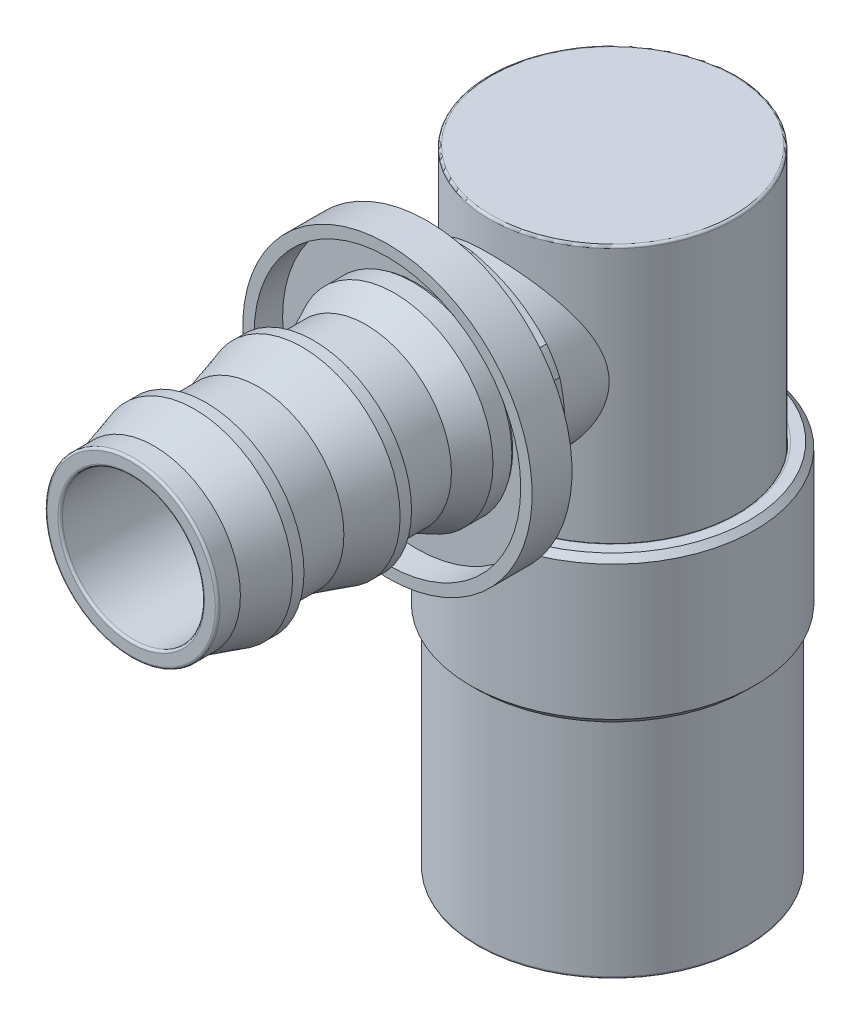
ISO-10303-21;
HEADER;
FILE_DESCRIPTION(('STEP AP214'),'2;1');
FILE_NAME('part.step','',(''),(''),'','','');
FILE_SCHEMA(('AUTOMOTIVE_DESIGN { 1 0 10303 214 1 1 1 1 }'));
ENDSEC;
DATA;
#1=APPLICATION_CONTEXT('core data for automotive mechanical design processes');
#2=APPLICATION_PROTOCOL_DEFINITION('international standard','automotive_design',2000,#1);
#3=PRODUCT_CONTEXT('',#1,'mechanical');
#4=PRODUCT('Part','Part','',(#3));
#5=PRODUCT_RELATED_PRODUCT_CATEGORY('part','',(#4));
#6=PRODUCT_DEFINITION_FORMATION('','',#4);
#7=PRODUCT_DEFINITION_CONTEXT('part definition',#1,'design');
#8=PRODUCT_DEFINITION('design','',#6,#7);
#9=PRODUCT_DEFINITION_SHAPE('','',#8);
#10=(LENGTH_UNIT() NAMED_UNIT(*) SI_UNIT(.MILLI.,.METRE.));
#11=(NAMED_UNIT(*) PLANE_ANGLE_UNIT() SI_UNIT($,.RADIAN.));
#12=(NAMED_UNIT(*) SI_UNIT($,.STERADIAN.) SOLID_ANGLE_UNIT());
#13=UNCERTAINTY_MEASURE_WITH_UNIT(LENGTH_MEASURE(1.E-05),#10,'distance_accuracy_value','');
#14=(GEOMETRIC_REPRESENTATION_CONTEXT(3) GLOBAL_UNCERTAINTY_ASSIGNED_CONTEXT((#13)) GLOBAL_UNIT_ASSIGNED_CONTEXT((#10,
#11,#12)) REPRESENTATION_CONTEXT('',''));
#15=CARTESIAN_POINT('',(0.,0.,0.));
#16=DIRECTION('',(0.,0.,1.));
#17=DIRECTION('',(1.,0.,0.));
#18=AXIS2_PLACEMENT_3D('',#15,#16,#17);
#19=CARTESIAN_POINT('',(0.,56.769,53.3908));
#20=DIRECTION('',(0.,0.,-1.));
#21=DIRECTION('',(0.,1.,0.));
#22=AXIS2_PLACEMENT_3D('',#19,#20,#21);
#23=TOROIDAL_SURFACE('',#22,9.37287245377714,0.254);
#24=CARTESIAN_POINT('',(0.,56.769,53.3908));
#25=DIRECTION('',(0.,0.,1.));
#26=DIRECTION('',(0.,-1.,0.));
#27=AXIS2_PLACEMENT_3D('',#24,#25,#26);
#28=CIRCLE('',#27,9.62687245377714);
#29=CARTESIAN_POINT('',(0.,66.3958724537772,53.3908));
#30=VERTEX_POINT('',#29);
#31=CARTESIAN_POINT('',(0.,47.1421275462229,53.3908));
#32=VERTEX_POINT('',#31);
#33=EDGE_CURVE('P0_E11',#30,#32,#28,.T.);
#34=ORIENTED_EDGE('',*,*,#33,.T.);
#35=CARTESIAN_POINT('',(0.,47.3961275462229,53.3908));
#36=DIRECTION('',(-1.,0.,0.));
#37=DIRECTION('',(0.,-1.,0.));
#38=AXIS2_PLACEMENT_3D('',#35,#36,#37);
#39=CIRCLE('',#38,0.254);
#40=CARTESIAN_POINT('',(0.,47.3961275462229,53.6448));
#41=VERTEX_POINT('',#40);
#42=EDGE_CURVE('P0_E27',#32,#41,#39,.T.);
#43=ORIENTED_EDGE('',*,*,#42,.T.);
#44=CARTESIAN_POINT('',(0.,56.769,53.6448));
#45=DIRECTION('',(0.,0.,-1.));
#46=DIRECTION('',(0.,-1.,0.));
#47=AXIS2_PLACEMENT_3D('',#44,#45,#46);
#48=CIRCLE('',#47,9.37287245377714);
#49=CARTESIAN_POINT('',(0.,66.1418724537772,53.6448));
#50=VERTEX_POINT('',#49);
#51=EDGE_CURVE('P0_E353',#41,#50,#48,.T.);
#52=ORIENTED_EDGE('',*,*,#51,.T.);
#53=CARTESIAN_POINT('',(0.,56.769,53.6448));
#54=DIRECTION('',(0.,0.,-1.));
#55=DIRECTION('',(0.,-1.,0.));
#56=AXIS2_PLACEMENT_3D('',#53,#54,#55);
#57=CIRCLE('',#56,9.37287245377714);
#58=EDGE_CURVE('P0_E349',#50,#41,#57,.T.);
#59=ORIENTED_EDGE('',*,*,#58,.T.);
#60=ORIENTED_EDGE('',*,*,#42,.F.);
#61=CARTESIAN_POINT('',(0.,56.769,53.3908));
#62=DIRECTION('',(0.,0.,1.));
#63=DIRECTION('',(0.,-1.,0.));
#64=AXIS2_PLACEMENT_3D('',#61,#62,#63);
#65=CIRCLE('',#64,9.62687245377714);
#66=EDGE_CURVE('P0_E41',#32,#30,#65,.T.);
#67=ORIENTED_EDGE('',*,*,#66,.T.);
#68=EDGE_LOOP('',(#34,#43,#52,#59,#60,#67));
#69=FACE_BOUND('',#68,.T.);
#70=ADVANCED_FACE('P0_F16',(#69),#23,.T.);
#71=CARTESIAN_POINT('',(0.,66.3958725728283,53.6448));
#72=DIRECTION('',(0.,0.,1.));
#73=DIRECTION('',(1.,0.,0.));
#74=AXIS2_PLACEMENT_3D('',#71,#72,#73);
#75=PLANE('',#74);
#76=ORIENTED_EDGE('',*,*,#58,.F.);
#77=ORIENTED_EDGE('',*,*,#51,.F.);
#78=EDGE_LOOP('',(#76,#77));
#79=FACE_BOUND('',#78,.T.);
#80=CARTESIAN_POINT('',(0.,56.769,53.6448));
#81=DIRECTION('',(0.,0.,1.));
#82=DIRECTION('',(0.,-1.,0.));
#83=AXIS2_PLACEMENT_3D('',#80,#81,#82);
#84=CIRCLE('',#83,8.1788);
#85=CARTESIAN_POINT('',(0.,64.9478,53.6448));
#86=VERTEX_POINT('',#85);
#87=CARTESIAN_POINT('',(0.,48.5902,53.6448));
#88=VERTEX_POINT('',#87);
#89=EDGE_CURVE('P0_E319',#86,#88,#84,.T.);
#90=ORIENTED_EDGE('',*,*,#89,.F.);
#91=CARTESIAN_POINT('',(0.,56.769,53.6448));
#92=DIRECTION('',(0.,0.,1.));
#93=DIRECTION('',(0.,-1.,0.));
#94=AXIS2_PLACEMENT_3D('',#91,#92,#93);
#95=CIRCLE('',#94,8.1788);
#96=EDGE_CURVE('P0_E365',#88,#86,#95,.T.);
#97=ORIENTED_EDGE('',*,*,#96,.F.);
#98=EDGE_LOOP('',(#90,#97));
#99=FACE_BOUND('',#98,.T.);
#100=ADVANCED_FACE('P0_F1299',(#79,#99),#75,.T.);
#101=CARTESIAN_POINT('',(0.,56.769,52.3748));
#102=DIRECTION('',(0.,0.,-1.));
#103=DIRECTION('',(0.,1.,0.));
#104=AXIS2_PLACEMENT_3D('',#101,#102,#103);
#105=CYLINDRICAL_SURFACE('',#104,9.62687245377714);
#106=CARTESIAN_POINT('',(0.,56.769,51.1048));
#107=DIRECTION('',(0.,0.,-1.));
#108=DIRECTION('',(1.,0.,0.));
#109=AXIS2_PLACEMENT_3D('',#106,#107,#108);
#110=CIRCLE('',#109,9.62687233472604);
#111=CARTESIAN_POINT('',(0.,66.3958723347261,51.1048));
#112=VERTEX_POINT('',#111);
#113=CARTESIAN_POINT('',(0.,47.1421275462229,51.1048));
#114=VERTEX_POINT('',#113);
#115=EDGE_CURVE('P0_E422',#112,#114,#110,.T.);
#116=ORIENTED_EDGE('',*,*,#115,.F.);
#117=CARTESIAN_POINT('',(0.,56.769,51.1048));
#118=DIRECTION('',(0.,0.,-1.));
#119=DIRECTION('',(1.,0.,0.));
#120=AXIS2_PLACEMENT_3D('',#117,#118,#119);
#121=CIRCLE('',#120,9.62687233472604);
#122=EDGE_CURVE('P0_E599',#114,#112,#121,.T.);
#123=ORIENTED_EDGE('',*,*,#122,.F.);
#124=DIRECTION('',(0.,0.,1.));
#125=VECTOR('',#124,1.);
#126=CARTESIAN_POINT('',(0.,47.1421275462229,52.3748));
#127=LINE('',#126,#125);
#128=EDGE_CURVE('P0_E315',#114,#32,#127,.T.);
#129=ORIENTED_EDGE('',*,*,#128,.T.);
#130=ORIENTED_EDGE('',*,*,#33,.F.);
#131=ORIENTED_EDGE('',*,*,#66,.F.);
#132=ORIENTED_EDGE('',*,*,#128,.F.);
#133=EDGE_LOOP('',(#116,#123,#129,#130,#131,#132));
#134=FACE_BOUND('',#133,.T.);
#135=ADVANCED_FACE('P0_F691',(#134),#105,.T.);
#136=CARTESIAN_POINT('',(0.,56.769,53.3908));
#137=DIRECTION('',(0.,0.,-1.));
#138=DIRECTION('',(0.,1.,0.));
#139=AXIS2_PLACEMENT_3D('',#136,#137,#138);
#140=TOROIDAL_SURFACE('',#139,8.1788,0.254);
#141=ORIENTED_EDGE('',*,*,#89,.T.);
#142=CARTESIAN_POINT('',(0.,48.5902,53.3908));
#143=DIRECTION('',(-1.,0.,0.));
#144=DIRECTION('',(0.,-1.,0.));
#145=AXIS2_PLACEMENT_3D('',#142,#143,#144);
#146=CIRCLE('',#145,0.254);
#147=CARTESIAN_POINT('',(0.,48.8442,53.3908));
#148=VERTEX_POINT('',#147);
#149=EDGE_CURVE('P0_E330',#88,#148,#146,.T.);
#150=ORIENTED_EDGE('',*,*,#149,.T.);
#151=CARTESIAN_POINT('',(0.,56.769,53.3908));
#152=DIRECTION('',(0.,0.,-1.));
#153=DIRECTION('',(0.,-1.,0.));
#154=AXIS2_PLACEMENT_3D('',#151,#152,#153);
#155=CIRCLE('',#154,7.9248);
#156=CARTESIAN_POINT('',(0.,64.6938,53.3908));
#157=VERTEX_POINT('',#156);
#158=EDGE_CURVE('P0_E334',#148,#157,#155,.T.);
#159=ORIENTED_EDGE('',*,*,#158,.T.);
#160=CARTESIAN_POINT('',(0.,56.769,53.3908));
#161=DIRECTION('',(0.,0.,-1.));
#162=DIRECTION('',(0.,-1.,0.));
#163=AXIS2_PLACEMENT_3D('',#160,#161,#162);
#164=CIRCLE('',#163,7.9248);
#165=EDGE_CURVE('P0_E358',#157,#148,#164,.T.);
#166=ORIENTED_EDGE('',*,*,#165,.T.);
#167=ORIENTED_EDGE('',*,*,#149,.F.);
#168=ORIENTED_EDGE('',*,*,#96,.T.);
#169=EDGE_LOOP('',(#141,#150,#159,#166,#167,#168));
#170=FACE_BOUND('',#169,.T.);
#171=ADVANCED_FACE('P0_F1280',(#170),#140,.T.);
#172=CARTESIAN_POINT('',(0.,56.769,30.6324));
#173=DIRECTION('',(0.,0.,-1.));
#174=DIRECTION('',(0.,1.,0.));
#175=AXIS2_PLACEMENT_3D('',#172,#173,#174);
#176=CYLINDRICAL_SURFACE('',#175,7.9248);
#177=CARTESIAN_POINT('',(0.,56.769,7.874));
#178=DIRECTION('',(0.,0.,1.));
#179=DIRECTION('',(0.,-1.,0.));
#180=AXIS2_PLACEMENT_3D('',#177,#178,#179);
#181=CIRCLE('',#180,7.9248);
#182=CARTESIAN_POINT('',(0.,64.6938,7.874));
#183=VERTEX_POINT('',#182);
#184=CARTESIAN_POINT('',(0.,48.8442,7.874));
#185=VERTEX_POINT('',#184);
#186=EDGE_CURVE('P0_E388',#183,#185,#181,.T.);
#187=ORIENTED_EDGE('',*,*,#186,.F.);
#188=CARTESIAN_POINT('',(0.,56.769,7.874));
#189=DIRECTION('',(0.,0.,1.));
#190=DIRECTION('',(0.,-1.,0.));
#191=AXIS2_PLACEMENT_3D('',#188,#189,#190);
#192=CIRCLE('',#191,7.9248);
#193=EDGE_CURVE('P0_E508',#185,#183,#192,.T.);
#194=ORIENTED_EDGE('',*,*,#193,.F.);
#195=DIRECTION('',(0.,0.,1.));
#196=VECTOR('',#195,1.);
#197=CARTESIAN_POINT('',(0.,48.8442,30.6324));
#198=LINE('',#197,#196);
#199=EDGE_CURVE('P0_E500',#185,#148,#198,.T.);
#200=ORIENTED_EDGE('',*,*,#199,.T.);
#201=ORIENTED_EDGE('',*,*,#165,.F.);
#202=ORIENTED_EDGE('',*,*,#158,.F.);
#203=ORIENTED_EDGE('',*,*,#199,.F.);
#204=EDGE_LOOP('',(#187,#194,#200,#201,#202,#203));
#205=FACE_BOUND('',#204,.T.);
#206=ADVANCED_FACE('P0_F1270',(#205),#176,.F.);
#207=CARTESIAN_POINT('',(0.,56.769,7.874));
#208=DIRECTION('',(0.,0.,-1.));
#209=DIRECTION('',(0.,1.,0.));
#210=AXIS2_PLACEMENT_3D('',#207,#208,#209);
#211=TOROIDAL_SURFACE('',#210,8.1788,0.254);
#212=ORIENTED_EDGE('',*,*,#186,.T.);
#213=CARTESIAN_POINT('',(0.,48.5902,7.874));
#214=DIRECTION('',(-1.,0.,0.));
#215=DIRECTION('',(0.,-1.,0.));
#216=AXIS2_PLACEMENT_3D('',#213,#214,#215);
#217=CIRCLE('',#216,0.254);
#218=CARTESIAN_POINT('',(0.,48.5902,7.62));
#219=VERTEX_POINT('',#218);
#220=EDGE_CURVE('P0_E384',#185,#219,#217,.T.);
#221=ORIENTED_EDGE('',*,*,#220,.T.);
#222=CARTESIAN_POINT('',(0.,56.769,7.62));
#223=DIRECTION('',(0.,0.,-1.));
#224=DIRECTION('',(0.,-1.,0.));
#225=AXIS2_PLACEMENT_3D('',#222,#223,#224);
#226=CIRCLE('',#225,8.1788);
#227=CARTESIAN_POINT('',(0.,64.9478,7.62));
#228=VERTEX_POINT('',#227);
#229=EDGE_CURVE('P0_E389',#219,#228,#226,.T.);
#230=ORIENTED_EDGE('',*,*,#229,.T.);
#231=CARTESIAN_POINT('',(0.,56.769,7.62));
#232=DIRECTION('',(0.,0.,-1.));
#233=DIRECTION('',(0.,-1.,0.));
#234=AXIS2_PLACEMENT_3D('',#231,#232,#233);
#235=CIRCLE('',#234,8.1788);
#236=EDGE_CURVE('P0_E512',#228,#219,#235,.T.);
#237=ORIENTED_EDGE('',*,*,#236,.T.);
#238=ORIENTED_EDGE('',*,*,#220,.F.);
#239=ORIENTED_EDGE('',*,*,#193,.T.);
#240=EDGE_LOOP('',(#212,#221,#230,#237,#238,#239));
#241=FACE_BOUND('',#240,.T.);
#242=ADVANCED_FACE('P0_F1260',(#241),#211,.T.);
#243=CARTESIAN_POINT('',(0.,64.6938,7.62));
#244=DIRECTION('',(0.,0.,-1.));
#245=DIRECTION('',(0.,1.,0.));
#246=AXIS2_PLACEMENT_3D('',#243,#244,#245);
#247=PLANE('',#246);
#248=CARTESIAN_POINT('',(0.,56.769,7.62));
#249=DIRECTION('',(0.,0.,1.));
#250=DIRECTION('',(0.,-1.,0.));
#251=AXIS2_PLACEMENT_3D('',#248,#249,#250);
#252=CIRCLE('',#251,8.509);
#253=CARTESIAN_POINT('',(0.,65.278,7.62));
#254=VERTEX_POINT('',#253);
#255=EDGE_CURVE('P0_E394',#254,#254,#252,.T.);
#256=ORIENTED_EDGE('',*,*,#255,.F.);
#257=EDGE_LOOP('',(#256));
#258=FACE_BOUND('',#257,.T.);
#259=ORIENTED_EDGE('',*,*,#236,.F.);
#260=ORIENTED_EDGE('',*,*,#229,.F.);
#261=EDGE_LOOP('',(#259,#260));
#262=FACE_BOUND('',#261,.T.);
#263=ADVANCED_FACE('P0_F1250',(#258,#262),#247,.T.);
#264=CARTESIAN_POINT('',(0.,56.769,8.128));
#265=DIRECTION('',(0.,0.,1.));
#266=DIRECTION('',(0.,-1.,0.));
#267=AXIS2_PLACEMENT_3D('',#264,#265,#266);
#268=CONICAL_SURFACE('',#267,9.017,0.785398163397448);
#269=ORIENTED_EDGE('',*,*,#255,.T.);
#270=DIRECTION('',(0.,0.707106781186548,0.707106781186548));
#271=VECTOR('',#270,1.);
#272=CARTESIAN_POINT('',(0.,65.786,8.128));
#273=LINE('',#272,#271);
#274=CARTESIAN_POINT('',(0.,66.25336,8.59536));
#275=VERTEX_POINT('',#274);
#276=EDGE_CURVE('P0_E390',#254,#275,#273,.T.);
#277=ORIENTED_EDGE('',*,*,#276,.T.);
#278=CARTESIAN_POINT('',(0.,56.769,8.59536));
#279=DIRECTION('',(0.,0.,-1.));
#280=DIRECTION('',(0.,1.,0.));
#281=AXIS2_PLACEMENT_3D('',#278,#279,#280);
#282=CIRCLE('',#281,9.48436);
#283=CARTESIAN_POINT('',(0.,47.28464,8.59536));
#284=VERTEX_POINT('',#283);
#285=EDGE_CURVE('P0_E370',#275,#284,#282,.T.);
#286=ORIENTED_EDGE('',*,*,#285,.T.);
#287=CARTESIAN_POINT('',(0.,56.769,8.59536));
#288=DIRECTION('',(0.,0.,-1.));
#289=DIRECTION('',(0.,1.,0.));
#290=AXIS2_PLACEMENT_3D('',#287,#288,#289);
#291=CIRCLE('',#290,9.48436);
#292=EDGE_CURVE('P0_E366',#284,#275,#291,.T.);
#293=ORIENTED_EDGE('',*,*,#292,.T.);
#294=ORIENTED_EDGE('',*,*,#276,.F.);
#295=EDGE_LOOP('',(#269,#277,#286,#293,#294));
#296=FACE_BOUND('',#295,.T.);
#297=ADVANCED_FACE('P0_F1239',(#296),#268,.T.);
#298=CARTESIAN_POINT('',(0.,56.769,11.9761));
#299=DIRECTION('',(0.,0.,-1.));
#300=DIRECTION('',(0.,1.,0.));
#301=AXIS2_PLACEMENT_3D('',#298,#299,#300);
#302=CYLINDRICAL_SURFACE('',#301,9.48436);
#303=ORIENTED_EDGE('',*,*,#292,.F.);
#304=DIRECTION('',(0.,0.,1.));
#305=VECTOR('',#304,1.);
#306=CARTESIAN_POINT('',(0.,47.28464,11.9761));
#307=LINE('',#306,#305);
#308=CARTESIAN_POINT('',(0.,47.28464,16.3322));
#309=VERTEX_POINT('',#308);
#310=EDGE_CURVE('P0_E371',#284,#309,#307,.T.);
#311=ORIENTED_EDGE('',*,*,#310,.T.);
#312=CARTESIAN_POINT('',(0.,56.769,16.3322));
#313=DIRECTION('',(0.,0.,-1.));
#314=DIRECTION('',(0.,1.,0.));
#315=AXIS2_PLACEMENT_3D('',#312,#313,#314);
#316=CIRCLE('',#315,9.48436);
#317=EDGE_CURVE('P0_E411',#309,#309,#316,.T.);
#318=ORIENTED_EDGE('',*,*,#317,.T.);
#319=ORIENTED_EDGE('',*,*,#310,.F.);
#320=ORIENTED_EDGE('',*,*,#285,.F.);
#321=EDGE_LOOP('',(#303,#311,#318,#319,#320));
#322=FACE_BOUND('',#321,.T.);
#323=ADVANCED_FACE('P0_F1230',(#322),#302,.T.);
#324=CARTESIAN_POINT('',(0.,43.952054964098,7.62));
#325=DIRECTION('',(0.5,0.866025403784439,0.));
#326=DIRECTION('',(0.,0.,-1.));
#327=AXIS2_PLACEMENT_3D('',#324,#325,#326);
#328=PLANE('',#327);
#329=CARTESIAN_POINT('',(-1.45490320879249,44.7920437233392,16.9921113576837));
#330=CARTESIAN_POINT('',(-5.5499,47.1562912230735,15.9221750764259));
#331=CARTESIAN_POINT('',(-9.64489679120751,49.5205387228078,16.9921113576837));
#332=(BOUNDED_CURVE() B_SPLINE_CURVE(2,(#329,#330,#331),.UNSPECIFIED.,.F.,
.F.) B_SPLINE_CURVE_WITH_KNOTS((3,3),(0.,0.952243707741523),
.UNSPECIFIED.) CURVE() GEOMETRIC_REPRESENTATION_ITEM() RATIONAL_B_SPLINE_CURVE((1.,
1.08695652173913,1.)) REPRESENTATION_ITEM(''));
#333=CARTESIAN_POINT('',(-1.45490320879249,44.7920437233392,16.9921113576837));
#334=VERTEX_POINT('',#333);
#335=CARTESIAN_POINT('',(-9.64489679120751,49.5205387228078,16.9921113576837));
#336=VERTEX_POINT('',#335);
#337=EDGE_CURVE('P0_E66',#334,#336,#332,.T.);
#338=ORIENTED_EDGE('',*,*,#337,.F.);
#339=DIRECTION('',(0.,0.,-1.));
#340=VECTOR('',#339,1.);
#341=CARTESIAN_POINT('',(-1.45490320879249,44.7920437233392,18.4912));
#342=LINE('',#341,#340);
#343=CARTESIAN_POINT('',(-1.45490320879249,44.7920437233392,20.0152));
#344=VERTEX_POINT('',#343);
#345=EDGE_CURVE('P0_E78',#344,#334,#342,.T.);
#346=ORIENTED_EDGE('',*,*,#345,.F.);
#347=CARTESIAN_POINT('',(-9.64489679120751,49.5205387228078,20.0152));
#348=CARTESIAN_POINT('',(-5.5499,47.1562912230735,21.0851362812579));
#349=CARTESIAN_POINT('',(-1.4549032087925,44.7920437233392,20.0152));
#350=(BOUNDED_CURVE() B_SPLINE_CURVE(2,(#347,#348,#349),.UNSPECIFIED.,.F.,
.F.) B_SPLINE_CURVE_WITH_KNOTS((3,3),(0.,0.952243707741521),
.UNSPECIFIED.) CURVE() GEOMETRIC_REPRESENTATION_ITEM() RATIONAL_B_SPLINE_CURVE((1.,
1.08695652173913,1.)) REPRESENTATION_ITEM(''));
#351=CARTESIAN_POINT('',(-9.64489679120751,49.5205387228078,20.0152));
#352=VERTEX_POINT('',#351);
#353=EDGE_CURVE('P0_E403',#352,#344,#350,.T.);
#354=ORIENTED_EDGE('',*,*,#353,.F.);
#355=DIRECTION('',(0.,0.,1.));
#356=VECTOR('',#355,1.);
#357=CARTESIAN_POINT('',(-9.64489679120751,49.5205387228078,18.4912));
#358=LINE('',#357,#356);
#359=EDGE_CURVE('P0_E335',#336,#352,#358,.T.);
#360=ORIENTED_EDGE('',*,*,#359,.F.);
#361=EDGE_LOOP('',(#338,#346,#354,#360));
#362=FACE_BOUND('',#361,.T.);
#363=ADVANCED_FACE('P0_F1221',(#362),#328,.F.);
#364=CARTESIAN_POINT('',(11.0998,50.360527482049,7.62));
#365=DIRECTION('',(-0.5,0.866025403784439,0.));
#366=DIRECTION('',(-0.866025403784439,-0.5,0.));
#367=AXIS2_PLACEMENT_3D('',#364,#365,#366);
#368=PLANE('',#367);
#369=CARTESIAN_POINT('',(9.64489679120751,49.5205387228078,16.9921113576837));
#370=CARTESIAN_POINT('',(5.5499,47.1562912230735,15.9221750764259));
#371=CARTESIAN_POINT('',(1.45490320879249,44.7920437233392,16.9921113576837));
#372=(BOUNDED_CURVE() B_SPLINE_CURVE(2,(#369,#370,#371),.UNSPECIFIED.,.F.,
.F.) B_SPLINE_CURVE_WITH_KNOTS((3,3),(0.,0.952243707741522),
.UNSPECIFIED.) CURVE() GEOMETRIC_REPRESENTATION_ITEM() RATIONAL_B_SPLINE_CURVE((1.,
1.08695652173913,1.)) REPRESENTATION_ITEM(''));
#373=CARTESIAN_POINT('',(9.64489679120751,49.5205387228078,16.9921113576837));
#374=VERTEX_POINT('',#373);
#375=CARTESIAN_POINT('',(1.45490320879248,44.7920437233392,16.9921113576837));
#376=VERTEX_POINT('',#375);
#377=EDGE_CURVE('P0_E270',#374,#376,#372,.T.);
#378=ORIENTED_EDGE('',*,*,#377,.F.);
#379=DIRECTION('',(0.,0.,-1.));
#380=VECTOR('',#379,1.);
#381=CARTESIAN_POINT('',(9.64489679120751,49.5205387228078,18.4912));
#382=LINE('',#381,#380);
#383=CARTESIAN_POINT('',(9.64489679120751,49.5205387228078,20.0152));
#384=VERTEX_POINT('',#383);
#385=EDGE_CURVE('P0_E465',#384,#374,#382,.T.);
#386=ORIENTED_EDGE('',*,*,#385,.F.);
#387=CARTESIAN_POINT('',(1.45490320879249,44.7920437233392,20.0152));
#388=CARTESIAN_POINT('',(5.5499,47.1562912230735,21.0851362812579));
#389=CARTESIAN_POINT('',(9.64489679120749,49.5205387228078,20.0152));
#390=(BOUNDED_CURVE() B_SPLINE_CURVE(2,(#387,#388,#389),.UNSPECIFIED.,.F.,
.F.) B_SPLINE_CURVE_WITH_KNOTS((3,3),(0.,0.952243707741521),
.UNSPECIFIED.) CURVE() GEOMETRIC_REPRESENTATION_ITEM() RATIONAL_B_SPLINE_CURVE((1.,
1.08695652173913,1.)) REPRESENTATION_ITEM(''));
#391=CARTESIAN_POINT('',(1.45490320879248,44.7920437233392,20.0152));
#392=VERTEX_POINT('',#391);
#393=EDGE_CURVE('P0_E347',#392,#384,#390,.T.);
#394=ORIENTED_EDGE('',*,*,#393,.F.);
#395=DIRECTION('',(0.,0.,1.));
#396=VECTOR('',#395,1.);
#397=CARTESIAN_POINT('',(1.45490320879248,44.7920437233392,18.4912));
#398=LINE('',#397,#396);
#399=EDGE_CURVE('P0_E574',#376,#392,#398,.T.);
#400=ORIENTED_EDGE('',*,*,#399,.F.);
#401=EDGE_LOOP('',(#378,#386,#394,#400));
#402=FACE_BOUND('',#401,.T.);
#403=ADVANCED_FACE('P0_F649',(#402),#368,.F.);
#404=CARTESIAN_POINT('',(11.0998,63.177472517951,7.62));
#405=DIRECTION('',(-1.,0.,0.));
#406=DIRECTION('',(0.,-1.,0.));
#407=AXIS2_PLACEMENT_3D('',#404,#405,#406);
#408=PLANE('',#407);
#409=CARTESIAN_POINT('',(11.0998,61.4974949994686,16.9921113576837));
#410=CARTESIAN_POINT('',(11.0998,56.769,15.9221750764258));
#411=CARTESIAN_POINT('',(11.0998,52.0405050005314,16.9921113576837));
#412=(BOUNDED_CURVE() B_SPLINE_CURVE(2,(#409,#410,#411),.UNSPECIFIED.,.F.,
.F.) B_SPLINE_CURVE_WITH_KNOTS((3,3),(0.,0.952243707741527),
.UNSPECIFIED.) CURVE() GEOMETRIC_REPRESENTATION_ITEM() RATIONAL_B_SPLINE_CURVE((1.,
1.08695652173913,1.)) REPRESENTATION_ITEM(''));
#413=CARTESIAN_POINT('',(11.0998,61.4974949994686,16.9921113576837));
#414=VERTEX_POINT('',#413);
#415=CARTESIAN_POINT('',(11.0998,52.0405050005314,16.9921113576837));
#416=VERTEX_POINT('',#415);
#417=EDGE_CURVE('P0_E269',#414,#416,#412,.T.);
#418=ORIENTED_EDGE('',*,*,#417,.F.);
#419=DIRECTION('',(0.,0.,-1.));
#420=VECTOR('',#419,1.);
#421=CARTESIAN_POINT('',(11.0998,61.4974949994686,18.4912));
#422=LINE('',#421,#420);
#423=CARTESIAN_POINT('',(11.0998,61.4974949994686,20.0152));
#424=VERTEX_POINT('',#423);
#425=EDGE_CURVE('P0_E276',#424,#414,#422,.T.);
#426=ORIENTED_EDGE('',*,*,#425,.F.);
#427=CARTESIAN_POINT('',(11.0998,52.0405050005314,20.0152));
#428=CARTESIAN_POINT('',(11.0998,56.769,21.0851362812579));
#429=CARTESIAN_POINT('',(11.0998,61.4974949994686,20.0152));
#430=(BOUNDED_CURVE() B_SPLINE_CURVE(2,(#427,#428,#429),.UNSPECIFIED.,.F.,
.F.) B_SPLINE_CURVE_WITH_KNOTS((3,3),(0.,0.952243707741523),
.UNSPECIFIED.) CURVE() GEOMETRIC_REPRESENTATION_ITEM() RATIONAL_B_SPLINE_CURVE((1.,
1.08695652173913,1.)) REPRESENTATION_ITEM(''));
#431=CARTESIAN_POINT('',(11.0998,52.0405050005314,20.0152));
#432=VERTEX_POINT('',#431);
#433=EDGE_CURVE('P0_E348',#432,#424,#430,.T.);
#434=ORIENTED_EDGE('',*,*,#433,.F.);
#435=DIRECTION('',(0.,0.,1.));
#436=VECTOR('',#435,1.);
#437=CARTESIAN_POINT('',(11.0998,52.0405050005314,18.4912));
#438=LINE('',#437,#436);
#439=EDGE_CURVE('P0_E461',#416,#432,#438,.T.);
#440=ORIENTED_EDGE('',*,*,#439,.F.);
#441=EDGE_LOOP('',(#418,#426,#434,#440));
#442=FACE_BOUND('',#441,.T.);
#443=ADVANCED_FACE('P0_F1202',(#442),#408,.F.);
#444=CARTESIAN_POINT('',(0.,69.585945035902,7.62));
#445=DIRECTION('',(-0.5,-0.866025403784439,0.));
#446=DIRECTION('',(0.,0.,1.));
#447=AXIS2_PLACEMENT_3D('',#444,#445,#446);
#448=PLANE('',#447);
#449=CARTESIAN_POINT('',(1.45490320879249,68.7459562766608,16.9921113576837));
#450=CARTESIAN_POINT('',(5.5499,66.3817087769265,15.9221750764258));
#451=CARTESIAN_POINT('',(9.64489679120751,64.0174612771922,16.9921113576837));
#452=(BOUNDED_CURVE() B_SPLINE_CURVE(2,(#449,#450,#451),.UNSPECIFIED.,.F.,
.F.) B_SPLINE_CURVE_WITH_KNOTS((3,3),(0.,0.952243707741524),
.UNSPECIFIED.) CURVE() GEOMETRIC_REPRESENTATION_ITEM() RATIONAL_B_SPLINE_CURVE((1.,
1.08695652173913,1.)) REPRESENTATION_ITEM(''));
#453=CARTESIAN_POINT('',(1.45490320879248,68.7459562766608,16.9921113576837));
#454=VERTEX_POINT('',#453);
#455=CARTESIAN_POINT('',(9.64489679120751,64.0174612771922,16.9921113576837));
#456=VERTEX_POINT('',#455);
#457=EDGE_CURVE('P0_E324',#454,#456,#452,.T.);
#458=ORIENTED_EDGE('',*,*,#457,.F.);
#459=DIRECTION('',(0.,0.,-1.));
#460=VECTOR('',#459,1.);
#461=CARTESIAN_POINT('',(1.45490320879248,68.7459562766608,18.4912));
#462=LINE('',#461,#460);
#463=CARTESIAN_POINT('',(1.45490320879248,68.7459562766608,20.0152));
#464=VERTEX_POINT('',#463);
#465=EDGE_CURVE('P0_E275',#464,#454,#462,.T.);
#466=ORIENTED_EDGE('',*,*,#465,.F.);
#467=CARTESIAN_POINT('',(9.64489679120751,64.0174612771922,20.0152));
#468=CARTESIAN_POINT('',(5.5499,66.3817087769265,21.0851362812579));
#469=CARTESIAN_POINT('',(1.4549032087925,68.7459562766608,20.0152));
#470=(BOUNDED_CURVE() B_SPLINE_CURVE(2,(#467,#468,#469),.UNSPECIFIED.,.F.,
.F.) B_SPLINE_CURVE_WITH_KNOTS((3,3),(0.,0.952243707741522),
.UNSPECIFIED.) CURVE() GEOMETRIC_REPRESENTATION_ITEM() RATIONAL_B_SPLINE_CURVE((1.,
1.08695652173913,1.)) REPRESENTATION_ITEM(''));
#471=CARTESIAN_POINT('',(9.64489679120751,64.0174612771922,20.0152));
#472=VERTEX_POINT('',#471);
#473=EDGE_CURVE('P0_E301',#472,#464,#470,.T.);
#474=ORIENTED_EDGE('',*,*,#473,.F.);
#475=DIRECTION('',(0.,0.,1.));
#476=VECTOR('',#475,1.);
#477=CARTESIAN_POINT('',(9.64489679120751,64.0174612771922,18.4912));
#478=LINE('',#477,#476);
#479=EDGE_CURVE('P0_E441',#456,#472,#478,.T.);
#480=ORIENTED_EDGE('',*,*,#479,.F.);
#481=EDGE_LOOP('',(#458,#466,#474,#480));
#482=FACE_BOUND('',#481,.T.);
#483=ADVANCED_FACE('P0_F1192',(#482),#448,.F.);
#484=CARTESIAN_POINT('',(-11.0998,63.177472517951,7.62));
#485=DIRECTION('',(0.5,-0.866025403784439,0.));
#486=DIRECTION('',(0.,0.,-1.));
#487=AXIS2_PLACEMENT_3D('',#484,#485,#486);
#488=PLANE('',#487);
#489=CARTESIAN_POINT('',(-9.64489679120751,64.0174612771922,16.9921113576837));
#490=CARTESIAN_POINT('',(-5.5499,66.3817087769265,15.9221750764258));
#491=CARTESIAN_POINT('',(-1.45490320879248,68.7459562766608,16.9921113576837));
#492=(BOUNDED_CURVE() B_SPLINE_CURVE(2,(#489,#490,#491),.UNSPECIFIED.,.F.,
.F.) B_SPLINE_CURVE_WITH_KNOTS((3,3),(0.,0.952243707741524),
.UNSPECIFIED.) CURVE() GEOMETRIC_REPRESENTATION_ITEM() RATIONAL_B_SPLINE_CURVE((1.,
1.08695652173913,1.)) REPRESENTATION_ITEM(''));
#493=CARTESIAN_POINT('',(-9.64489679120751,64.0174612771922,16.9921113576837));
#494=VERTEX_POINT('',#493);
#495=CARTESIAN_POINT('',(-1.45490320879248,68.7459562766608,16.9921113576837));
#496=VERTEX_POINT('',#495);
#497=EDGE_CURVE('P0_E455',#494,#496,#492,.T.);
#498=ORIENTED_EDGE('',*,*,#497,.F.);
#499=DIRECTION('',(0.,0.,-1.));
#500=VECTOR('',#499,1.);
#501=CARTESIAN_POINT('',(-9.64489679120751,64.0174612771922,18.4912));
#502=LINE('',#501,#500);
#503=CARTESIAN_POINT('',(-9.64489679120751,64.0174612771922,20.0152));
#504=VERTEX_POINT('',#503);
#505=EDGE_CURVE('P0_E20',#504,#494,#502,.T.);
#506=ORIENTED_EDGE('',*,*,#505,.F.);
#507=CARTESIAN_POINT('',(-1.45490320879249,68.7459562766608,20.0152));
#508=CARTESIAN_POINT('',(-5.5499,66.3817087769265,21.0851362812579));
#509=CARTESIAN_POINT('',(-9.64489679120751,64.0174612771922,20.0152));
#510=(BOUNDED_CURVE() B_SPLINE_CURVE(2,(#507,#508,#509),.UNSPECIFIED.,.F.,
.F.) B_SPLINE_CURVE_WITH_KNOTS((3,3),(0.,0.952243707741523),
.UNSPECIFIED.) CURVE() GEOMETRIC_REPRESENTATION_ITEM() RATIONAL_B_SPLINE_CURVE((1.,
1.08695652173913,1.)) REPRESENTATION_ITEM(''));
#511=CARTESIAN_POINT('',(-1.45490320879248,68.7459562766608,20.0152));
#512=VERTEX_POINT('',#511);
#513=EDGE_CURVE('P0_E376',#512,#504,#510,.T.);
#514=ORIENTED_EDGE('',*,*,#513,.F.);
#515=DIRECTION('',(0.,0.,1.));
#516=VECTOR('',#515,1.);
#517=CARTESIAN_POINT('',(-1.45490320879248,68.7459562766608,18.4912));
#518=LINE('',#517,#516);
#519=EDGE_CURVE('P0_E271',#496,#512,#518,.T.);
#520=ORIENTED_EDGE('',*,*,#519,.F.);
#521=EDGE_LOOP('',(#498,#506,#514,#520));
#522=FACE_BOUND('',#521,.T.);
#523=ADVANCED_FACE('P0_F1181',(#522),#488,.F.);
#524=CARTESIAN_POINT('',(-11.0998,50.360527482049,7.62));
#525=DIRECTION('',(1.,0.,0.));
#526=DIRECTION('',(0.,0.,1.));
#527=AXIS2_PLACEMENT_3D('',#524,#525,#526);
#528=PLANE('',#527);
#529=CARTESIAN_POINT('',(-11.0998,52.0405050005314,16.9921113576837));
#530=CARTESIAN_POINT('',(-11.0998,56.769,15.9221750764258));
#531=CARTESIAN_POINT('',(-11.0998,61.4974949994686,16.9921113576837));
#532=(BOUNDED_CURVE() B_SPLINE_CURVE(2,(#529,#530,#531),.UNSPECIFIED.,.F.,
.F.) B_SPLINE_CURVE_WITH_KNOTS((3,3),(0.,0.952243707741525),
.UNSPECIFIED.) CURVE() GEOMETRIC_REPRESENTATION_ITEM() RATIONAL_B_SPLINE_CURVE((1.,
1.08695652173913,1.)) REPRESENTATION_ITEM(''));
#533=CARTESIAN_POINT('',(-11.0998,52.0405050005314,16.9921113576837));
#534=VERTEX_POINT('',#533);
#535=CARTESIAN_POINT('',(-11.0998,61.4974949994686,16.9921113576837));
#536=VERTEX_POINT('',#535);
#537=EDGE_CURVE('P0_E395',#534,#536,#532,.T.);
#538=ORIENTED_EDGE('',*,*,#537,.F.);
#539=DIRECTION('',(0.,0.,-1.));
#540=VECTOR('',#539,1.);
#541=CARTESIAN_POINT('',(-11.0998,52.0405050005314,18.4912));
#542=LINE('',#541,#540);
#543=CARTESIAN_POINT('',(-11.0998,52.0405050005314,20.0152));
#544=VERTEX_POINT('',#543);
#545=EDGE_CURVE('P0_E237',#544,#534,#542,.T.);
#546=ORIENTED_EDGE('',*,*,#545,.F.);
#547=CARTESIAN_POINT('',(-11.0998,61.4974949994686,20.0152));
#548=CARTESIAN_POINT('',(-11.0998,56.769,21.0851362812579));
#549=CARTESIAN_POINT('',(-11.0998,52.0405050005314,20.0152));
#550=(BOUNDED_CURVE() B_SPLINE_CURVE(2,(#547,#548,#549),.UNSPECIFIED.,.F.,
.F.) B_SPLINE_CURVE_WITH_KNOTS((3,3),(0.,0.952243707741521),
.UNSPECIFIED.) CURVE() GEOMETRIC_REPRESENTATION_ITEM() RATIONAL_B_SPLINE_CURVE((1.,
1.08695652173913,1.)) REPRESENTATION_ITEM(''));
#551=CARTESIAN_POINT('',(-11.0998,61.4974949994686,20.0152));
#552=VERTEX_POINT('',#551);
#553=EDGE_CURVE('P0_E377',#552,#544,#550,.T.);
#554=ORIENTED_EDGE('',*,*,#553,.F.);
#555=DIRECTION('',(0.,0.,1.));
#556=VECTOR('',#555,1.);
#557=CARTESIAN_POINT('',(-11.0998,61.4974949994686,18.4912));
#558=LINE('',#557,#556);
#559=EDGE_CURVE('P0_E342',#536,#552,#558,.T.);
#560=ORIENTED_EDGE('',*,*,#559,.F.);
#561=EDGE_LOOP('',(#538,#546,#554,#560));
#562=FACE_BOUND('',#561,.T.);
#563=ADVANCED_FACE('P0_F1170',(#562),#528,.F.);
#564=CARTESIAN_POINT('',(0.,56.769,20.3327));
#565=DIRECTION('',(0.,0.,-1.));
#566=DIRECTION('',(0.,-1.,0.));
#567=AXIS2_PLACEMENT_3D('',#564,#565,#566);
#568=CONICAL_SURFACE('',#567,11.5150738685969,1.0471975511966);
#569=ORIENTED_EDGE('',*,*,#353,.T.);
#570=CARTESIAN_POINT('',(0.,56.769,20.0152));
#571=DIRECTION('',(0.,0.,1.));
#572=DIRECTION('',(0.,-1.,0.));
#573=AXIS2_PLACEMENT_3D('',#570,#571,#572);
#574=CIRCLE('',#573,12.065);
#575=EDGE_CURVE('P0_E412',#344,#392,#574,.T.);
#576=ORIENTED_EDGE('',*,*,#575,.T.);
#577=ORIENTED_EDGE('',*,*,#393,.T.);
#578=CARTESIAN_POINT('',(0.,56.769,20.0152));
#579=DIRECTION('',(0.,0.,1.));
#580=DIRECTION('',(0.,-1.,0.));
#581=AXIS2_PLACEMENT_3D('',#578,#579,#580);
#582=CIRCLE('',#581,12.065);
#583=EDGE_CURVE('P0_E343',#384,#432,#582,.T.);
#584=ORIENTED_EDGE('',*,*,#583,.T.);
#585=ORIENTED_EDGE('',*,*,#433,.T.);
#586=CARTESIAN_POINT('',(0.,56.769,20.0152));
#587=DIRECTION('',(0.,0.,1.));
#588=DIRECTION('',(0.,-1.,0.));
#589=AXIS2_PLACEMENT_3D('',#586,#587,#588);
#590=CIRCLE('',#589,12.065);
#591=EDGE_CURVE('P0_E307',#424,#472,#590,.T.);
#592=ORIENTED_EDGE('',*,*,#591,.T.);
#593=ORIENTED_EDGE('',*,*,#473,.T.);
#594=CARTESIAN_POINT('',(0.,56.769,20.0152));
#595=DIRECTION('',(0.,0.,1.));
#596=DIRECTION('',(0.,-1.,0.));
#597=AXIS2_PLACEMENT_3D('',#594,#595,#596);
#598=CIRCLE('',#597,12.065);
#599=CARTESIAN_POINT('',(0.,68.834,20.0152));
#600=VERTEX_POINT('',#599);
#601=EDGE_CURVE('P0_E308',#464,#600,#598,.T.);
#602=ORIENTED_EDGE('',*,*,#601,.T.);
#603=DIRECTION('',(0.,-0.866025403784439,0.5));
#604=VECTOR('',#603,1.);
#605=CARTESIAN_POINT('',(0.,68.2840738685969,20.3327));
#606=LINE('',#605,#604);
#607=CARTESIAN_POINT('',(0.,67.7341477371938,20.6502));
#608=VERTEX_POINT('',#607);
#609=EDGE_CURVE('P0_E281',#600,#608,#606,.T.);
#610=ORIENTED_EDGE('',*,*,#609,.T.);
#611=CARTESIAN_POINT('',(0.,56.769,20.6502));
#612=DIRECTION('',(0.,0.,-1.));
#613=DIRECTION('',(0.,-1.,0.));
#614=AXIS2_PLACEMENT_3D('',#611,#612,#613);
#615=CIRCLE('',#614,10.9651477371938);
#616=EDGE_CURVE('P0_E277',#608,#608,#615,.T.);
#617=ORIENTED_EDGE('',*,*,#616,.T.);
#618=ORIENTED_EDGE('',*,*,#609,.F.);
#619=CARTESIAN_POINT('',(0.,56.769,20.0152));
#620=DIRECTION('',(0.,0.,1.));
#621=DIRECTION('',(0.,-1.,0.));
#622=AXIS2_PLACEMENT_3D('',#619,#620,#621);
#623=CIRCLE('',#622,12.065);
#624=EDGE_CURVE('P0_E282',#600,#512,#623,.T.);
#625=ORIENTED_EDGE('',*,*,#624,.T.);
#626=ORIENTED_EDGE('',*,*,#513,.T.);
#627=CARTESIAN_POINT('',(0.,56.769,20.0152));
#628=DIRECTION('',(0.,0.,1.));
#629=DIRECTION('',(0.,-1.,0.));
#630=AXIS2_PLACEMENT_3D('',#627,#628,#629);
#631=CIRCLE('',#630,12.065);
#632=EDGE_CURVE('P0_E372',#504,#552,#631,.T.);
#633=ORIENTED_EDGE('',*,*,#632,.T.);
#634=ORIENTED_EDGE('',*,*,#553,.T.);
#635=CARTESIAN_POINT('',(0.,56.769,20.0152));
#636=DIRECTION('',(0.,0.,1.));
#637=DIRECTION('',(0.,-1.,0.));
#638=AXIS2_PLACEMENT_3D('',#635,#636,#637);
#639=CIRCLE('',#638,12.065);
#640=EDGE_CURVE('P0_E380',#544,#352,#639,.T.);
#641=ORIENTED_EDGE('',*,*,#640,.T.);
#642=EDGE_LOOP('',(#569,#576,#577,#584,#585,#592,#593,#602,#610,#617,#618,#625,#626,#633,#634,#641));
#643=FACE_BOUND('',#642,.T.);
#644=ADVANCED_FACE('P0_F1159',(#643),#568,.T.);
#645=CARTESIAN_POINT('',(0.,56.769,18.4912));
#646=DIRECTION('',(0.,0.,-1.));
#647=DIRECTION('',(0.,1.,0.));
#648=AXIS2_PLACEMENT_3D('',#645,#646,#647);
#649=CYLINDRICAL_SURFACE('',#648,12.065);
#650=ORIENTED_EDGE('',*,*,#505,.T.);
#651=CARTESIAN_POINT('',(0.,56.769,16.9921113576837));
#652=DIRECTION('',(0.,0.,-1.));
#653=DIRECTION('',(0.,-1.,0.));
#654=AXIS2_PLACEMENT_3D('',#651,#652,#653);
#655=CIRCLE('',#654,12.065);
#656=EDGE_CURVE('P0_E402',#536,#494,#655,.T.);
#657=ORIENTED_EDGE('',*,*,#656,.F.);
#658=ORIENTED_EDGE('',*,*,#559,.T.);
#659=ORIENTED_EDGE('',*,*,#632,.F.);
#660=EDGE_LOOP('',(#650,#657,#658,#659));
#661=FACE_BOUND('',#660,.T.);
#662=ADVANCED_FACE('P0_F1149',(#661),#649,.T.);
#663=CARTESIAN_POINT('',(0.,56.769,18.4912));
#664=DIRECTION('',(0.,0.,-1.));
#665=DIRECTION('',(0.,1.,0.));
#666=AXIS2_PLACEMENT_3D('',#663,#664,#665);
#667=CYLINDRICAL_SURFACE('',#666,12.065);
#668=ORIENTED_EDGE('',*,*,#465,.T.);
#669=CARTESIAN_POINT('',(0.,56.769,16.9921113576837));
#670=DIRECTION('',(0.,0.,-1.));
#671=DIRECTION('',(0.,-1.,0.));
#672=AXIS2_PLACEMENT_3D('',#669,#670,#671);
#673=CIRCLE('',#672,12.065);
#674=CARTESIAN_POINT('',(0.,68.834,16.9921113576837));
#675=VERTEX_POINT('',#674);
#676=EDGE_CURVE('P0_E287',#675,#454,#673,.T.);
#677=ORIENTED_EDGE('',*,*,#676,.F.);
#678=CARTESIAN_POINT('',(0.,56.769,16.9921113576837));
#679=DIRECTION('',(0.,0.,-1.));
#680=DIRECTION('',(0.,-1.,0.));
#681=AXIS2_PLACEMENT_3D('',#678,#679,#680);
#682=CIRCLE('',#681,12.065);
#683=EDGE_CURVE('P0_E338',#496,#675,#682,.T.);
#684=ORIENTED_EDGE('',*,*,#683,.F.);
#685=ORIENTED_EDGE('',*,*,#519,.T.);
#686=ORIENTED_EDGE('',*,*,#624,.F.);
#687=ORIENTED_EDGE('',*,*,#601,.F.);
#688=EDGE_LOOP('',(#668,#677,#684,#685,#686,#687));
#689=FACE_BOUND('',#688,.T.);
#690=ADVANCED_FACE('P0_F1137',(#689),#667,.T.);
#691=CARTESIAN_POINT('',(0.,56.769,18.4912));
#692=DIRECTION('',(0.,0.,-1.));
#693=DIRECTION('',(0.,1.,0.));
#694=AXIS2_PLACEMENT_3D('',#691,#692,#693);
#695=CYLINDRICAL_SURFACE('',#694,12.065);
#696=ORIENTED_EDGE('',*,*,#425,.T.);
#697=CARTESIAN_POINT('',(0.,56.769,16.9921113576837));
#698=DIRECTION('',(0.,0.,-1.));
#699=DIRECTION('',(0.,-1.,0.));
#700=AXIS2_PLACEMENT_3D('',#697,#698,#699);
#701=CIRCLE('',#700,12.065);
#702=EDGE_CURVE('P0_E320',#456,#414,#701,.T.);
#703=ORIENTED_EDGE('',*,*,#702,.F.);
#704=ORIENTED_EDGE('',*,*,#479,.T.);
#705=ORIENTED_EDGE('',*,*,#591,.F.);
#706=EDGE_LOOP('',(#696,#703,#704,#705));
#707=FACE_BOUND('',#706,.T.);
#708=ADVANCED_FACE('P0_F1125',(#707),#695,.T.);
#709=CARTESIAN_POINT('',(0.,56.769,18.4912));
#710=DIRECTION('',(0.,0.,-1.));
#711=DIRECTION('',(0.,1.,0.));
#712=AXIS2_PLACEMENT_3D('',#709,#710,#711);
#713=CYLINDRICAL_SURFACE('',#712,12.065);
#714=ORIENTED_EDGE('',*,*,#385,.T.);
#715=CARTESIAN_POINT('',(0.,56.769,16.9921113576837));
#716=DIRECTION('',(0.,0.,-1.));
#717=DIRECTION('',(0.,-1.,0.));
#718=AXIS2_PLACEMENT_3D('',#715,#716,#717);
#719=CIRCLE('',#718,12.065);
#720=EDGE_CURVE('P0_E265',#416,#374,#719,.T.);
#721=ORIENTED_EDGE('',*,*,#720,.F.);
#722=ORIENTED_EDGE('',*,*,#439,.T.);
#723=ORIENTED_EDGE('',*,*,#583,.F.);
#724=EDGE_LOOP('',(#714,#721,#722,#723));
#725=FACE_BOUND('',#724,.T.);
#726=ADVANCED_FACE('P0_F1115',(#725),#713,.T.);
#727=CARTESIAN_POINT('',(0.,56.769,18.4912));
#728=DIRECTION('',(0.,0.,-1.));
#729=DIRECTION('',(0.,-1.,0.));
#730=AXIS2_PLACEMENT_3D('',#727,#728,#729);
#731=CYLINDRICAL_SURFACE('',#730,12.065);
#732=ORIENTED_EDGE('',*,*,#345,.T.);
#733=CARTESIAN_POINT('',(0.,56.769,16.9921113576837));
#734=DIRECTION('',(0.,0.,-1.));
#735=DIRECTION('',(0.,-1.,0.));
#736=AXIS2_PLACEMENT_3D('',#733,#734,#735);
#737=CIRCLE('',#736,12.065);
#738=EDGE_CURVE('P0_E434',#376,#334,#737,.T.);
#739=ORIENTED_EDGE('',*,*,#738,.F.);
#740=ORIENTED_EDGE('',*,*,#399,.T.);
#741=ORIENTED_EDGE('',*,*,#575,.F.);
#742=EDGE_LOOP('',(#732,#739,#740,#741));
#743=FACE_BOUND('',#742,.T.);
#744=ADVANCED_FACE('P0_F653',(#743),#731,.T.);
#745=CARTESIAN_POINT('',(0.,56.769,16.6621556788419));
#746=DIRECTION('',(0.,0.,1.));
#747=DIRECTION('',(0.,-1.,0.));
#748=AXIS2_PLACEMENT_3D('',#745,#746,#747);
#749=CONICAL_SURFACE('',#748,11.4935,1.0471975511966);
#750=CARTESIAN_POINT('',(0.,56.769,16.3322));
#751=DIRECTION('',(0.,0.,1.));
#752=DIRECTION('',(0.,-1.,0.));
#753=AXIS2_PLACEMENT_3D('',#750,#751,#752);
#754=CIRCLE('',#753,10.922);
#755=CARTESIAN_POINT('',(0.,67.691,16.3322));
#756=VERTEX_POINT('',#755);
#757=EDGE_CURVE('P0_E286',#756,#756,#754,.T.);
#758=ORIENTED_EDGE('',*,*,#757,.T.);
#759=DIRECTION('',(0.,0.866025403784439,0.5));
#760=VECTOR('',#759,1.);
#761=CARTESIAN_POINT('',(0.,68.2625,16.6621556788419));
#762=LINE('',#761,#760);
#763=EDGE_CURVE('P0_E283',#756,#675,#762,.T.);
#764=ORIENTED_EDGE('',*,*,#763,.T.);
#765=ORIENTED_EDGE('',*,*,#676,.T.);
#766=ORIENTED_EDGE('',*,*,#457,.T.);
#767=ORIENTED_EDGE('',*,*,#702,.T.);
#768=ORIENTED_EDGE('',*,*,#417,.T.);
#769=ORIENTED_EDGE('',*,*,#720,.T.);
#770=ORIENTED_EDGE('',*,*,#377,.T.);
#771=ORIENTED_EDGE('',*,*,#738,.T.);
#772=ORIENTED_EDGE('',*,*,#337,.T.);
#773=CARTESIAN_POINT('',(0.,56.769,16.9921113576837));
#774=DIRECTION('',(0.,0.,-1.));
#775=DIRECTION('',(0.,-1.,0.));
#776=AXIS2_PLACEMENT_3D('',#773,#774,#775);
#777=CIRCLE('',#776,12.065);
#778=EDGE_CURVE('P0_E401',#336,#534,#777,.T.);
#779=ORIENTED_EDGE('',*,*,#778,.T.);
#780=ORIENTED_EDGE('',*,*,#537,.T.);
#781=ORIENTED_EDGE('',*,*,#656,.T.);
#782=ORIENTED_EDGE('',*,*,#497,.T.);
#783=ORIENTED_EDGE('',*,*,#683,.T.);
#784=ORIENTED_EDGE('',*,*,#763,.F.);
#785=EDGE_LOOP('',(#758,#764,#765,#766,#767,#768,#769,#770,#771,#772,#779,#780,#781,#782,#783,#784));
#786=FACE_BOUND('',#785,.T.);
#787=ADVANCED_FACE('P0_F641',(#786),#749,.T.);
#788=CARTESIAN_POINT('',(0.,56.769,18.4912));
#789=DIRECTION('',(0.,0.,-1.));
#790=DIRECTION('',(0.,1.,0.));
#791=AXIS2_PLACEMENT_3D('',#788,#789,#790);
#792=CYLINDRICAL_SURFACE('',#791,12.065);
#793=ORIENTED_EDGE('',*,*,#359,.T.);
#794=ORIENTED_EDGE('',*,*,#640,.F.);
#795=ORIENTED_EDGE('',*,*,#545,.T.);
#796=ORIENTED_EDGE('',*,*,#778,.F.);
#797=EDGE_LOOP('',(#793,#794,#795,#796));
#798=FACE_BOUND('',#797,.T.);
#799=ADVANCED_FACE('P0_F1086',(#798),#792,.T.);
#800=CARTESIAN_POINT('',(0.,66.294,16.3322));
#801=DIRECTION('',(0.,0.,-1.));
#802=DIRECTION('',(0.,1.,0.));
#803=AXIS2_PLACEMENT_3D('',#800,#801,#802);
#804=PLANE('',#803);
#805=ORIENTED_EDGE('',*,*,#757,.F.);
#806=EDGE_LOOP('',(#805));
#807=FACE_BOUND('',#806,.T.);
#808=ORIENTED_EDGE('',*,*,#317,.F.);
#809=EDGE_LOOP('',(#808));
#810=FACE_BOUND('',#809,.T.);
#811=ADVANCED_FACE('P0_F1075',(#807,#810),#804,.T.);
#812=CARTESIAN_POINT('',(0.,68.834,20.6502));
#813=DIRECTION('',(0.,0.,1.));
#814=DIRECTION('',(1.,0.,0.));
#815=AXIS2_PLACEMENT_3D('',#812,#813,#814);
#816=PLANE('',#815);
#817=ORIENTED_EDGE('',*,*,#616,.F.);
#818=EDGE_LOOP('',(#817));
#819=FACE_BOUND('',#818,.T.);
#820=CARTESIAN_POINT('',(0.,56.769,20.6502));
#821=DIRECTION('',(0.,0.,-1.));
#822=DIRECTION('',(1.,0.,0.));
#823=AXIS2_PLACEMENT_3D('',#820,#821,#822);
#824=CIRCLE('',#823,10.4648);
#825=CARTESIAN_POINT('',(0.,67.2338,20.6502));
#826=VERTEX_POINT('',#825);
#827=CARTESIAN_POINT('',(0.,46.3042000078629,20.6502));
#828=VERTEX_POINT('',#827);
#829=EDGE_CURVE('P0_E221',#826,#828,#824,.T.);
#830=ORIENTED_EDGE('',*,*,#829,.T.);
#831=CARTESIAN_POINT('',(0.,56.769,20.6502));
#832=DIRECTION('',(0.,0.,-1.));
#833=DIRECTION('',(1.,0.,0.));
#834=AXIS2_PLACEMENT_3D('',#831,#832,#833);
#835=CIRCLE('',#834,10.4648);
#836=EDGE_CURVE('P0_E226',#828,#826,#835,.T.);
#837=ORIENTED_EDGE('',*,*,#836,.T.);
#838=EDGE_LOOP('',(#830,#837));
#839=FACE_BOUND('',#838,.T.);
#840=ADVANCED_FACE('P0_F235',(#819,#839),#816,.T.);
#841=CARTESIAN_POINT('',(0.,56.769,48.8442));
#842=DIRECTION('',(0.,0.,-1.));
#843=DIRECTION('',(0.,1.,0.));
#844=AXIS2_PLACEMENT_3D('',#841,#842,#843);
#845=CONICAL_SURFACE('',#844,10.2744400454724,0.278987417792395);
#846=CARTESIAN_POINT('',(0.,56.769,46.5836));
#847=DIRECTION('',(0.,0.,-1.));
#848=DIRECTION('',(1.,0.,0.));
#849=AXIS2_PLACEMENT_3D('',#846,#847,#848);
#850=CIRCLE('',#849,10.9220077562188);
#851=CARTESIAN_POINT('',(0.,67.6910077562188,46.5836));
#852=VERTEX_POINT('',#851);
#853=CARTESIAN_POINT('',(0.,45.8469922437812,46.5836));
#854=VERTEX_POINT('',#853);
#855=EDGE_CURVE('P0_E212',#852,#854,#850,.T.);
#856=ORIENTED_EDGE('',*,*,#855,.F.);
#857=CARTESIAN_POINT('',(0.,56.769,46.5836));
#858=DIRECTION('',(0.,0.,-1.));
#859=DIRECTION('',(1.,0.,0.));
#860=AXIS2_PLACEMENT_3D('',#857,#858,#859);
#861=CIRCLE('',#860,10.9220077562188);
#862=EDGE_CURVE('P0_E261',#854,#852,#861,.T.);
#863=ORIENTED_EDGE('',*,*,#862,.F.);
#864=DIRECTION('',(0.,0.275382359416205,0.961334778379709));
#865=VECTOR('',#864,1.);
#866=CARTESIAN_POINT('',(0.,46.4945599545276,48.8442));
#867=LINE('',#866,#865);
#868=EDGE_CURVE('P0_E233',#854,#114,#867,.T.);
#869=ORIENTED_EDGE('',*,*,#868,.T.);
#870=ORIENTED_EDGE('',*,*,#122,.T.);
#871=ORIENTED_EDGE('',*,*,#115,.T.);
#872=ORIENTED_EDGE('',*,*,#868,.F.);
#873=EDGE_LOOP('',(#856,#863,#869,#870,#871,#872));
#874=FACE_BOUND('',#873,.T.);
#875=ADVANCED_FACE('P0_F688',(#874),#845,.T.);
#876=CARTESIAN_POINT('',(0.,56.769,45.9486));
#877=DIRECTION('',(0.,0.,-1.));
#878=DIRECTION('',(0.,1.,0.));
#879=AXIS2_PLACEMENT_3D('',#876,#877,#878);
#880=CYLINDRICAL_SURFACE('',#879,10.9220077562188);
#881=CARTESIAN_POINT('',(0.,56.769,45.3136));
#882=DIRECTION('',(0.,0.,-1.));
#883=DIRECTION('',(1.,0.,0.));
#884=AXIS2_PLACEMENT_3D('',#881,#882,#883);
#885=CIRCLE('',#884,10.9220077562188);
#886=CARTESIAN_POINT('',(0.,67.6910077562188,45.3136));
#887=VERTEX_POINT('',#886);
#888=CARTESIAN_POINT('',(0.,45.8469922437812,45.3136));
#889=VERTEX_POINT('',#888);
#890=EDGE_CURVE('P0_E520',#887,#889,#885,.T.);
#891=ORIENTED_EDGE('',*,*,#890,.F.);
#892=CARTESIAN_POINT('',(0.,56.769,45.3136));
#893=DIRECTION('',(0.,0.,-1.));
#894=DIRECTION('',(1.,0.,0.));
#895=AXIS2_PLACEMENT_3D('',#892,#893,#894);
#896=CIRCLE('',#895,10.9220077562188);
#897=EDGE_CURVE('P0_E516',#889,#887,#896,.T.);
#898=ORIENTED_EDGE('',*,*,#897,.F.);
#899=DIRECTION('',(0.,0.,1.));
#900=VECTOR('',#899,1.);
#901=CARTESIAN_POINT('',(0.,45.8469922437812,45.9486));
#902=LINE('',#901,#900);
#903=EDGE_CURVE('P0_E264',#889,#854,#902,.T.);
#904=ORIENTED_EDGE('',*,*,#903,.T.);
#905=ORIENTED_EDGE('',*,*,#862,.T.);
#906=ORIENTED_EDGE('',*,*,#855,.T.);
#907=ORIENTED_EDGE('',*,*,#903,.F.);
#908=EDGE_LOOP('',(#891,#898,#904,#905,#906,#907));
#909=FACE_BOUND('',#908,.T.);
#910=ADVANCED_FACE('P0_F687',(#909),#880,.T.);
#911=CARTESIAN_POINT('',(0.,66.2940077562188,45.3136));
#912=DIRECTION('',(0.,0.,-1.));
#913=DIRECTION('',(0.,1.,0.));
#914=AXIS2_PLACEMENT_3D('',#911,#912,#913);
#915=PLANE('',#914);
#916=ORIENTED_EDGE('',*,*,#890,.T.);
#917=ORIENTED_EDGE('',*,*,#897,.T.);
#918=EDGE_LOOP('',(#916,#917));
#919=FACE_BOUND('',#918,.T.);
#920=CARTESIAN_POINT('',(0.,56.769,45.3136));
#921=DIRECTION('',(0.,0.,-1.));
#922=DIRECTION('',(1.,0.,0.));
#923=AXIS2_PLACEMENT_3D('',#920,#921,#922);
#924=CIRCLE('',#923,9.5250077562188);
#925=CARTESIAN_POINT('',(0.,66.2940077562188,45.3136));
#926=VERTEX_POINT('',#925);
#927=CARTESIAN_POINT('',(0.,47.2439922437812,45.3136));
#928=VERTEX_POINT('',#927);
#929=EDGE_CURVE('P0_E300',#926,#928,#924,.T.);
#930=ORIENTED_EDGE('',*,*,#929,.F.);
#931=CARTESIAN_POINT('',(0.,56.769,45.3136));
#932=DIRECTION('',(0.,0.,-1.));
#933=DIRECTION('',(1.,0.,0.));
#934=AXIS2_PLACEMENT_3D('',#931,#932,#933);
#935=CIRCLE('',#934,9.5250077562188);
#936=EDGE_CURVE('P0_E295',#928,#926,#935,.T.);
#937=ORIENTED_EDGE('',*,*,#936,.F.);
#938=EDGE_LOOP('',(#930,#937));
#939=FACE_BOUND('',#938,.T.);
#940=ADVANCED_FACE('P0_F684',(#919,#939),#915,.T.);
#941=CARTESIAN_POINT('',(0.,56.769,42.3925999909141));
#942=DIRECTION('',(0.,0.,-1.));
#943=DIRECTION('',(0.,1.,0.));
#944=AXIS2_PLACEMENT_3D('',#941,#942,#943);
#945=CYLINDRICAL_SURFACE('',#944,9.5250077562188);
#946=CARTESIAN_POINT('',(0.,56.769,39.4715999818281));
#947=DIRECTION('',(0.,0.,-1.));
#948=DIRECTION('',(1.,0.,0.));
#949=AXIS2_PLACEMENT_3D('',#946,#947,#948);
#950=CIRCLE('',#949,9.5250077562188);
#951=CARTESIAN_POINT('',(0.,66.2940077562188,39.4715999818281));
#952=VERTEX_POINT('',#951);
#953=CARTESIAN_POINT('',(0.,47.2439922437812,39.4715999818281));
#954=VERTEX_POINT('',#953);
#955=EDGE_CURVE('P0_E294',#952,#954,#950,.T.);
#956=ORIENTED_EDGE('',*,*,#955,.F.);
#957=CARTESIAN_POINT('',(0.,56.769,39.4715999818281));
#958=DIRECTION('',(0.,0.,-1.));
#959=DIRECTION('',(1.,0.,0.));
#960=AXIS2_PLACEMENT_3D('',#957,#958,#959);
#961=CIRCLE('',#960,9.5250077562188);
#962=EDGE_CURVE('P0_E289',#954,#952,#961,.T.);
#963=ORIENTED_EDGE('',*,*,#962,.F.);
#964=DIRECTION('',(0.,0.,1.));
#965=VECTOR('',#964,1.);
#966=CARTESIAN_POINT('',(0.,47.2439922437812,42.3925999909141));
#967=LINE('',#966,#965);
#968=EDGE_CURVE('P0_E299',#954,#928,#967,.T.);
#969=ORIENTED_EDGE('',*,*,#968,.T.);
#970=ORIENTED_EDGE('',*,*,#936,.T.);
#971=ORIENTED_EDGE('',*,*,#929,.T.);
#972=ORIENTED_EDGE('',*,*,#968,.F.);
#973=EDGE_LOOP('',(#956,#963,#969,#970,#971,#972));
#974=FACE_BOUND('',#973,.T.);
#975=ADVANCED_FACE('P0_F1022',(#974),#945,.T.);
#976=CARTESIAN_POINT('',(0.,56.769,37.0331999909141));
#977=DIRECTION('',(0.,0.,-1.));
#978=DIRECTION('',(0.,1.,0.));
#979=AXIS2_PLACEMENT_3D('',#976,#977,#978);
#980=CONICAL_SURFACE('',#979,10.2235077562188,0.278987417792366);
#981=CARTESIAN_POINT('',(0.,56.769,34.5948));
#982=DIRECTION('',(0.,0.,-1.));
#983=DIRECTION('',(1.,0.,0.));
#984=AXIS2_PLACEMENT_3D('',#981,#982,#983);
#985=CIRCLE('',#984,10.9220077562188);
#986=CARTESIAN_POINT('',(0.,67.6910077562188,34.5948));
#987=VERTEX_POINT('',#986);
#988=CARTESIAN_POINT('',(0.,45.8469922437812,34.5948));
#989=VERTEX_POINT('',#988);
#990=EDGE_CURVE('P0_E487',#987,#989,#985,.T.);
#991=ORIENTED_EDGE('',*,*,#990,.F.);
#992=CARTESIAN_POINT('',(0.,56.769,34.5948));
#993=DIRECTION('',(0.,0.,-1.));
#994=DIRECTION('',(1.,0.,0.));
#995=AXIS2_PLACEMENT_3D('',#992,#993,#994);
#996=CIRCLE('',#995,10.9220077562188);
#997=EDGE_CURVE('P0_E329',#989,#987,#996,.T.);
#998=ORIENTED_EDGE('',*,*,#997,.F.);
#999=DIRECTION('',(0.,0.275382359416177,0.961334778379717));
#1000=VECTOR('',#999,1.);
#1001=CARTESIAN_POINT('',(0.,46.5454922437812,37.0331999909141));
#1002=LINE('',#1001,#1000);
#1003=EDGE_CURVE('P0_E293',#989,#954,#1002,.T.);
#1004=ORIENTED_EDGE('',*,*,#1003,.T.);
#1005=ORIENTED_EDGE('',*,*,#962,.T.);
#1006=ORIENTED_EDGE('',*,*,#955,.T.);
#1007=ORIENTED_EDGE('',*,*,#1003,.F.);
#1008=EDGE_LOOP('',(#991,#998,#1004,#1005,#1006,#1007));
#1009=FACE_BOUND('',#1008,.T.);
#1010=ADVANCED_FACE('P0_F1011',(#1009),#980,.T.);
#1011=CARTESIAN_POINT('',(0.,56.769,33.9598));
#1012=DIRECTION('',(0.,0.,-1.));
#1013=DIRECTION('',(0.,1.,0.));
#1014=AXIS2_PLACEMENT_3D('',#1011,#1012,#1013);
#1015=CYLINDRICAL_SURFACE('',#1014,10.9220077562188);
#1016=CARTESIAN_POINT('',(0.,56.769,33.3248));
#1017=DIRECTION('',(0.,0.,-1.));
#1018=DIRECTION('',(1.,0.,0.));
#1019=AXIS2_PLACEMENT_3D('',#1016,#1017,#1018);
#1020=CIRCLE('',#1019,10.9220077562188);
#1021=CARTESIAN_POINT('',(0.,67.6910077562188,33.3248));
#1022=VERTEX_POINT('',#1021);
#1023=CARTESIAN_POINT('',(0.,45.8469922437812,33.3248));
#1024=VERTEX_POINT('',#1023);
#1025=EDGE_CURVE('P0_E490',#1022,#1024,#1020,.T.);
#1026=ORIENTED_EDGE('',*,*,#1025,.F.);
#1027=CARTESIAN_POINT('',(0.,56.769,33.3248));
#1028=DIRECTION('',(0.,0.,-1.));
#1029=DIRECTION('',(1.,0.,0.));
#1030=AXIS2_PLACEMENT_3D('',#1027,#1028,#1029);
#1031=CIRCLE('',#1030,10.9220077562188);
#1032=EDGE_CURVE('P0_E507',#1024,#1022,#1031,.T.);
#1033=ORIENTED_EDGE('',*,*,#1032,.F.);
#1034=DIRECTION('',(0.,0.,1.));
#1035=VECTOR('',#1034,1.);
#1036=CARTESIAN_POINT('',(0.,45.8469922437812,33.9598));
#1037=LINE('',#1036,#1035);
#1038=EDGE_CURVE('P0_E325',#1024,#989,#1037,.T.);
#1039=ORIENTED_EDGE('',*,*,#1038,.T.);
#1040=ORIENTED_EDGE('',*,*,#997,.T.);
#1041=ORIENTED_EDGE('',*,*,#990,.T.);
#1042=ORIENTED_EDGE('',*,*,#1038,.F.);
#1043=EDGE_LOOP('',(#1026,#1033,#1039,#1040,#1041,#1042));
#1044=FACE_BOUND('',#1043,.T.);
#1045=ADVANCED_FACE('P0_F1000',(#1044),#1015,.T.);
#1046=CARTESIAN_POINT('',(0.,66.2940077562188,33.3248));
#1047=DIRECTION('',(0.,0.,-1.));
#1048=DIRECTION('',(0.,1.,0.));
#1049=AXIS2_PLACEMENT_3D('',#1046,#1047,#1048);
#1050=PLANE('',#1049);
#1051=ORIENTED_EDGE('',*,*,#1025,.T.);
#1052=ORIENTED_EDGE('',*,*,#1032,.T.);
#1053=EDGE_LOOP('',(#1051,#1052));
#1054=FACE_BOUND('',#1053,.T.);
#1055=CARTESIAN_POINT('',(0.,56.769,33.3248));
#1056=DIRECTION('',(0.,0.,-1.));
#1057=DIRECTION('',(1.,0.,0.));
#1058=AXIS2_PLACEMENT_3D('',#1055,#1056,#1057);
#1059=CIRCLE('',#1058,9.5250077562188);
#1060=CARTESIAN_POINT('',(0.,66.2940077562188,33.3248));
#1061=VERTEX_POINT('',#1060);
#1062=CARTESIAN_POINT('',(0.,47.2439922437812,33.3248));
#1063=VERTEX_POINT('',#1062);
#1064=EDGE_CURVE('P0_E486',#1061,#1063,#1059,.T.);
#1065=ORIENTED_EDGE('',*,*,#1064,.F.);
#1066=CARTESIAN_POINT('',(0.,56.769,33.3248));
#1067=DIRECTION('',(0.,0.,-1.));
#1068=DIRECTION('',(1.,0.,0.));
#1069=AXIS2_PLACEMENT_3D('',#1066,#1067,#1068);
#1070=CIRCLE('',#1069,9.5250077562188);
#1071=EDGE_CURVE('P0_E554',#1063,#1061,#1070,.T.);
#1072=ORIENTED_EDGE('',*,*,#1071,.F.);
#1073=EDGE_LOOP('',(#1065,#1072));
#1074=FACE_BOUND('',#1073,.T.);
#1075=ADVANCED_FACE('P0_F990',(#1054,#1074),#1050,.T.);
#1076=CARTESIAN_POINT('',(0.,56.769,30.4038000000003));
#1077=DIRECTION('',(0.,0.,-1.));
#1078=DIRECTION('',(0.,1.,0.));
#1079=AXIS2_PLACEMENT_3D('',#1076,#1077,#1078);
#1080=CYLINDRICAL_SURFACE('',#1079,9.5250077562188);
#1081=CARTESIAN_POINT('',(0.,56.769,27.4828000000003));
#1082=DIRECTION('',(0.,0.,-1.));
#1083=DIRECTION('',(1.,0.,0.));
#1084=AXIS2_PLACEMENT_3D('',#1081,#1082,#1083);
#1085=CIRCLE('',#1084,9.5250077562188);
#1086=CARTESIAN_POINT('',(0.,66.2940077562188,27.4828000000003));
#1087=VERTEX_POINT('',#1086);
#1088=CARTESIAN_POINT('',(0.,47.2439922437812,27.4828000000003));
#1089=VERTEX_POINT('',#1088);
#1090=EDGE_CURVE('P0_E428',#1087,#1089,#1085,.T.);
#1091=ORIENTED_EDGE('',*,*,#1090,.F.);
#1092=CARTESIAN_POINT('',(0.,56.769,27.4828000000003));
#1093=DIRECTION('',(0.,0.,-1.));
#1094=DIRECTION('',(1.,0.,0.));
#1095=AXIS2_PLACEMENT_3D('',#1092,#1093,#1094);
#1096=CIRCLE('',#1095,9.5250077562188);
#1097=EDGE_CURVE('P0_E423',#1089,#1087,#1096,.T.);
#1098=ORIENTED_EDGE('',*,*,#1097,.F.);
#1099=DIRECTION('',(0.,0.,1.));
#1100=VECTOR('',#1099,1.);
#1101=CARTESIAN_POINT('',(0.,47.2439922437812,30.4038000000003));
#1102=LINE('',#1101,#1100);
#1103=EDGE_CURVE('P0_E558',#1089,#1063,#1102,.T.);
#1104=ORIENTED_EDGE('',*,*,#1103,.T.);
#1105=ORIENTED_EDGE('',*,*,#1071,.T.);
#1106=ORIENTED_EDGE('',*,*,#1064,.T.);
#1107=ORIENTED_EDGE('',*,*,#1103,.F.);
#1108=EDGE_LOOP('',(#1091,#1098,#1104,#1105,#1106,#1107));
#1109=FACE_BOUND('',#1108,.T.);
#1110=ADVANCED_FACE('P0_F18',(#1109),#1080,.T.);
#1111=CARTESIAN_POINT('',(0.,56.769,25.9031612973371));
#1112=DIRECTION('',(0.,0.,-1.));
#1113=DIRECTION('',(0.,1.,0.));
#1114=AXIS2_PLACEMENT_3D('',#1111,#1112,#1113);
#1115=CONICAL_SURFACE('',#1114,10.2616053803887,0.436332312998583);
#1116=CARTESIAN_POINT('',(0.,56.769,24.3235225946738));
#1117=DIRECTION('',(0.,0.,-1.));
#1118=DIRECTION('',(1.,0.,0.));
#1119=AXIS2_PLACEMENT_3D('',#1116,#1117,#1118);
#1120=CIRCLE('',#1119,10.9982030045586);
#1121=CARTESIAN_POINT('',(0.,67.7672030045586,24.3235225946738));
#1122=VERTEX_POINT('',#1121);
#1123=CARTESIAN_POINT('',(0.,45.7707969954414,24.3235225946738));
#1124=VERTEX_POINT('',#1123);
#1125=EDGE_CURVE('P0_E444',#1122,#1124,#1120,.T.);
#1126=ORIENTED_EDGE('',*,*,#1125,.F.);
#1127=CARTESIAN_POINT('',(0.,56.769,24.3235225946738));
#1128=DIRECTION('',(0.,0.,-1.));
#1129=DIRECTION('',(1.,0.,0.));
#1130=AXIS2_PLACEMENT_3D('',#1127,#1128,#1129);
#1131=CIRCLE('',#1130,10.9982030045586);
#1132=EDGE_CURVE('P0_E433',#1124,#1122,#1131,.T.);
#1133=ORIENTED_EDGE('',*,*,#1132,.F.);
#1134=DIRECTION('',(0.,0.4226182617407,0.90630778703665));
#1135=VECTOR('',#1134,1.);
#1136=CARTESIAN_POINT('',(0.,46.5073946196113,25.9031612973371));
#1137=LINE('',#1136,#1135);
#1138=EDGE_CURVE('P0_E427',#1124,#1089,#1137,.T.);
#1139=ORIENTED_EDGE('',*,*,#1138,.T.);
#1140=ORIENTED_EDGE('',*,*,#1097,.T.);
#1141=ORIENTED_EDGE('',*,*,#1090,.T.);
#1142=ORIENTED_EDGE('',*,*,#1138,.F.);
#1143=EDGE_LOOP('',(#1126,#1133,#1139,#1140,#1141,#1142));
#1144=FACE_BOUND('',#1143,.T.);
#1145=ADVANCED_FACE('P0_F968',(#1144),#1115,.T.);
#1146=CARTESIAN_POINT('',(0.,56.769,23.2742612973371));
#1147=DIRECTION('',(0.,0.,-1.));
#1148=DIRECTION('',(0.,1.,0.));
#1149=AXIS2_PLACEMENT_3D('',#1146,#1147,#1148);
#1150=CYLINDRICAL_SURFACE('',#1149,10.9982030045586);
#1151=CARTESIAN_POINT('',(0.,56.769,22.2250000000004));
#1152=DIRECTION('',(0.,0.,-1.));
#1153=DIRECTION('',(1.,0.,0.));
#1154=AXIS2_PLACEMENT_3D('',#1151,#1152,#1153);
#1155=CIRCLE('',#1154,10.9982030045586);
#1156=CARTESIAN_POINT('',(0.,67.7672030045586,22.2250000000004));
#1157=VERTEX_POINT('',#1156);
#1158=CARTESIAN_POINT('',(0.,45.7707969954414,22.2250000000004));
#1159=VERTEX_POINT('',#1158);
#1160=EDGE_CURVE('P0_E253',#1157,#1159,#1155,.T.);
#1161=ORIENTED_EDGE('',*,*,#1160,.F.);
#1162=CARTESIAN_POINT('',(0.,56.769,22.2250000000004));
#1163=DIRECTION('',(0.,0.,-1.));
#1164=DIRECTION('',(1.,0.,0.));
#1165=AXIS2_PLACEMENT_3D('',#1162,#1163,#1164);
#1166=CIRCLE('',#1165,10.9982030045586);
#1167=EDGE_CURVE('P0_E244',#1159,#1157,#1166,.T.);
#1168=ORIENTED_EDGE('',*,*,#1167,.F.);
#1169=DIRECTION('',(0.,0.,1.));
#1170=VECTOR('',#1169,1.);
#1171=CARTESIAN_POINT('',(0.,45.7707969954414,23.2742612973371));
#1172=LINE('',#1171,#1170);
#1173=EDGE_CURVE('P0_E429',#1159,#1124,#1172,.T.);
#1174=ORIENTED_EDGE('',*,*,#1173,.T.);
#1175=ORIENTED_EDGE('',*,*,#1132,.T.);
#1176=ORIENTED_EDGE('',*,*,#1125,.T.);
#1177=ORIENTED_EDGE('',*,*,#1173,.F.);
#1178=EDGE_LOOP('',(#1161,#1168,#1174,#1175,#1176,#1177));
#1179=FACE_BOUND('',#1178,.T.);
#1180=ADVANCED_FACE('P0_F955',(#1179),#1150,.T.);
#1181=CARTESIAN_POINT('',(0.,67.2337999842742,22.2249999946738));
#1182=DIRECTION('',(0.,0.,-1.));
#1183=DIRECTION('',(0.,1.,0.));
#1184=AXIS2_PLACEMENT_3D('',#1181,#1182,#1183);
#1185=PLANE('',#1184);
#1186=ORIENTED_EDGE('',*,*,#1160,.T.);
#1187=ORIENTED_EDGE('',*,*,#1167,.T.);
#1188=EDGE_LOOP('',(#1186,#1187));
#1189=FACE_BOUND('',#1188,.T.);
#1190=CARTESIAN_POINT('',(0.,56.769,22.2249999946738));
#1191=DIRECTION('',(0.,0.,-1.));
#1192=DIRECTION('',(1.,0.,0.));
#1193=AXIS2_PLACEMENT_3D('',#1190,#1191,#1192);
#1194=CIRCLE('',#1193,10.4647999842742);
#1195=CARTESIAN_POINT('',(0.,67.2337999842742,22.2249999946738));
#1196=VERTEX_POINT('',#1195);
#1197=CARTESIAN_POINT('',(0.,46.3042000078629,22.2249999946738));
#1198=VERTEX_POINT('',#1197);
#1199=EDGE_CURVE('P0_E241',#1196,#1198,#1194,.T.);
#1200=ORIENTED_EDGE('',*,*,#1199,.F.);
#1201=CARTESIAN_POINT('',(0.,56.769,22.2249999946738));
#1202=DIRECTION('',(0.,0.,-1.));
#1203=DIRECTION('',(1.,0.,0.));
#1204=AXIS2_PLACEMENT_3D('',#1201,#1202,#1203);
#1205=CIRCLE('',#1204,10.4647999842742);
#1206=EDGE_CURVE('P0_E245',#1198,#1196,#1205,.T.);
#1207=ORIENTED_EDGE('',*,*,#1206,.F.);
#1208=EDGE_LOOP('',(#1200,#1207));
#1209=FACE_BOUND('',#1208,.T.);
#1210=ADVANCED_FACE('P0_F942',(#1189,#1209),#1185,.T.);
#1211=CARTESIAN_POINT('',(0.,56.769,21.4375999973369));
#1212=DIRECTION('',(0.,0.,-1.));
#1213=DIRECTION('',(0.,1.,0.));
#1214=AXIS2_PLACEMENT_3D('',#1211,#1212,#1213);
#1215=CYLINDRICAL_SURFACE('',#1214,10.4647999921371);
#1216=ORIENTED_EDGE('',*,*,#829,.F.);
#1217=ORIENTED_EDGE('',*,*,#836,.F.);
#1218=DIRECTION('',(0.,0.,1.));
#1219=VECTOR('',#1218,1.);
#1220=CARTESIAN_POINT('',(0.,46.3042000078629,21.4375999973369));
#1221=LINE('',#1220,#1219);
#1222=EDGE_CURVE('P0_E230',#828,#1198,#1221,.T.);
#1223=ORIENTED_EDGE('',*,*,#1222,.T.);
#1224=ORIENTED_EDGE('',*,*,#1206,.T.);
#1225=ORIENTED_EDGE('',*,*,#1199,.T.);
#1226=ORIENTED_EDGE('',*,*,#1222,.F.);
#1227=EDGE_LOOP('',(#1216,#1217,#1223,#1224,#1225,#1226));
#1228=FACE_BOUND('',#1227,.T.);
#1229=ADVANCED_FACE('P0_F227',(#1228),#1215,.T.);
#1230=CLOSED_SHELL('',(#70,#100,#135,#171,#206,#242,#263,#297,#323,#363,#403,#443,#483,#523,
#563,#644,#662,#690,#708,#726,#744,#787,#799,#811,#840,#875,#910,#940,#975,#1010,#1045,#1075,
#1110,#1145,#1180,#1210,#1229));
#1231=MANIFOLD_SOLID_BREP('P0_B1',#1230);
#1232=CARTESIAN_POINT('',(0.,40.9575,0.));
#1233=DIRECTION('',(0.,-1.,0.));
#1234=DIRECTION('',(0.,0.,1.));
#1235=AXIS2_PLACEMENT_3D('',#1232,#1233,#1234);
#1236=CONICAL_SURFACE('',#1235,15.5448,0.785398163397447);
#1237=CARTESIAN_POINT('',(0.,40.64,0.));
#1238=DIRECTION('',(0.,1.,0.));
#1239=DIRECTION('',(0.,0.,1.));
#1240=AXIS2_PLACEMENT_3D('',#1237,#1238,#1239);
#1241=CIRCLE('',#1240,15.8623);
#1242=CARTESIAN_POINT('',(0.,40.64,-15.8623));
#1243=VERTEX_POINT('',#1242);
#1244=CARTESIAN_POINT('',(0.,40.64,15.8623));
#1245=VERTEX_POINT('',#1244);
#1246=EDGE_CURVE('P1_E11',#1243,#1245,#1241,.T.);
#1247=ORIENTED_EDGE('',*,*,#1246,.T.);
#1248=CARTESIAN_POINT('',(0.,40.64,0.));
#1249=DIRECTION('',(0.,1.,0.));
#1250=DIRECTION('',(0.,0.,1.));
#1251=AXIS2_PLACEMENT_3D('',#1248,#1249,#1250);
#1252=CIRCLE('',#1251,15.8623);
#1253=EDGE_CURVE('P1_E25',#1245,#1243,#1252,.T.);
#1254=ORIENTED_EDGE('',*,*,#1253,.T.);
#1255=DIRECTION('',(0.,0.707106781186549,0.707106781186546));
#1256=VECTOR('',#1255,1.);
#1257=CARTESIAN_POINT('',(0.,40.9575,-15.5448));
#1258=LINE('',#1257,#1256);
#1259=CARTESIAN_POINT('',(0.,41.275,-15.2273));
#1260=VERTEX_POINT('',#1259);
#1261=EDGE_CURVE('P1_E167',#1243,#1260,#1258,.T.);
#1262=ORIENTED_EDGE('',*,*,#1261,.T.);
#1263=CARTESIAN_POINT('',(0.,41.275,0.));
#1264=DIRECTION('',(0.,-1.,0.));
#1265=DIRECTION('',(0.,0.,1.));
#1266=AXIS2_PLACEMENT_3D('',#1263,#1264,#1265);
#1267=CIRCLE('',#1266,15.2273);
#1268=EDGE_CURVE('P1_E135',#1260,#1260,#1267,.T.);
#1269=ORIENTED_EDGE('',*,*,#1268,.T.);
#1270=ORIENTED_EDGE('',*,*,#1261,.F.);
#1271=EDGE_LOOP('',(#1247,#1254,#1262,#1269,#1270));
#1272=FACE_BOUND('',#1271,.T.);
#1273=ADVANCED_FACE('P1_F16',(#1272),#1236,.T.);
#1274=CARTESIAN_POINT('',(0.,41.275,-15.8623));
#1275=DIRECTION('',(0.,1.,0.));
#1276=DIRECTION('',(1.,0.,0.));
#1277=AXIS2_PLACEMENT_3D('',#1274,#1275,#1276);
#1278=PLANE('',#1277);
#1279=ORIENTED_EDGE('',*,*,#1268,.F.);
#1280=EDGE_LOOP('',(#1279));
#1281=FACE_BOUND('',#1280,.T.);
#1282=CARTESIAN_POINT('',(0.,41.275,0.));
#1283=DIRECTION('',(0.,1.,0.));
#1284=DIRECTION('',(0.,0.,1.));
#1285=AXIS2_PLACEMENT_3D('',#1282,#1283,#1284);
#1286=CIRCLE('',#1285,14.0335);
#1287=CARTESIAN_POINT('',(0.,41.275,-14.0335));
#1288=VERTEX_POINT('',#1287);
#1289=CARTESIAN_POINT('',(0.,41.275,14.0335));
#1290=VERTEX_POINT('',#1289);
#1291=EDGE_CURVE('P1_E192',#1288,#1290,#1286,.T.);
#1292=ORIENTED_EDGE('',*,*,#1291,.F.);
#1293=CARTESIAN_POINT('',(0.,41.275,0.));
#1294=DIRECTION('',(0.,1.,0.));
#1295=DIRECTION('',(0.,0.,1.));
#1296=AXIS2_PLACEMENT_3D('',#1293,#1294,#1295);
#1297=CIRCLE('',#1296,14.0335);
#1298=EDGE_CURVE('P1_E175',#1290,#1288,#1297,.T.);
#1299=ORIENTED_EDGE('',*,*,#1298,.F.);
#1300=EDGE_LOOP('',(#1292,#1299));
#1301=FACE_BOUND('',#1300,.T.);
#1302=ADVANCED_FACE('P1_F278',(#1281,#1301),#1278,.T.);
#1303=CARTESIAN_POINT('',(0.,33.4645,0.));
#1304=DIRECTION('',(0.,-1.,0.));
#1305=DIRECTION('',(0.,0.,-1.));
#1306=AXIS2_PLACEMENT_3D('',#1303,#1304,#1305);
#1307=CYLINDRICAL_SURFACE('',#1306,15.8623);
#1308=CARTESIAN_POINT('',(0.,25.654,0.));
#1309=DIRECTION('',(0.,-1.,0.));
#1310=DIRECTION('',(1.,0.,0.));
#1311=AXIS2_PLACEMENT_3D('',#1308,#1309,#1310);
#1312=CIRCLE('',#1311,15.8623);
#1313=CARTESIAN_POINT('',(0.,25.654,-15.8623));
#1314=VERTEX_POINT('',#1313);
#1315=CARTESIAN_POINT('',(0.,25.654,15.8623));
#1316=VERTEX_POINT('',#1315);
#1317=EDGE_CURVE('P1_E120',#1314,#1316,#1312,.T.);
#1318=ORIENTED_EDGE('',*,*,#1317,.F.);
#1319=CARTESIAN_POINT('',(0.,25.654,0.));
#1320=DIRECTION('',(0.,-1.,0.));
#1321=DIRECTION('',(1.,0.,0.));
#1322=AXIS2_PLACEMENT_3D('',#1319,#1320,#1321);
#1323=CIRCLE('',#1322,15.8623);
#1324=EDGE_CURVE('P1_E126',#1316,#1314,#1323,.T.);
#1325=ORIENTED_EDGE('',*,*,#1324,.F.);
#1326=DIRECTION('',(0.,1.,0.));
#1327=VECTOR('',#1326,1.);
#1328=CARTESIAN_POINT('',(0.,33.4645,15.8623));
#1329=LINE('',#1328,#1327);
#1330=EDGE_CURVE('P1_E131',#1316,#1245,#1329,.T.);
#1331=ORIENTED_EDGE('',*,*,#1330,.T.);
#1332=ORIENTED_EDGE('',*,*,#1246,.F.);
#1333=ORIENTED_EDGE('',*,*,#1253,.F.);
#1334=ORIENTED_EDGE('',*,*,#1330,.F.);
#1335=EDGE_LOOP('',(#1318,#1325,#1331,#1332,#1333,#1334));
#1336=FACE_BOUND('',#1335,.T.);
#1337=ADVANCED_FACE('P1_F130',(#1336),#1307,.T.);
#1338=CARTESIAN_POINT('',(0.,4.953,0.));
#1339=DIRECTION('',(0.,-1.,0.));
#1340=DIRECTION('',(0.,0.,-1.));
#1341=AXIS2_PLACEMENT_3D('',#1338,#1339,#1340);
#1342=TOROIDAL_SURFACE('',#1341,12.446,0.254);
#1343=CARTESIAN_POINT('',(0.,5.207,0.));
#1344=DIRECTION('',(0.,1.,0.));
#1345=DIRECTION('',(0.,0.,1.));
#1346=AXIS2_PLACEMENT_3D('',#1343,#1344,#1345);
#1347=CIRCLE('',#1346,12.446);
#1348=CARTESIAN_POINT('',(0.,5.207,-12.446));
#1349=VERTEX_POINT('',#1348);
#1350=CARTESIAN_POINT('',(0.,5.207,12.446));
#1351=VERTEX_POINT('',#1350);
#1352=EDGE_CURVE('P1_E136',#1349,#1351,#1347,.T.);
#1353=ORIENTED_EDGE('',*,*,#1352,.T.);
#1354=CARTESIAN_POINT('',(0.,4.953,12.446));
#1355=DIRECTION('',(-1.,0.,0.));
#1356=DIRECTION('',(0.,0.,1.));
#1357=AXIS2_PLACEMENT_3D('',#1354,#1355,#1356);
#1358=CIRCLE('',#1357,0.254);
#1359=CARTESIAN_POINT('',(0.,4.953,12.192));
#1360=VERTEX_POINT('',#1359);
#1361=EDGE_CURVE('P1_E112',#1351,#1360,#1358,.T.);
#1362=ORIENTED_EDGE('',*,*,#1361,.T.);
#1363=CARTESIAN_POINT('',(0.,4.953,0.));
#1364=DIRECTION('',(0.,-1.,0.));
#1365=DIRECTION('',(0.,0.,1.));
#1366=AXIS2_PLACEMENT_3D('',#1363,#1364,#1365);
#1367=CIRCLE('',#1366,12.192);
#1368=CARTESIAN_POINT('',(0.,4.953,-12.192));
#1369=VERTEX_POINT('',#1368);
#1370=EDGE_CURVE('P1_E157',#1360,#1369,#1367,.T.);
#1371=ORIENTED_EDGE('',*,*,#1370,.T.);
#1372=CARTESIAN_POINT('',(0.,4.953,0.));
#1373=DIRECTION('',(0.,-1.,0.));
#1374=DIRECTION('',(0.,0.,1.));
#1375=AXIS2_PLACEMENT_3D('',#1372,#1373,#1374);
#1376=CIRCLE('',#1375,12.192);
#1377=EDGE_CURVE('P1_E154',#1369,#1360,#1376,.T.);
#1378=ORIENTED_EDGE('',*,*,#1377,.T.);
#1379=ORIENTED_EDGE('',*,*,#1361,.F.);
#1380=CARTESIAN_POINT('',(0.,5.207,0.));
#1381=DIRECTION('',(0.,1.,0.));
#1382=DIRECTION('',(0.,0.,1.));
#1383=AXIS2_PLACEMENT_3D('',#1380,#1381,#1382);
#1384=CIRCLE('',#1383,12.446);
#1385=EDGE_CURVE('P1_E158',#1351,#1349,#1384,.T.);
#1386=ORIENTED_EDGE('',*,*,#1385,.T.);
#1387=EDGE_LOOP('',(#1353,#1362,#1371,#1378,#1379,#1386));
#1388=FACE_BOUND('',#1387,.T.);
#1389=ADVANCED_FACE('P1_F304',(#1388),#1342,.T.);
#1390=CARTESIAN_POINT('',(0.,2.6035,0.));
#1391=DIRECTION('',(0.,-1.,0.));
#1392=DIRECTION('',(0.,0.,-1.));
#1393=AXIS2_PLACEMENT_3D('',#1390,#1391,#1392);
#1394=CYLINDRICAL_SURFACE('',#1393,12.192);
#1395=CARTESIAN_POINT('',(0.,0.254,0.));
#1396=DIRECTION('',(0.,1.,0.));
#1397=DIRECTION('',(0.,0.,1.));
#1398=AXIS2_PLACEMENT_3D('',#1395,#1396,#1397);
#1399=CIRCLE('',#1398,12.192);
#1400=CARTESIAN_POINT('',(0.,0.254,-12.192));
#1401=VERTEX_POINT('',#1400);
#1402=CARTESIAN_POINT('',(0.,0.254,12.192));
#1403=VERTEX_POINT('',#1402);
#1404=EDGE_CURVE('P1_E159',#1401,#1403,#1399,.T.);
#1405=ORIENTED_EDGE('',*,*,#1404,.F.);
#1406=CARTESIAN_POINT('',(0.,0.254,0.));
#1407=DIRECTION('',(0.,1.,0.));
#1408=DIRECTION('',(0.,0.,1.));
#1409=AXIS2_PLACEMENT_3D('',#1406,#1407,#1408);
#1410=CIRCLE('',#1409,12.192);
#1411=EDGE_CURVE('P1_E208',#1403,#1401,#1410,.T.);
#1412=ORIENTED_EDGE('',*,*,#1411,.F.);
#1413=DIRECTION('',(0.,1.,0.));
#1414=VECTOR('',#1413,1.);
#1415=CARTESIAN_POINT('',(0.,2.6035,12.192));
#1416=LINE('',#1415,#1414);
#1417=EDGE_CURVE('P1_E162',#1403,#1360,#1416,.T.);
#1418=ORIENTED_EDGE('',*,*,#1417,.T.);
#1419=ORIENTED_EDGE('',*,*,#1377,.F.);
#1420=ORIENTED_EDGE('',*,*,#1370,.F.);
#1421=ORIENTED_EDGE('',*,*,#1417,.F.);
#1422=EDGE_LOOP('',(#1405,#1412,#1418,#1419,#1420,#1421));
#1423=FACE_BOUND('',#1422,.T.);
#1424=ADVANCED_FACE('P1_F321',(#1423),#1394,.F.);
#1425=CARTESIAN_POINT('',(0.,5.207,-13.7795));
#1426=DIRECTION('',(0.,1.,0.));
#1427=DIRECTION('',(1.,0.,0.));
#1428=AXIS2_PLACEMENT_3D('',#1425,#1426,#1427);
#1429=PLANE('',#1428);
#1430=CARTESIAN_POINT('',(0.,5.207,0.));
#1431=DIRECTION('',(0.,-1.,0.));
#1432=DIRECTION('',(1.,0.,0.));
#1433=AXIS2_PLACEMENT_3D('',#1430,#1431,#1432);
#1434=CIRCLE('',#1433,13.7795);
#1435=CARTESIAN_POINT('',(0.,5.207,-13.7795));
#1436=VERTEX_POINT('',#1435);
#1437=CARTESIAN_POINT('',(0.,5.207,13.7795));
#1438=VERTEX_POINT('',#1437);
#1439=EDGE_CURVE('P1_E171',#1436,#1438,#1434,.T.);
#1440=ORIENTED_EDGE('',*,*,#1439,.F.);
#1441=CARTESIAN_POINT('',(0.,5.207,0.));
#1442=DIRECTION('',(0.,-1.,0.));
#1443=DIRECTION('',(1.,0.,0.));
#1444=AXIS2_PLACEMENT_3D('',#1441,#1442,#1443);
#1445=CIRCLE('',#1444,13.7795);
#1446=EDGE_CURVE('P1_E143',#1438,#1436,#1445,.T.);
#1447=ORIENTED_EDGE('',*,*,#1446,.F.);
#1448=EDGE_LOOP('',(#1440,#1447));
#1449=FACE_BOUND('',#1448,.T.);
#1450=ORIENTED_EDGE('',*,*,#1352,.F.);
#1451=ORIENTED_EDGE('',*,*,#1385,.F.);
#1452=EDGE_LOOP('',(#1450,#1451));
#1453=FACE_BOUND('',#1452,.T.);
#1454=ADVANCED_FACE('P1_F312',(#1449,#1453),#1429,.T.);
#1455=CARTESIAN_POINT('',(0.,0.254,0.));
#1456=DIRECTION('',(0.,-1.,0.));
#1457=DIRECTION('',(0.,0.,-1.));
#1458=AXIS2_PLACEMENT_3D('',#1455,#1456,#1457);
#1459=TOROIDAL_SURFACE('',#1458,12.446,0.254);
#1460=ORIENTED_EDGE('',*,*,#1404,.T.);
#1461=CARTESIAN_POINT('',(0.,0.254,12.446));
#1462=DIRECTION('',(-1.,0.,0.));
#1463=DIRECTION('',(0.,0.,1.));
#1464=AXIS2_PLACEMENT_3D('',#1461,#1462,#1463);
#1465=CIRCLE('',#1464,0.254);
#1466=CARTESIAN_POINT('',(0.,0.,12.446));
#1467=VERTEX_POINT('',#1466);
#1468=EDGE_CURVE('P1_E163',#1403,#1467,#1465,.T.);
#1469=ORIENTED_EDGE('',*,*,#1468,.T.);
#1470=CARTESIAN_POINT('',(0.,0.,0.));
#1471=DIRECTION('',(0.,-1.,0.));
#1472=DIRECTION('',(0.,0.,1.));
#1473=AXIS2_PLACEMENT_3D('',#1470,#1471,#1472);
#1474=CIRCLE('',#1473,12.446);
#1475=CARTESIAN_POINT('',(0.,0.,-12.446));
#1476=VERTEX_POINT('',#1475);
#1477=EDGE_CURVE('P1_E184',#1467,#1476,#1474,.T.);
#1478=ORIENTED_EDGE('',*,*,#1477,.T.);
#1479=CARTESIAN_POINT('',(0.,0.,0.));
#1480=DIRECTION('',(0.,-1.,0.));
#1481=DIRECTION('',(0.,0.,1.));
#1482=AXIS2_PLACEMENT_3D('',#1479,#1480,#1481);
#1483=CIRCLE('',#1482,12.446);
#1484=EDGE_CURVE('P1_E187',#1476,#1467,#1483,.T.);
#1485=ORIENTED_EDGE('',*,*,#1484,.T.);
#1486=ORIENTED_EDGE('',*,*,#1468,.F.);
#1487=ORIENTED_EDGE('',*,*,#1411,.T.);
#1488=EDGE_LOOP('',(#1460,#1469,#1478,#1485,#1486,#1487));
#1489=FACE_BOUND('',#1488,.T.);
#1490=ADVANCED_FACE('P1_F309',(#1489),#1459,.T.);
#1491=CARTESIAN_POINT('',(0.,0.,-12.192));
#1492=DIRECTION('',(0.,-1.,0.));
#1493=DIRECTION('',(0.,0.,-1.));
#1494=AXIS2_PLACEMENT_3D('',#1491,#1492,#1493);
#1495=PLANE('',#1494);
#1496=CARTESIAN_POINT('',(0.,0.,0.));
#1497=DIRECTION('',(0.,1.,0.));
#1498=DIRECTION('',(0.,0.,1.));
#1499=AXIS2_PLACEMENT_3D('',#1496,#1497,#1498);
#1500=CIRCLE('',#1499,14.8082);
#1501=CARTESIAN_POINT('',(0.,0.,-14.8082));
#1502=VERTEX_POINT('',#1501);
#1503=CARTESIAN_POINT('',(0.,0.,14.8082));
#1504=VERTEX_POINT('',#1503);
#1505=EDGE_CURVE('P1_E181',#1502,#1504,#1500,.T.);
#1506=ORIENTED_EDGE('',*,*,#1505,.F.);
#1507=CARTESIAN_POINT('',(0.,0.,0.));
#1508=DIRECTION('',(0.,1.,0.));
#1509=DIRECTION('',(0.,0.,1.));
#1510=AXIS2_PLACEMENT_3D('',#1507,#1508,#1509);
#1511=CIRCLE('',#1510,14.8082);
#1512=EDGE_CURVE('P1_E19',#1504,#1502,#1511,.T.);
#1513=ORIENTED_EDGE('',*,*,#1512,.F.);
#1514=EDGE_LOOP('',(#1506,#1513));
#1515=FACE_BOUND('',#1514,.T.);
#1516=ORIENTED_EDGE('',*,*,#1484,.F.);
#1517=ORIENTED_EDGE('',*,*,#1477,.F.);
#1518=EDGE_LOOP('',(#1516,#1517));
#1519=FACE_BOUND('',#1518,.T.);
#1520=ADVANCED_FACE('P1_F311',(#1515,#1519),#1495,.T.);
#1521=CARTESIAN_POINT('',(0.,0.254,0.));
#1522=DIRECTION('',(0.,-1.,0.));
#1523=DIRECTION('',(0.,0.,-1.));
#1524=AXIS2_PLACEMENT_3D('',#1521,#1522,#1523);
#1525=TOROIDAL_SURFACE('',#1524,14.8082,0.254);
#1526=ORIENTED_EDGE('',*,*,#1505,.T.);
#1527=CARTESIAN_POINT('',(0.,0.254,14.8082));
#1528=DIRECTION('',(-1.,0.,0.));
#1529=DIRECTION('',(0.,0.,1.));
#1530=AXIS2_PLACEMENT_3D('',#1527,#1528,#1529);
#1531=CIRCLE('',#1530,0.254);
#1532=CARTESIAN_POINT('',(0.,0.254,15.0622));
#1533=VERTEX_POINT('',#1532);
#1534=EDGE_CURVE('P1_E178',#1504,#1533,#1531,.T.);
#1535=ORIENTED_EDGE('',*,*,#1534,.T.);
#1536=CARTESIAN_POINT('',(0.,0.254,0.));
#1537=DIRECTION('',(0.,-1.,0.));
#1538=DIRECTION('',(0.,0.,1.));
#1539=AXIS2_PLACEMENT_3D('',#1536,#1537,#1538);
#1540=CIRCLE('',#1539,15.0622);
#1541=CARTESIAN_POINT('',(0.,0.254,-15.0622));
#1542=VERTEX_POINT('',#1541);
#1543=EDGE_CURVE('P1_E182',#1533,#1542,#1540,.T.);
#1544=ORIENTED_EDGE('',*,*,#1543,.T.);
#1545=CARTESIAN_POINT('',(0.,0.254,0.));
#1546=DIRECTION('',(0.,-1.,0.));
#1547=DIRECTION('',(0.,0.,1.));
#1548=AXIS2_PLACEMENT_3D('',#1545,#1546,#1547);
#1549=CIRCLE('',#1548,15.0622);
#1550=EDGE_CURVE('P1_E219',#1542,#1533,#1549,.T.);
#1551=ORIENTED_EDGE('',*,*,#1550,.T.);
#1552=ORIENTED_EDGE('',*,*,#1534,.F.);
#1553=ORIENTED_EDGE('',*,*,#1512,.T.);
#1554=EDGE_LOOP('',(#1526,#1535,#1544,#1551,#1552,#1553));
#1555=FACE_BOUND('',#1554,.T.);
#1556=ADVANCED_FACE('P1_F290',(#1555),#1525,.T.);
#1557=CARTESIAN_POINT('',(0.,12.42695,0.));
#1558=DIRECTION('',(0.,-1.,0.));
#1559=DIRECTION('',(0.,0.,-1.));
#1560=AXIS2_PLACEMENT_3D('',#1557,#1558,#1559);
#1561=CYLINDRICAL_SURFACE('',#1560,15.0622);
#1562=ORIENTED_EDGE('',*,*,#1550,.F.);
#1563=ORIENTED_EDGE('',*,*,#1543,.F.);
#1564=DIRECTION('',(0.,1.,0.));
#1565=VECTOR('',#1564,1.);
#1566=CARTESIAN_POINT('',(0.,12.42695,15.0622));
#1567=LINE('',#1566,#1565);
#1568=CARTESIAN_POINT('',(0.,24.8539,15.0622));
#1569=VERTEX_POINT('',#1568);
#1570=EDGE_CURVE('P1_E211',#1533,#1569,#1567,.T.);
#1571=ORIENTED_EDGE('',*,*,#1570,.T.);
#1572=CARTESIAN_POINT('',(0.,24.8539,0.));
#1573=DIRECTION('',(0.,-1.,0.));
#1574=DIRECTION('',(1.,0.,0.));
#1575=AXIS2_PLACEMENT_3D('',#1572,#1573,#1574);
#1576=CIRCLE('',#1575,15.0622);
#1577=CARTESIAN_POINT('',(0.,24.8539,-15.0622));
#1578=VERTEX_POINT('',#1577);
#1579=EDGE_CURVE('P1_E140',#1569,#1578,#1576,.T.);
#1580=ORIENTED_EDGE('',*,*,#1579,.T.);
#1581=CARTESIAN_POINT('',(0.,24.8539,0.));
#1582=DIRECTION('',(0.,-1.,0.));
#1583=DIRECTION('',(1.,0.,0.));
#1584=AXIS2_PLACEMENT_3D('',#1581,#1582,#1583);
#1585=CIRCLE('',#1584,15.0622);
#1586=EDGE_CURVE('P1_E188',#1578,#1569,#1585,.T.);
#1587=ORIENTED_EDGE('',*,*,#1586,.T.);
#1588=ORIENTED_EDGE('',*,*,#1570,.F.);
#1589=EDGE_LOOP('',(#1562,#1563,#1571,#1580,#1587,#1588));
#1590=FACE_BOUND('',#1589,.T.);
#1591=ADVANCED_FACE('P1_F281',(#1590),#1561,.T.);
#1592=CARTESIAN_POINT('',(0.,41.021,0.));
#1593=DIRECTION('',(0.,-1.,0.));
#1594=DIRECTION('',(0.,0.,-1.));
#1595=AXIS2_PLACEMENT_3D('',#1592,#1593,#1594);
#1596=TOROIDAL_SURFACE('',#1595,14.0335,0.254);
#1597=ORIENTED_EDGE('',*,*,#1291,.T.);
#1598=CARTESIAN_POINT('',(0.,41.021,14.0335));
#1599=DIRECTION('',(-1.,0.,0.));
#1600=DIRECTION('',(0.,0.,1.));
#1601=AXIS2_PLACEMENT_3D('',#1598,#1599,#1600);
#1602=CIRCLE('',#1601,0.254);
#1603=CARTESIAN_POINT('',(0.,41.021,13.7795));
#1604=VERTEX_POINT('',#1603);
#1605=EDGE_CURVE('P1_E223',#1290,#1604,#1602,.T.);
#1606=ORIENTED_EDGE('',*,*,#1605,.T.);
#1607=CARTESIAN_POINT('',(0.,41.021,0.));
#1608=DIRECTION('',(0.,-1.,0.));
#1609=DIRECTION('',(0.,0.,1.));
#1610=AXIS2_PLACEMENT_3D('',#1607,#1608,#1609);
#1611=CIRCLE('',#1610,13.7795);
#1612=CARTESIAN_POINT('',(0.,41.021,-13.7795));
#1613=VERTEX_POINT('',#1612);
#1614=EDGE_CURVE('P1_E197',#1604,#1613,#1611,.T.);
#1615=ORIENTED_EDGE('',*,*,#1614,.T.);
#1616=CARTESIAN_POINT('',(0.,41.021,0.));
#1617=DIRECTION('',(0.,-1.,0.));
#1618=DIRECTION('',(0.,0.,1.));
#1619=AXIS2_PLACEMENT_3D('',#1616,#1617,#1618);
#1620=CIRCLE('',#1619,13.7795);
#1621=EDGE_CURVE('P1_E193',#1613,#1604,#1620,.T.);
#1622=ORIENTED_EDGE('',*,*,#1621,.T.);
#1623=ORIENTED_EDGE('',*,*,#1605,.F.);
#1624=ORIENTED_EDGE('',*,*,#1298,.T.);
#1625=EDGE_LOOP('',(#1597,#1606,#1615,#1622,#1623,#1624));
#1626=FACE_BOUND('',#1625,.T.);
#1627=ADVANCED_FACE('P1_F279',(#1626),#1596,.T.);
#1628=CARTESIAN_POINT('',(0.,23.241,0.));
#1629=DIRECTION('',(0.,-1.,0.));
#1630=DIRECTION('',(0.,0.,-1.));
#1631=AXIS2_PLACEMENT_3D('',#1628,#1629,#1630);
#1632=CYLINDRICAL_SURFACE('',#1631,13.7795);
#1633=ORIENTED_EDGE('',*,*,#1439,.T.);
#1634=DIRECTION('',(0.,1.,0.));
#1635=VECTOR('',#1634,1.);
#1636=CARTESIAN_POINT('',(0.,23.241,13.7795));
#1637=LINE('',#1636,#1635);
#1638=EDGE_CURVE('P1_E150',#1438,#1604,#1637,.T.);
#1639=ORIENTED_EDGE('',*,*,#1638,.T.);
#1640=ORIENTED_EDGE('',*,*,#1621,.F.);
#1641=ORIENTED_EDGE('',*,*,#1614,.F.);
#1642=ORIENTED_EDGE('',*,*,#1638,.F.);
#1643=ORIENTED_EDGE('',*,*,#1446,.T.);
#1644=EDGE_LOOP('',(#1633,#1639,#1640,#1641,#1642,#1643));
#1645=FACE_BOUND('',#1644,.T.);
#1646=ADVANCED_FACE('P1_F251',(#1645),#1632,.F.);
#1647=CARTESIAN_POINT('',(0.,25.25395,0.));
#1648=DIRECTION('',(0.,1.,0.));
#1649=DIRECTION('',(0.,0.,-1.));
#1650=AXIS2_PLACEMENT_3D('',#1647,#1648,#1649);
#1651=CONICAL_SURFACE('',#1650,15.46225,0.785398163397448);
#1652=ORIENTED_EDGE('',*,*,#1586,.F.);
#1653=ORIENTED_EDGE('',*,*,#1579,.F.);
#1654=DIRECTION('',(0.,0.707106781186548,0.707106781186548));
#1655=VECTOR('',#1654,1.);
#1656=CARTESIAN_POINT('',(0.,25.25395,15.46225));
#1657=LINE('',#1656,#1655);
#1658=EDGE_CURVE('P1_E125',#1569,#1316,#1657,.T.);
#1659=ORIENTED_EDGE('',*,*,#1658,.T.);
#1660=ORIENTED_EDGE('',*,*,#1324,.T.);
#1661=ORIENTED_EDGE('',*,*,#1317,.T.);
#1662=ORIENTED_EDGE('',*,*,#1658,.F.);
#1663=EDGE_LOOP('',(#1652,#1653,#1659,#1660,#1661,#1662));
#1664=FACE_BOUND('',#1663,.T.);
#1665=ADVANCED_FACE('P1_F123',(#1664),#1651,.T.);
#1666=CLOSED_SHELL('',(#1273,#1302,#1337,#1389,#1424,#1454,#1490,#1520,#1556,#1591,#1627,#1646,#1665));
#1667=MANIFOLD_SOLID_BREP('P1_B1',#1666);
#1668=CARTESIAN_POINT('',(0.,0.254,0.));
#1669=DIRECTION('',(0.,-1.,0.));
#1670=DIRECTION('',(0.,0.,-1.));
#1671=AXIS2_PLACEMENT_3D('',#1668,#1669,#1670);
#1672=TOROIDAL_SURFACE('',#1671,10.287,0.254);
#1673=CARTESIAN_POINT('',(0.,0.254,0.));
#1674=DIRECTION('',(0.,1.,0.));
#1675=DIRECTION('',(0.,0.,1.));
#1676=AXIS2_PLACEMENT_3D('',#1673,#1674,#1675);
#1677=CIRCLE('',#1676,10.033);
#1678=CARTESIAN_POINT('',(0.,0.254,-10.033));
#1679=VERTEX_POINT('',#1678);
#1680=CARTESIAN_POINT('',(0.,0.254,10.033));
#1681=VERTEX_POINT('',#1680);
#1682=EDGE_CURVE('P2_E11',#1679,#1681,#1677,.T.);
#1683=ORIENTED_EDGE('',*,*,#1682,.T.);
#1684=CARTESIAN_POINT('',(0.,0.254,10.287));
#1685=DIRECTION('',(-1.,0.,0.));
#1686=DIRECTION('',(0.,0.,1.));
#1687=AXIS2_PLACEMENT_3D('',#1684,#1685,#1686);
#1688=CIRCLE('',#1687,0.254);
#1689=CARTESIAN_POINT('',(0.,0.,10.287));
#1690=VERTEX_POINT('',#1689);
#1691=EDGE_CURVE('P2_E29',#1681,#1690,#1688,.T.);
#1692=ORIENTED_EDGE('',*,*,#1691,.T.);
#1693=CARTESIAN_POINT('',(0.,0.,0.));
#1694=DIRECTION('',(0.,-1.,0.));
#1695=DIRECTION('',(0.,0.,1.));
#1696=AXIS2_PLACEMENT_3D('',#1693,#1694,#1695);
#1697=CIRCLE('',#1696,10.287);
#1698=CARTESIAN_POINT('',(0.,0.,-10.287));
#1699=VERTEX_POINT('',#1698);
#1700=EDGE_CURVE('P2_E426',#1690,#1699,#1697,.T.);
#1701=ORIENTED_EDGE('',*,*,#1700,.T.);
#1702=CARTESIAN_POINT('',(0.,0.,0.));
#1703=DIRECTION('',(0.,-1.,0.));
#1704=DIRECTION('',(0.,0.,1.));
#1705=AXIS2_PLACEMENT_3D('',#1702,#1703,#1704);
#1706=CIRCLE('',#1705,10.287);
#1707=EDGE_CURVE('P2_E443',#1699,#1690,#1706,.T.);
#1708=ORIENTED_EDGE('',*,*,#1707,.T.);
#1709=ORIENTED_EDGE('',*,*,#1691,.F.);
#1710=CARTESIAN_POINT('',(0.,0.254,0.));
#1711=DIRECTION('',(0.,1.,0.));
#1712=DIRECTION('',(0.,0.,1.));
#1713=AXIS2_PLACEMENT_3D('',#1710,#1711,#1712);
#1714=CIRCLE('',#1713,10.033);
#1715=EDGE_CURVE('P2_E43',#1681,#1679,#1714,.T.);
#1716=ORIENTED_EDGE('',*,*,#1715,.T.);
#1717=EDGE_LOOP('',(#1683,#1692,#1701,#1708,#1709,#1716));
#1718=FACE_BOUND('',#1717,.T.);
#1719=ADVANCED_FACE('P2_F16',(#1718),#1672,.T.);
#1720=CARTESIAN_POINT('',(0.,0.,-10.033));
#1721=DIRECTION('',(0.,-1.,0.));
#1722=DIRECTION('',(0.,0.,-1.));
#1723=AXIS2_PLACEMENT_3D('',#1720,#1721,#1722);
#1724=PLANE('',#1723);
#1725=CARTESIAN_POINT('',(0.,0.,0.));
#1726=DIRECTION('',(0.,1.,0.));
#1727=DIRECTION('',(0.,0.,1.));
#1728=AXIS2_PLACEMENT_3D('',#1725,#1726,#1727);
#1729=CIRCLE('',#1728,11.8618);
#1730=CARTESIAN_POINT('',(0.,0.,-11.8618));
#1731=VERTEX_POINT('',#1730);
#1732=CARTESIAN_POINT('',(0.,0.,11.8618));
#1733=VERTEX_POINT('',#1732);
#1734=EDGE_CURVE('P2_E491',#1731,#1733,#1729,.T.);
#1735=ORIENTED_EDGE('',*,*,#1734,.F.);
#1736=CARTESIAN_POINT('',(0.,0.,0.));
#1737=DIRECTION('',(0.,1.,0.));
#1738=DIRECTION('',(0.,0.,1.));
#1739=AXIS2_PLACEMENT_3D('',#1736,#1737,#1738);
#1740=CIRCLE('',#1739,11.8618);
#1741=EDGE_CURVE('P2_E521',#1733,#1731,#1740,.T.);
#1742=ORIENTED_EDGE('',*,*,#1741,.F.);
#1743=EDGE_LOOP('',(#1735,#1742));
#1744=FACE_BOUND('',#1743,.T.);
#1745=ORIENTED_EDGE('',*,*,#1707,.F.);
#1746=ORIENTED_EDGE('',*,*,#1700,.F.);
#1747=EDGE_LOOP('',(#1745,#1746));
#1748=FACE_BOUND('',#1747,.T.);
#1749=ADVANCED_FACE('P2_F363',(#1744,#1748),#1724,.T.);
#1750=CARTESIAN_POINT('',(0.,8.5344,0.));
#1751=DIRECTION('',(0.,-1.,0.));
#1752=DIRECTION('',(0.,0.,-1.));
#1753=AXIS2_PLACEMENT_3D('',#1750,#1751,#1752);
#1754=CYLINDRICAL_SURFACE('',#1753,10.033);
#1755=ORIENTED_EDGE('',*,*,#1682,.F.);
#1756=ORIENTED_EDGE('',*,*,#1715,.F.);
#1757=DIRECTION('',(0.,1.,0.));
#1758=VECTOR('',#1757,1.);
#1759=CARTESIAN_POINT('',(0.,8.5344,10.033));
#1760=LINE('',#1759,#1758);
#1761=CARTESIAN_POINT('',(0.,17.0688,10.033));
#1762=VERTEX_POINT('',#1761);
#1763=EDGE_CURVE('P2_E502',#1681,#1762,#1760,.T.);
#1764=ORIENTED_EDGE('',*,*,#1763,.T.);
#1765=CARTESIAN_POINT('',(0.,17.0688,0.));
#1766=DIRECTION('',(0.,-1.,0.));
#1767=DIRECTION('',(1.,0.,0.));
#1768=AXIS2_PLACEMENT_3D('',#1765,#1766,#1767);
#1769=CIRCLE('',#1768,10.033);
#1770=CARTESIAN_POINT('',(0.,17.0688,-10.033));
#1771=VERTEX_POINT('',#1770);
#1772=EDGE_CURVE('P2_E453',#1771,#1762,#1769,.T.);
#1773=ORIENTED_EDGE('',*,*,#1772,.F.);
#1774=CARTESIAN_POINT('',(0.,17.0688,0.));
#1775=DIRECTION('',(0.,-1.,0.));
#1776=DIRECTION('',(1.,0.,0.));
#1777=AXIS2_PLACEMENT_3D('',#1774,#1775,#1776);
#1778=CIRCLE('',#1777,10.033);
#1779=EDGE_CURVE('P2_E427',#1762,#1771,#1778,.T.);
#1780=ORIENTED_EDGE('',*,*,#1779,.F.);
#1781=ORIENTED_EDGE('',*,*,#1763,.F.);
#1782=EDGE_LOOP('',(#1755,#1756,#1764,#1773,#1780,#1781));
#1783=FACE_BOUND('',#1782,.T.);
#1784=ADVANCED_FACE('P2_F319',(#1783),#1754,.F.);
#1785=CARTESIAN_POINT('',(0.,0.254,0.));
#1786=DIRECTION('',(0.,-1.,0.));
#1787=DIRECTION('',(0.,0.,-1.));
#1788=AXIS2_PLACEMENT_3D('',#1785,#1786,#1787);
#1789=TOROIDAL_SURFACE('',#1788,11.8618,0.254);
#1790=ORIENTED_EDGE('',*,*,#1734,.T.);
#1791=CARTESIAN_POINT('',(0.,0.254,11.8618));
#1792=DIRECTION('',(-1.,0.,0.));
#1793=DIRECTION('',(0.,0.,1.));
#1794=AXIS2_PLACEMENT_3D('',#1791,#1792,#1793);
#1795=CIRCLE('',#1794,0.254);
#1796=CARTESIAN_POINT('',(0.,0.254,12.1158));
#1797=VERTEX_POINT('',#1796);
#1798=EDGE_CURVE('P2_E451',#1733,#1797,#1795,.T.);
#1799=ORIENTED_EDGE('',*,*,#1798,.T.);
#1800=CARTESIAN_POINT('',(0.,0.254,0.));
#1801=DIRECTION('',(0.,-1.,0.));
#1802=DIRECTION('',(0.,0.,1.));
#1803=AXIS2_PLACEMENT_3D('',#1800,#1801,#1802);
#1804=CIRCLE('',#1803,12.1158);
#1805=CARTESIAN_POINT('',(0.,0.254,-12.1158));
#1806=VERTEX_POINT('',#1805);
#1807=EDGE_CURVE('P2_E448',#1797,#1806,#1804,.T.);
#1808=ORIENTED_EDGE('',*,*,#1807,.T.);
#1809=CARTESIAN_POINT('',(0.,0.254,0.));
#1810=DIRECTION('',(0.,-1.,0.));
#1811=DIRECTION('',(0.,0.,1.));
#1812=AXIS2_PLACEMENT_3D('',#1809,#1810,#1811);
#1813=CIRCLE('',#1812,12.1158);
#1814=EDGE_CURVE('P2_E452',#1806,#1797,#1813,.T.);
#1815=ORIENTED_EDGE('',*,*,#1814,.T.);
#1816=ORIENTED_EDGE('',*,*,#1798,.F.);
#1817=ORIENTED_EDGE('',*,*,#1741,.T.);
#1818=EDGE_LOOP('',(#1790,#1799,#1808,#1815,#1816,#1817));
#1819=FACE_BOUND('',#1818,.T.);
#1820=ADVANCED_FACE('P2_F18',(#1819),#1789,.T.);
#1821=CARTESIAN_POINT('',(0.,8.1153,0.));
#1822=DIRECTION('',(0.,-1.,0.));
#1823=DIRECTION('',(0.,0.,-1.));
#1824=AXIS2_PLACEMENT_3D('',#1821,#1822,#1823);
#1825=CYLINDRICAL_SURFACE('',#1824,12.1158);
#1826=ORIENTED_EDGE('',*,*,#1814,.F.);
#1827=ORIENTED_EDGE('',*,*,#1807,.F.);
#1828=DIRECTION('',(0.,1.,0.));
#1829=VECTOR('',#1828,1.);
#1830=CARTESIAN_POINT('',(0.,8.1153,12.1158));
#1831=LINE('',#1830,#1829);
#1832=CARTESIAN_POINT('',(0.,15.9766,12.1158));
#1833=VERTEX_POINT('',#1832);
#1834=EDGE_CURVE('P2_E403',#1797,#1833,#1831,.T.);
#1835=ORIENTED_EDGE('',*,*,#1834,.T.);
#1836=CARTESIAN_POINT('',(0.,15.9766,0.));
#1837=DIRECTION('',(0.,1.,0.));
#1838=DIRECTION('',(0.,0.,1.));
#1839=AXIS2_PLACEMENT_3D('',#1836,#1837,#1838);
#1840=CIRCLE('',#1839,12.1158);
#1841=CARTESIAN_POINT('',(0.,15.9766,-12.1158));
#1842=VERTEX_POINT('',#1841);
#1843=EDGE_CURVE('P2_E406',#1842,#1833,#1840,.T.);
#1844=ORIENTED_EDGE('',*,*,#1843,.F.);
#1845=CARTESIAN_POINT('',(0.,15.9766,0.));
#1846=DIRECTION('',(0.,1.,0.));
#1847=DIRECTION('',(0.,0.,1.));
#1848=AXIS2_PLACEMENT_3D('',#1845,#1846,#1847);
#1849=CIRCLE('',#1848,12.1158);
#1850=EDGE_CURVE('P2_E414',#1833,#1842,#1849,.T.);
#1851=ORIENTED_EDGE('',*,*,#1850,.F.);
#1852=ORIENTED_EDGE('',*,*,#1834,.F.);
#1853=EDGE_LOOP('',(#1826,#1827,#1835,#1844,#1851,#1852));
#1854=FACE_BOUND('',#1853,.T.);
#1855=ADVANCED_FACE('P2_F252',(#1854),#1825,.T.);
#1856=CARTESIAN_POINT('',(0.,15.9766,0.));
#1857=DIRECTION('',(0.,-1.,0.));
#1858=DIRECTION('',(0.,0.,-1.));
#1859=AXIS2_PLACEMENT_3D('',#1856,#1857,#1858);
#1860=TOROIDAL_SURFACE('',#1859,12.3698,0.254);
#1861=CARTESIAN_POINT('',(0.,16.2306,0.));
#1862=DIRECTION('',(0.,-1.,0.));
#1863=DIRECTION('',(0.,0.,1.));
#1864=AXIS2_PLACEMENT_3D('',#1861,#1862,#1863);
#1865=CIRCLE('',#1864,12.3698);
#1866=CARTESIAN_POINT('',(0.,16.2306,-12.3698));
#1867=VERTEX_POINT('',#1866);
#1868=CARTESIAN_POINT('',(0.,16.2306,12.3698));
#1869=VERTEX_POINT('',#1868);
#1870=EDGE_CURVE('P2_E396',#1867,#1869,#1865,.T.);
#1871=ORIENTED_EDGE('',*,*,#1870,.T.);
#1872=CARTESIAN_POINT('',(0.,15.9766,12.3698));
#1873=DIRECTION('',(-1.,0.,0.));
#1874=DIRECTION('',(0.,0.,1.));
#1875=AXIS2_PLACEMENT_3D('',#1872,#1873,#1874);
#1876=CIRCLE('',#1875,0.254);
#1877=EDGE_CURVE('P2_E399',#1869,#1833,#1876,.T.);
#1878=ORIENTED_EDGE('',*,*,#1877,.T.);
#1879=ORIENTED_EDGE('',*,*,#1850,.T.);
#1880=ORIENTED_EDGE('',*,*,#1843,.T.);
#1881=ORIENTED_EDGE('',*,*,#1877,.F.);
#1882=CARTESIAN_POINT('',(0.,16.2306,0.));
#1883=DIRECTION('',(0.,-1.,0.));
#1884=DIRECTION('',(0.,0.,1.));
#1885=AXIS2_PLACEMENT_3D('',#1882,#1883,#1884);
#1886=CIRCLE('',#1885,12.3698);
#1887=EDGE_CURVE('P2_E400',#1869,#1867,#1886,.T.);
#1888=ORIENTED_EDGE('',*,*,#1887,.T.);
#1889=EDGE_LOOP('',(#1871,#1878,#1879,#1880,#1881,#1888));
#1890=FACE_BOUND('',#1889,.T.);
#1891=ADVANCED_FACE('P2_F382',(#1890),#1860,.F.);
#1892=CARTESIAN_POINT('',(0.,16.2306,-12.1158));
#1893=DIRECTION('',(0.,-1.,0.));
#1894=DIRECTION('',(0.,0.,-1.));
#1895=AXIS2_PLACEMENT_3D('',#1892,#1893,#1894);
#1896=PLANE('',#1895);
#1897=CARTESIAN_POINT('',(0.,16.2306,0.));
#1898=DIRECTION('',(0.,1.,0.));
#1899=DIRECTION('',(0.,0.,1.));
#1900=AXIS2_PLACEMENT_3D('',#1897,#1898,#1899);
#1901=CIRCLE('',#1900,13.4874);
#1902=CARTESIAN_POINT('',(0.,16.2306,-13.4874));
#1903=VERTEX_POINT('',#1902);
#1904=CARTESIAN_POINT('',(0.,16.2306,13.4874));
#1905=VERTEX_POINT('',#1904);
#1906=EDGE_CURVE('P2_E407',#1903,#1905,#1901,.T.);
#1907=ORIENTED_EDGE('',*,*,#1906,.F.);
#1908=CARTESIAN_POINT('',(0.,16.2306,0.));
#1909=DIRECTION('',(0.,1.,0.));
#1910=DIRECTION('',(0.,0.,1.));
#1911=AXIS2_PLACEMENT_3D('',#1908,#1909,#1910);
#1912=CIRCLE('',#1911,13.4874);
#1913=EDGE_CURVE('P2_E226',#1905,#1903,#1912,.T.);
#1914=ORIENTED_EDGE('',*,*,#1913,.F.);
#1915=EDGE_LOOP('',(#1907,#1914));
#1916=FACE_BOUND('',#1915,.T.);
#1917=ORIENTED_EDGE('',*,*,#1870,.F.);
#1918=ORIENTED_EDGE('',*,*,#1887,.F.);
#1919=EDGE_LOOP('',(#1917,#1918));
#1920=FACE_BOUND('',#1919,.T.);
#1921=ADVANCED_FACE('P2_F376',(#1916,#1920),#1896,.T.);
#1922=CARTESIAN_POINT('',(0.,16.4846,0.));
#1923=DIRECTION('',(0.,-1.,0.));
#1924=DIRECTION('',(0.,0.,-1.));
#1925=AXIS2_PLACEMENT_3D('',#1922,#1923,#1924);
#1926=TOROIDAL_SURFACE('',#1925,13.4874,0.254);
#1927=ORIENTED_EDGE('',*,*,#1906,.T.);
#1928=CARTESIAN_POINT('',(0.,16.4846,13.4874));
#1929=DIRECTION('',(-1.,0.,0.));
#1930=DIRECTION('',(0.,0.,1.));
#1931=AXIS2_PLACEMENT_3D('',#1928,#1929,#1930);
#1932=CIRCLE('',#1931,0.254);
#1933=CARTESIAN_POINT('',(0.,16.4846,13.7414));
#1934=VERTEX_POINT('',#1933);
#1935=EDGE_CURVE('P2_E417',#1905,#1934,#1932,.T.);
#1936=ORIENTED_EDGE('',*,*,#1935,.T.);
#1937=CARTESIAN_POINT('',(0.,16.4846,0.));
#1938=DIRECTION('',(0.,-1.,0.));
#1939=DIRECTION('',(0.,0.,1.));
#1940=AXIS2_PLACEMENT_3D('',#1937,#1938,#1939);
#1941=CIRCLE('',#1940,13.7414);
#1942=CARTESIAN_POINT('',(0.,16.4846,-13.7414));
#1943=VERTEX_POINT('',#1942);
#1944=EDGE_CURVE('P2_E223',#1934,#1943,#1941,.T.);
#1945=ORIENTED_EDGE('',*,*,#1944,.T.);
#1946=CARTESIAN_POINT('',(0.,16.4846,0.));
#1947=DIRECTION('',(0.,-1.,0.));
#1948=DIRECTION('',(0.,0.,1.));
#1949=AXIS2_PLACEMENT_3D('',#1946,#1947,#1948);
#1950=CIRCLE('',#1949,13.7414);
#1951=EDGE_CURVE('P2_E476',#1943,#1934,#1950,.T.);
#1952=ORIENTED_EDGE('',*,*,#1951,.T.);
#1953=ORIENTED_EDGE('',*,*,#1935,.F.);
#1954=ORIENTED_EDGE('',*,*,#1913,.T.);
#1955=EDGE_LOOP('',(#1927,#1936,#1945,#1952,#1953,#1954));
#1956=FACE_BOUND('',#1955,.T.);
#1957=ADVANCED_FACE('P2_F248',(#1956),#1926,.T.);
#1958=CARTESIAN_POINT('',(0.,43.0403,0.));
#1959=DIRECTION('',(0.,-1.,0.));
#1960=DIRECTION('',(0.,0.,-1.));
#1961=AXIS2_PLACEMENT_3D('',#1958,#1959,#1960);
#1962=CYLINDRICAL_SURFACE('',#1961,13.7414);
#1963=ORIENTED_EDGE('',*,*,#1951,.F.);
#1964=ORIENTED_EDGE('',*,*,#1944,.F.);
#1965=DIRECTION('',(0.,1.,0.));
#1966=VECTOR('',#1965,1.);
#1967=CARTESIAN_POINT('',(0.,43.0403,13.7414));
#1968=LINE('',#1967,#1966);
#1969=CARTESIAN_POINT('',(0.,47.244,13.7414));
#1970=VERTEX_POINT('',#1969);
#1971=EDGE_CURVE('P2_E215',#1934,#1970,#1968,.T.);
#1972=ORIENTED_EDGE('',*,*,#1971,.T.);
#1973=CARTESIAN_POINT('',(0.,47.244,13.7414));
#1974=CARTESIAN_POINT('',(-0.0799984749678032,47.2439991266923,13.7414006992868));
#1975=CARTESIAN_POINT('',(-0.159997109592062,47.2449897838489,13.7407014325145));
#1976=CARTESIAN_POINT('',(-0.319803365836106,47.2489573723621,13.7379100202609));
#1977=CARTESIAN_POINT('',(-0.399611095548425,47.2519313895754,13.7358199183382));
#1978=CARTESIAN_POINT('',(-0.559011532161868,47.2598655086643,13.7302562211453));
#1979=CARTESIAN_POINT('',(-0.638604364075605,47.2648239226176,13.7267838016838));
#1980=CARTESIAN_POINT('',(-0.797551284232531,47.2767253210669,13.7184662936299));
#1981=CARTESIAN_POINT('',(-0.876905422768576,47.2836678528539,13.713621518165));
#1982=CARTESIAN_POINT('',(-1.03535175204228,47.2995363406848,13.7025702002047));
#1983=CARTESIAN_POINT('',(-1.11444382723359,47.3084630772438,13.6963631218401));
#1984=CARTESIAN_POINT('',(-1.27234295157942,47.3282986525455,13.6825985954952));
#1985=CARTESIAN_POINT('',(-1.3511496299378,47.3392094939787,13.675039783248));
#1986=CARTESIAN_POINT('',(-1.50845637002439,47.3630123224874,13.658583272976));
#1987=CARTESIAN_POINT('',(-1.58695572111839,47.3759075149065,13.6496834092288));
#1988=CARTESIAN_POINT('',(-1.74362265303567,47.403676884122,13.6305574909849));
#1989=CARTESIAN_POINT('',(-1.82178909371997,47.4185554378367,13.6203285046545));
#1990=CARTESIAN_POINT('',(-2.05613869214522,47.4662370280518,13.5876162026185));
#1991=CARTESIAN_POINT('',(-2.21146659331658,47.5019791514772,13.5631816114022));
#1992=CARTESIAN_POINT('',(-2.52054470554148,47.5813462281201,13.5091726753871));
#1993=CARTESIAN_POINT('',(-2.6742720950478,47.6250324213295,13.4795584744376));
#1994=CARTESIAN_POINT('',(-2.98000964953,47.7202658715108,13.4152997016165));
#1995=CARTESIAN_POINT('',(-3.13198574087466,47.7718895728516,13.3806063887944));
#1996=CARTESIAN_POINT('',(-3.43405784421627,47.8830100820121,13.3063074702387));
#1997=CARTESIAN_POINT('',(-3.58410698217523,47.942596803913,13.2666461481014));
#1998=CARTESIAN_POINT('',(-3.87520170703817,48.0665380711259,13.1844981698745));
#1999=CARTESIAN_POINT('',(-4.0163809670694,48.1306699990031,13.1421481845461));
#2000=CARTESIAN_POINT('',(-4.29463556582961,48.2651524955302,13.0538686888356));
#2001=CARTESIAN_POINT('',(-4.43171005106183,48.3355043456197,13.0079384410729));
#2002=CARTESIAN_POINT('',(-4.70169902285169,48.4824411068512,12.9128087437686));
#2003=CARTESIAN_POINT('',(-4.83460454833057,48.559038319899,12.8636028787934));
#2004=CARTESIAN_POINT('',(-5.09623135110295,48.7184480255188,12.7622199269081));
#2005=CARTESIAN_POINT('',(-5.22493473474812,48.8012831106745,12.7100322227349));
#2006=CARTESIAN_POINT('',(-5.47814429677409,48.9731600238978,12.6029762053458));
#2007=CARTESIAN_POINT('',(-5.60262309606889,49.062233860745,12.5480945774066));
#2008=CARTESIAN_POINT('',(-5.84738451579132,49.2465796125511,12.4359327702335));
#2009=CARTESIAN_POINT('',(-5.96763003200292,49.3418918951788,12.3786380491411));
#2010=CARTESIAN_POINT('',(-6.20394237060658,49.5387028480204,12.2619204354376));
#2011=CARTESIAN_POINT('',(-6.31996245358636,49.6402490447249,12.2024831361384));
#2012=CARTESIAN_POINT('',(-6.54783773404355,49.849535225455,12.0817507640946));
#2013=CARTESIAN_POINT('',(-6.65963673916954,49.9573288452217,12.0204427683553));
#2014=CARTESIAN_POINT('',(-6.8801332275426,50.180041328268,11.8956382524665));
#2015=CARTESIAN_POINT('',(-6.98871709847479,50.2950620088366,11.8321227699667));
#2016=CARTESIAN_POINT('',(-7.1983465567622,50.5282440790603,11.7057514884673));
#2017=CARTESIAN_POINT('',(-7.29948569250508,50.6463245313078,11.6429016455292));
#2018=CARTESIAN_POINT('',(-7.4944283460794,50.8856327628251,11.5183678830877));
#2019=CARTESIAN_POINT('',(-7.58831804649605,51.0067884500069,11.4566804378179));
#2020=CARTESIAN_POINT('',(-7.76898850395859,51.2522335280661,11.3349284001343));
#2021=CARTESIAN_POINT('',(-7.85584656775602,51.3764606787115,11.2748531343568));
#2022=CARTESIAN_POINT('',(-8.02267987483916,51.6280400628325,11.1567472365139));
#2023=CARTESIAN_POINT('',(-8.10272246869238,51.7553403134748,11.0987010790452));
#2024=CARTESIAN_POINT('',(-8.25615601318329,52.0130531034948,10.9850348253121));
#2025=CARTESIAN_POINT('',(-8.32960331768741,52.143424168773,10.9293968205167));
#2026=CARTESIAN_POINT('',(-8.47006412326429,52.4072749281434,10.8209013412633));
#2027=CARTESIAN_POINT('',(-8.53712226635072,52.5407234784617,10.7680259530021));
#2028=CARTESIAN_POINT('',(-8.66505794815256,52.8106927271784,10.6653427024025));
#2029=CARTESIAN_POINT('',(-8.7259675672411,52.9471923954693,10.6155195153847));
#2030=CARTESIAN_POINT('',(-8.84680805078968,53.2355317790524,10.5150718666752));
#2031=CARTESIAN_POINT('',(-8.90621896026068,53.3876914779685,10.4647370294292));
#2032=CARTESIAN_POINT('',(-9.01622853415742,53.6925385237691,10.370093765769));
#2033=CARTESIAN_POINT('',(-9.06700475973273,53.8451251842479,10.3256695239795));
#2034=CARTESIAN_POINT('',(-9.13717716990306,54.0755342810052,10.2634800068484));
#2035=CARTESIAN_POINT('',(-9.15940782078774,54.1519475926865,10.2436390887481));
#2036=CARTESIAN_POINT('',(-9.20180511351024,54.3048810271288,10.2055700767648));
#2037=CARTESIAN_POINT('',(-9.22199008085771,54.3813925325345,10.1873279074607));
#2038=CARTESIAN_POINT('',(-9.26032732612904,54.5345178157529,10.1524911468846));
#2039=CARTESIAN_POINT('',(-9.2784964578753,54.6111243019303,10.1358830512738));
#2040=CARTESIAN_POINT('',(-9.31283123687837,54.7644390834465,10.1043449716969));
#2041=CARTESIAN_POINT('',(-9.32901215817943,54.8411413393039,10.0894022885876));
#2042=CARTESIAN_POINT('',(-9.35939705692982,54.9946461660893,10.0612219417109));
#2043=CARTESIAN_POINT('',(-9.37361462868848,55.0714438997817,10.0479726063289));
#2044=CARTESIAN_POINT('',(-9.40009674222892,55.2251385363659,10.0232021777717));
#2045=CARTESIAN_POINT('',(-9.41237310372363,55.3020317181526,10.0116706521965));
#2046=CARTESIAN_POINT('',(-9.434993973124,55.4559161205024,9.99035549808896));
#2047=CARTESIAN_POINT('',(-9.44534844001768,55.5329046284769,9.98056287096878));
#2048=CARTESIAN_POINT('',(-9.46414390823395,55.6869786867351,9.96274164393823));
#2049=CARTESIAN_POINT('',(-9.47259293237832,55.7640624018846,9.95470565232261));
#2050=CARTESIAN_POINT('',(-9.48759301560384,55.9183260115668,9.94041044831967));
#2051=CARTESIAN_POINT('',(-9.49415009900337,55.9955047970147,9.93414559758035));
#2052=CARTESIAN_POINT('',(-9.5053789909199,56.1499578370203,9.92340183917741));
#2053=CARTESIAN_POINT('',(-9.5100547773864,56.2272315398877,9.91891916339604));
#2054=CARTESIAN_POINT('',(-9.51753042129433,56.3818739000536,9.91174641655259));
#2055=CARTESIAN_POINT('',(-9.52033217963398,56.4592423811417,9.9090545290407));
#2056=CARTESIAN_POINT('',(-9.52406754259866,56.6140738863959,9.90546376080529));
#2057=CARTESIAN_POINT('',(-9.52500095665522,56.6915369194,9.9045650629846));
#2058=CARTESIAN_POINT('',(-9.52500000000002,56.769,9.90456707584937));
#2059=B_SPLINE_CURVE_WITH_KNOTS('',3,(#1973,#1974,#1975,#1976,#1977,#1978,#1979,#1980,#1981,
#1982,#1983,#1984,#1985,#1986,#1987,#1988,#1989,#1990,#1991,#1992,#1993,#1994,#1995,#1996,#1997,
#1998,#1999,#2000,#2001,#2002,#2003,#2004,#2005,#2006,#2007,#2008,#2009,#2010,#2011,#2012,#2013,
#2014,#2015,#2016,#2017,#2018,#2019,#2020,#2021,#2022,#2023,#2024,#2025,#2026,#2027,#2028,#2029,
#2030,#2031,#2032,#2033,#2034,#2035,#2036,#2037,#2038,#2039,#2040,#2041,#2042,#2043,#2044,#2045,
#2046,#2047,#2048,#2049,#2050,#2051,#2052,#2053,#2054,#2055,#2056,#2057,#2058),.UNSPECIFIED.,
.F.,.F.,(4,2,2,2,2,2,2,2,2,2,2,2,2,2,2,2,2,2,2,2,2,2,2,2,2,2,2,2,2,2,2,2,2,2,2,2,2,2,2,2,2,2,4),
(0.,0.239986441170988,0.479621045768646,0.719052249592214,0.958428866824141,1.19789981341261,
1.43761382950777,1.6777192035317,1.91836350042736,2.40180085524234,2.88913645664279,
3.38149932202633,3.8799843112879,4.3619969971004,4.84410922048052,5.32719516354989,
5.81212374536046,6.29975403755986,6.79093093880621,7.28648121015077,7.78720995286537,
8.2984010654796,8.80132042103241,9.29682329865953,9.7858039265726,10.2691927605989,
10.7479528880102,11.2230755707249,11.6955749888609,12.2080985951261,12.7082968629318,
12.9543182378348,13.1978932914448,13.4392477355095,13.6786135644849,13.9162285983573,
14.1523359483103,14.3871834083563,14.6210227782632,14.8541091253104,15.0866999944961,
15.3190545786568,15.5514328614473),.UNSPECIFIED.);
#2060=CARTESIAN_POINT('',(-9.525,56.769,9.90456707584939));
#2061=VERTEX_POINT('',#2060);
#2062=EDGE_CURVE('P2_E203',#1970,#2061,#2059,.T.);
#2063=ORIENTED_EDGE('',*,*,#2062,.T.);
#2064=CARTESIAN_POINT('',(-9.52500000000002,56.769,9.90456707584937));
#2065=CARTESIAN_POINT('',(-9.52500095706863,56.8464489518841,9.90456506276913));
#2066=CARTESIAN_POINT('',(-9.52406751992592,56.9238978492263,9.90546378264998));
#2067=CARTESIAN_POINT('',(-9.52033215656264,57.0787029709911,9.90905455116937));
#2068=CARTESIAN_POINT('',(-9.517530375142,57.15605920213,9.91174646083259));
#2069=CARTESIAN_POINT('',(-9.51005473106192,57.3106789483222,9.91891920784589));
#2070=CARTESIAN_POINT('',(-9.50537892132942,57.3879422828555,9.9234019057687));
#2071=CARTESIAN_POINT('',(-9.49415002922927,57.542376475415,9.93414566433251));
#2072=CARTESIAN_POINT('',(-9.48759292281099,57.619546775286,9.94041053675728));
#2073=CARTESIAN_POINT('',(-9.47259283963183,57.7737953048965,9.95470574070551));
#2074=CARTESIAN_POINT('',(-9.46414379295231,57.8508724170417,9.96274175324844));
#2075=CARTESIAN_POINT('',(-9.44534832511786,58.004935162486,9.98056297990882));
#2076=CARTESIAN_POINT('',(-9.43499383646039,58.0819189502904,9.9903556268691));
#2077=CARTESIAN_POINT('',(-9.41237296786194,58.2357958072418,10.011670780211));
#2078=CARTESIAN_POINT('',(-9.4000965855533,58.3126861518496,10.0232023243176));
#2079=CARTESIAN_POINT('',(-9.37361447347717,58.4663770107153,10.0479727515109));
#2080=CARTESIAN_POINT('',(-9.35939688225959,58.5431737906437,10.0612221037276));
#2081=CARTESIAN_POINT('',(-9.32901198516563,58.6966786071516,10.0894024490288));
#2082=CARTESIAN_POINT('',(-9.31283104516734,58.7733817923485,10.104345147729));
#2083=CARTESIAN_POINT('',(-9.27849627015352,58.9267003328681,10.1358832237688));
#2084=CARTESIAN_POINT('',(-9.26032712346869,59.0033096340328,10.1524913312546));
#2085=CARTESIAN_POINT('',(-9.2219898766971,59.1564424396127,10.1873280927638));
#2086=CARTESIAN_POINT('',(-9.20180488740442,59.2329586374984,10.2055702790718));
#2087=CARTESIAN_POINT('',(-9.15940761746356,59.3859033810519,10.2436392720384));
#2088=CARTESIAN_POINT('',(-9.13717697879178,59.4623232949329,10.263480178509));
#2089=CARTESIAN_POINT('',(-9.06700380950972,59.6927571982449,10.3256703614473));
#2090=CARTESIAN_POINT('',(-9.01622716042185,59.8453623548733,10.3700949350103));
#2091=CARTESIAN_POINT('',(-8.90621846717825,60.1502550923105,10.464737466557));
#2092=CARTESIAN_POINT('',(-8.84680869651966,60.3024419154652,10.5150713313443));
#2093=CARTESIAN_POINT('',(-8.72599666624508,60.5907609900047,10.6154953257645));
#2094=CARTESIAN_POINT('',(-8.66511764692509,60.7272152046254,10.665293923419));
#2095=CARTESIAN_POINT('',(-8.53723466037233,60.9971060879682,10.7679366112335));
#2096=CARTESIAN_POINT('',(-8.47019798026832,61.1305213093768,10.8207963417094));
#2097=CARTESIAN_POINT('',(-8.32977303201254,61.3943192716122,10.92926734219));
#2098=CARTESIAN_POINT('',(-8.25633948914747,61.5246704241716,10.9848967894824));
#2099=CARTESIAN_POINT('',(-8.10292556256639,61.782356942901,11.0985527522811));
#2100=CARTESIAN_POINT('',(-8.02288819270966,61.9096503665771,11.1565973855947));
#2101=CARTESIAN_POINT('',(-7.85605710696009,62.1612297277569,11.2747064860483));
#2102=CARTESIAN_POINT('',(-7.76919542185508,62.2854632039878,11.3347866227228));
#2103=CARTESIAN_POINT('',(-7.58850910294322,62.5309346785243,11.4565540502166));
#2104=CARTESIAN_POINT('',(-7.49460656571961,62.6521099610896,11.5182520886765));
#2105=CARTESIAN_POINT('',(-7.29962874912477,62.8914706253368,11.6428122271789));
#2106=CARTESIAN_POINT('',(-7.19846671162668,63.0095834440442,11.7056778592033));
#2107=CARTESIAN_POINT('',(-6.98878295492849,63.2428454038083,11.8320842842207));
#2108=CARTESIAN_POINT('',(-6.88016716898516,63.3579131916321,11.8956190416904));
#2109=CARTESIAN_POINT('',(-6.65968023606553,63.5806381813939,12.0204181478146));
#2110=CARTESIAN_POINT('',(-6.54792656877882,63.6884006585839,12.081702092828));
#2111=CARTESIAN_POINT('',(-6.32012969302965,63.8976326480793,12.2023961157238));
#2112=CARTESIAN_POINT('',(-6.20414216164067,63.9991553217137,12.2618189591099));
#2113=CARTESIAN_POINT('',(-5.9678835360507,64.1959293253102,12.3785156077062));
#2114=CARTESIAN_POINT('',(-5.84765864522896,64.2912276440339,12.4358036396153));
#2115=CARTESIAN_POINT('',(-5.60292612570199,64.4755551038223,12.5479591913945));
#2116=CARTESIAN_POINT('',(-5.4784550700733,64.564624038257,12.6028410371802));
#2117=CARTESIAN_POINT('',(-5.22524818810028,64.7365009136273,12.7099034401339));
#2118=CARTESIAN_POINT('',(-5.0965392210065,64.8193402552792,12.7620970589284));
#2119=CARTESIAN_POINT('',(-4.83488798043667,64.9787683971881,12.8634965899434));
#2120=CARTESIAN_POINT('',(-4.70196310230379,65.0553791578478,12.912712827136));
#2121=CARTESIAN_POINT('',(-4.43192146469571,65.2023523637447,13.0078668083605));
#2122=CARTESIAN_POINT('',(-4.29481319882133,65.2727264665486,13.0538106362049));
#2123=CARTESIAN_POINT('',(-4.01647759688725,65.4072650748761,13.1421192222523));
#2124=CARTESIAN_POINT('',(-3.87525068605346,65.4714302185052,13.1844843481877));
#2125=CARTESIAN_POINT('',(-3.58413495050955,65.5954025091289,13.266638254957));
#2126=CARTESIAN_POINT('',(-3.43411454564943,65.6549905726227,13.3062925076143));
#2127=CARTESIAN_POINT('',(-3.13209164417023,65.7661121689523,13.3805813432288));
#2128=CARTESIAN_POINT('',(-2.98013587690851,65.8177353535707,13.4152714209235));
#2129=CARTESIAN_POINT('',(-2.67443135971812,65.9129685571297,13.4795267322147));
#2130=CARTESIAN_POINT('',(-2.52071653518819,65.956654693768,13.5091404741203));
#2131=CARTESIAN_POINT('',(-2.21165548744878,66.0360218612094,13.5631507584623));
#2132=CARTESIAN_POINT('',(-2.05633195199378,66.0717637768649,13.587586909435));
#2133=CARTESIAN_POINT('',(-1.82198576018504,66.1194447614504,13.6203022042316));
#2134=CARTESIAN_POINT('',(-1.74381843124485,66.1343232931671,13.6305324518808));
#2135=CARTESIAN_POINT('',(-1.58714764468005,66.1620926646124,13.6496611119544));
#2136=CARTESIAN_POINT('',(-1.50864531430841,66.1749878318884,13.658562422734));
#2137=CARTESIAN_POINT('',(-1.35133052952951,66.1987906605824,13.6750219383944));
#2138=CARTESIAN_POINT('',(-1.27251877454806,66.2097014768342,13.6825822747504));
#2139=CARTESIAN_POINT('',(-1.11460740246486,66.2295370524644,13.6963498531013));
#2140=CARTESIAN_POINT('',(-1.03550814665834,66.2384637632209,13.7025584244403));
#2141=CARTESIAN_POINT('',(-0.877045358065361,66.2543322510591,13.7136126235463));
#2142=CARTESIAN_POINT('',(-0.797681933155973,66.2612747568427,13.7184587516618));
#2143=CARTESIAN_POINT('',(-0.638714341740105,66.2731761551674,13.7267787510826));
#2144=CARTESIAN_POINT('',(-0.559110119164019,66.2781345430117,13.7302522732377));
#2145=CARTESIAN_POINT('',(-0.39968480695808,66.2860686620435,13.7358178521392));
#2146=CARTESIAN_POINT('',(-0.3198635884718,66.2890426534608,13.7379086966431));
#2147=CARTESIAN_POINT('',(-0.16002826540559,66.2930102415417,13.7407011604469));
#2148=CARTESIAN_POINT('',(-0.0800140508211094,66.2940008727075,13.7414006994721));
#2149=CARTESIAN_POINT('',(0.,66.294,13.7414));
#2150=B_SPLINE_CURVE_WITH_KNOTS('',3,(#2064,#2065,#2066,#2067,#2068,#2069,#2070,#2071,#2072,
#2073,#2074,#2075,#2076,#2077,#2078,#2079,#2080,#2081,#2082,#2083,#2084,#2085,#2086,#2087,#2088,
#2089,#2090,#2091,#2092,#2093,#2094,#2095,#2096,#2097,#2098,#2099,#2100,#2101,#2102,#2103,#2104,
#2105,#2106,#2107,#2108,#2109,#2110,#2111,#2112,#2113,#2114,#2115,#2116,#2117,#2118,#2119,#2120,
#2121,#2122,#2123,#2124,#2125,#2126,#2127,#2128,#2129,#2130,#2131,#2132,#2133,#2134,#2135,#2136,
#2137,#2138,#2139,#2140,#2141,#2142,#2143,#2144,#2145,#2146,#2147,#2148,#2149),.UNSPECIFIED.,
.F.,.F.,(4,2,2,2,2,2,2,2,2,2,2,2,2,2,2,2,2,2,2,2,2,2,2,2,2,2,2,2,2,2,2,2,2,2,2,2,2,2,2,2,2,2,4),
(0.,0.23233588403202,0.464653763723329,0.697213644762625,0.930274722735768,1.16409452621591,
1.39892808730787,1.63502715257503,1.87263944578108,2.11200799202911,2.35337051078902,
2.59695888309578,2.84299869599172,3.34324868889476,3.85584279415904,4.32816512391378,
4.80316044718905,5.28184380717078,5.76520698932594,6.25421327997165,6.74979303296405,
7.25284010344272,7.76420916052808,8.26475999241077,8.76018260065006,9.25128267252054,
9.73888731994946,10.2238415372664,10.7070042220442,11.1892438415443,11.6714338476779,
12.1698373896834,12.6621411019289,13.1494406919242,13.6328658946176,13.8735132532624,
14.1136278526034,14.353357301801,14.5928499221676,14.8322544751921,15.0717198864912,
15.3113949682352,15.5514281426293),.UNSPECIFIED.);
#2151=CARTESIAN_POINT('',(0.,66.294,13.7414));
#2152=VERTEX_POINT('',#2151);
#2153=EDGE_CURVE('P2_E216',#2061,#2152,#2150,.T.);
#2154=ORIENTED_EDGE('',*,*,#2153,.T.);
#2155=DIRECTION('',(0.,1.,0.));
#2156=VECTOR('',#2155,1.);
#2157=CARTESIAN_POINT('',(0.,43.0403,13.7414));
#2158=LINE('',#2157,#2156);
#2159=CARTESIAN_POINT('',(0.,69.596,13.7414));
#2160=VERTEX_POINT('',#2159);
#2161=EDGE_CURVE('P2_E229',#2152,#2160,#2158,.T.);
#2162=ORIENTED_EDGE('',*,*,#2161,.T.);
#2163=CARTESIAN_POINT('',(0.,69.596,0.));
#2164=DIRECTION('',(0.,1.,0.));
#2165=DIRECTION('',(0.,0.,1.));
#2166=AXIS2_PLACEMENT_3D('',#2163,#2164,#2165);
#2167=CIRCLE('',#2166,13.7414);
#2168=CARTESIAN_POINT('',(0.,69.596,-13.7414));
#2169=VERTEX_POINT('',#2168);
#2170=EDGE_CURVE('P2_E125',#2169,#2160,#2167,.T.);
#2171=ORIENTED_EDGE('',*,*,#2170,.F.);
#2172=CARTESIAN_POINT('',(0.,69.596,0.));
#2173=DIRECTION('',(0.,1.,0.));
#2174=DIRECTION('',(0.,0.,1.));
#2175=AXIS2_PLACEMENT_3D('',#2172,#2173,#2174);
#2176=CIRCLE('',#2175,13.7414);
#2177=EDGE_CURVE('P2_E461',#2160,#2169,#2176,.T.);
#2178=ORIENTED_EDGE('',*,*,#2177,.F.);
#2179=ORIENTED_EDGE('',*,*,#2161,.F.);
#2180=CARTESIAN_POINT('',(0.,66.294,13.7414));
#2181=CARTESIAN_POINT('',(0.0799986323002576,66.2940008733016,13.7414006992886));
#2182=CARTESIAN_POINT('',(0.159997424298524,66.2930102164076,13.7407014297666));
#2183=CARTESIAN_POINT('',(0.319803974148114,66.2890426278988,13.7379100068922));
#2184=CARTESIAN_POINT('',(0.399611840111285,66.2860686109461,13.7358198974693));
#2185=CARTESIAN_POINT('',(0.559012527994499,66.2781344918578,13.7302561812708));
#2186=CARTESIAN_POINT('',(0.638605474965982,66.2731760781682,13.7267837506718));
#2187=CARTESIAN_POINT('',(0.797552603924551,66.2612746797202,13.7184662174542));
#2188=CARTESIAN_POINT('',(0.876906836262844,66.2543321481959,13.7136214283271));
#2189=CARTESIAN_POINT('',(1.03535333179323,66.2384636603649,13.702570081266));
#2190=CARTESIAN_POINT('',(1.11444547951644,66.2295369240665,13.6963629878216));
#2191=CARTESIAN_POINT('',(1.27234472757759,66.2097013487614,13.6825984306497));
#2192=CARTESIAN_POINT('',(1.35115145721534,66.1987905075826,13.6750396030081));
#2193=CARTESIAN_POINT('',(1.50845827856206,66.1749876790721,13.6585830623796));
#2194=CARTESIAN_POINT('',(1.58695765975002,66.1620924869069,13.6496831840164));
#2195=CARTESIAN_POINT('',(1.74362463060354,66.1343231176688,13.6305572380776));
#2196=CARTESIAN_POINT('',(1.82179108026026,66.1194445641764,13.6203282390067));
#2197=CARTESIAN_POINT('',(2.05614064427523,66.0717629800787,13.5876159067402));
#2198=CARTESIAN_POINT('',(2.21146850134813,66.0360208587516,13.5631812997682));
#2199=CARTESIAN_POINT('',(2.52054644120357,65.9566537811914,13.5091723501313));
#2200=CARTESIAN_POINT('',(2.67427370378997,65.9129675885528,13.4795581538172));
#2201=CARTESIAN_POINT('',(2.98001092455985,65.8177341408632,13.4152994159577));
#2202=CARTESIAN_POINT('',(3.13198681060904,65.7661104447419,13.3806061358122));
#2203=CARTESIAN_POINT('',(3.43405841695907,65.654989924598,13.3063073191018));
#2204=CARTESIAN_POINT('',(3.58410726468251,65.5954031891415,13.266646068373));
#2205=CARTESIAN_POINT('',(3.87520220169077,65.471461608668,13.1844980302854));
#2206=CARTESIAN_POINT('',(4.01638194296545,65.407329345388,13.1421478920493));
#2207=CARTESIAN_POINT('',(4.29463735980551,65.2728462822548,13.0538681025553));
#2208=CARTESIAN_POINT('',(4.43171218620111,65.2024942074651,13.0079377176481));
#2209=CARTESIAN_POINT('',(4.70170168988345,65.055557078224,12.912807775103));
#2210=CARTESIAN_POINT('',(4.83460741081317,64.9789597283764,12.8636018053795));
#2211=CARTESIAN_POINT('',(5.09623446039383,64.8195498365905,12.7622186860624));
#2212=CARTESIAN_POINT('',(5.22493790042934,64.7367147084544,12.7100309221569));
#2213=CARTESIAN_POINT('',(5.47814743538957,64.5648377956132,12.6029748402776));
#2214=CARTESIAN_POINT('',(5.60262615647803,64.4757640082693,12.5480932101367));
#2215=CARTESIAN_POINT('',(5.84738728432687,64.291418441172,12.4359314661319));
#2216=CARTESIAN_POINT('',(5.9676325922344,64.1961062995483,12.3786368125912));
#2217=CARTESIAN_POINT('',(6.2039443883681,63.9992957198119,12.2619194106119));
#2218=CARTESIAN_POINT('',(6.31996414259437,63.8977497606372,12.2024822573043));
#2219=CARTESIAN_POINT('',(6.54783863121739,63.6884641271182,12.0817502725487));
#2220=CARTESIAN_POINT('',(6.6596371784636,63.5806708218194,12.0204425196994));
#2221=CARTESIAN_POINT('',(6.88013357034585,63.3579582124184,11.8956380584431));
#2222=CARTESIAN_POINT('',(6.98871776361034,63.2429370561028,11.8321223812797));
#2223=CARTESIAN_POINT('',(7.19834777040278,63.0097541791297,11.7057507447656));
#2224=CARTESIAN_POINT('',(7.29948713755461,62.8916734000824,11.6429007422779));
#2225=CARTESIAN_POINT('',(7.4944301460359,62.6523646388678,11.5183667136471));
#2226=CARTESIAN_POINT('',(7.58831997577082,62.5312087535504,11.4566791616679));
#2227=CARTESIAN_POINT('',(7.76899059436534,62.2857634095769,11.3349269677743));
#2228=CARTESIAN_POINT('',(7.85584869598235,62.1615361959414,11.2748516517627));
#2229=CARTESIAN_POINT('',(8.02268197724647,61.9099568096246,11.1567457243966));
#2230=CARTESIAN_POINT('',(8.10272451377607,61.7826566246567,11.0986995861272));
#2231=CARTESIAN_POINT('',(8.25615787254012,61.5249441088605,10.9850334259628));
#2232=CARTESIAN_POINT('',(8.32960505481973,61.3945732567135,10.9293954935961));
#2233=CARTESIAN_POINT('',(8.47006545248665,61.1307229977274,10.8209002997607));
#2234=CARTESIAN_POINT('',(8.5371233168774,60.9972747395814,10.7680251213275));
#2235=CARTESIAN_POINT('',(8.66505863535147,60.727306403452,10.6653421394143));
#2236=CARTESIAN_POINT('',(8.72596817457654,60.5908073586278,10.6155190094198));
#2237=CARTESIAN_POINT('',(8.84679645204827,60.3024945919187,10.5150815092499));
#2238=CARTESIAN_POINT('',(8.90619634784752,60.1503615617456,10.464756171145));
#2239=CARTESIAN_POINT('',(9.01618733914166,59.8455602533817,10.3701295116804));
#2240=CARTESIAN_POINT('',(9.06695563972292,59.6929924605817,10.3257125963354));
#2241=CARTESIAN_POINT('',(9.13711802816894,59.4626091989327,10.2635326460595));
#2242=CARTESIAN_POINT('',(9.15934604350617,59.3862025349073,10.2436943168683));
#2243=CARTESIAN_POINT('',(9.20173890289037,59.2332805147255,10.2056297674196));
#2244=CARTESIAN_POINT('',(9.22192202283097,59.1567737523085,10.1873895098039));
#2245=CARTESIAN_POINT('',(9.26025640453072,59.003656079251,10.1525558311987));
#2246=CARTESIAN_POINT('',(9.27842446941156,58.927052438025,10.1359489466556));
#2247=CARTESIAN_POINT('',(9.31275793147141,58.773741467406,10.1044125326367));
#2248=CARTESIAN_POINT('',(9.3289385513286,58.6970401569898,10.0894703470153));
#2249=CARTESIAN_POINT('',(9.35932365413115,58.5435353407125,10.0612902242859));
#2250=CARTESIAN_POINT('',(9.37354167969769,58.4667366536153,10.0480406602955));
#2251=CARTESIAN_POINT('',(9.40002549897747,58.3130382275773,10.0232689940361));
#2252=CARTESIAN_POINT('',(9.41230306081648,58.2361421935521,10.0117365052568));
#2253=CARTESIAN_POINT('',(9.4349271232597,58.0822502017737,9.99041863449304));
#2254=CARTESIAN_POINT('',(9.44528353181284,58.005256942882,9.98062430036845));
#2255=CARTESIAN_POINT('',(9.46408366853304,57.8511714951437,9.96279887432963));
#2256=CARTESIAN_POINT('',(9.4725353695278,57.7740811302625,9.95476043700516));
#2257=CARTESIAN_POINT('',(9.48754159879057,57.6198023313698,9.94045952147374));
#2258=CARTESIAN_POINT('',(9.49410210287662,57.5426149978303,9.93419145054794));
#2259=CARTESIAN_POINT('',(9.50533859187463,57.388142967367,9.92344056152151));
#2260=CARTESIAN_POINT('',(9.51001850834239,57.3108588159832,9.91895401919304));
#2261=CARTESIAN_POINT('',(9.5175033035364,57.1561936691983,9.91177238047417));
#2262=CARTESIAN_POINT('',(9.52031003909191,57.0788128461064,9.9090755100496));
#2263=CARTESIAN_POINT('',(9.52405575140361,56.9239547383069,9.90547539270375));
#2264=CARTESIAN_POINT('',(9.52499449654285,56.846477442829,9.90457236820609));
#2265=CARTESIAN_POINT('',(9.5250055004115,56.6915654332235,9.90456178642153));
#2266=CARTESIAN_POINT('',(9.52407879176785,56.6141307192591,9.9054532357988));
#2267=CARTESIAN_POINT('',(9.52035479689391,56.4593521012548,9.90903250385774));
#2268=CARTESIAN_POINT('',(9.51755761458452,56.382008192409,9.91172022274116));
#2269=CARTESIAN_POINT('',(9.51009084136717,56.2274111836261,9.91888466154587));
#2270=CARTESIAN_POINT('',(9.50541925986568,56.1501582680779,9.92336328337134));
#2271=CARTESIAN_POINT('',(9.4941980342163,55.9957430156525,9.93409975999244));
#2272=CARTESIAN_POINT('',(9.4876443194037,55.918581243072,9.94036147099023));
#2273=CARTESIAN_POINT('',(9.47265035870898,55.7643478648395,9.95465100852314));
#2274=CARTESIAN_POINT('',(9.46420399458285,55.687277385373,9.96268456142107));
#2275=CARTESIAN_POINT('',(9.44541319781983,55.533226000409,9.9805015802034));
#2276=CARTESIAN_POINT('',(9.43506064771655,55.4562469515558,9.99029252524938));
#2277=CARTESIAN_POINT('',(9.41244296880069,55.3023776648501,10.0116049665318));
#2278=CARTESIAN_POINT('',(9.40016778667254,55.2254901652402,10.0231355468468));
#2279=CARTESIAN_POINT('',(9.37368737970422,55.0718030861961,10.0479047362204));
#2280=CARTESIAN_POINT('',(9.35947024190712,54.9950072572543,10.061153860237));
#2281=CARTESIAN_POINT('',(9.32908554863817,54.8415024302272,10.0893344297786));
#2282=CARTESIAN_POINT('',(9.3129043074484,54.7647983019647,10.1042776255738));
#2283=CARTESIAN_POINT('',(9.27856821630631,54.6114759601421,10.1358173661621));
#2284=CARTESIAN_POINT('',(9.26039800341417,54.5348638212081,10.1524266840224));
#2285=CARTESIAN_POINT('',(9.22205789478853,54.3817234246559,10.1872665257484));
#2286=CARTESIAN_POINT('',(9.20187105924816,54.3052024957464,10.2055106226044));
#2287=CARTESIAN_POINT('',(9.15946935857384,54.1522463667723,10.2435840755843));
#2288=CARTESIAN_POINT('',(9.13723608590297,54.0758198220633,10.2634275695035));
#2289=CARTESIAN_POINT('',(9.06705290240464,53.8453601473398,10.3256273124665));
#2290=CARTESIAN_POINT('',(9.01626833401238,53.6927361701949,10.3700592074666));
#2291=CARTESIAN_POINT('',(8.90624106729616,53.387797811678,10.4647183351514));
#2292=CARTESIAN_POINT('',(8.84682028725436,53.2355843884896,10.5150616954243));
#2293=CARTESIAN_POINT('',(8.72599599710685,52.9472386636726,10.6154958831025));
#2294=CARTESIAN_POINT('',(8.66511683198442,52.8107837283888,10.6652945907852));
#2295=CARTESIAN_POINT('',(8.53723336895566,52.5408917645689,10.7679376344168));
#2296=CARTESIAN_POINT('',(8.47019636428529,52.4074761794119,10.8207976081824));
#2297=CARTESIAN_POINT('',(8.32977093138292,52.1436776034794,10.9292689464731));
#2298=CARTESIAN_POINT('',(8.25633723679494,52.0133261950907,10.9848984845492));
#2299=CARTESIAN_POINT('',(8.10292308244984,51.7556393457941,11.0985545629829));
#2300=CARTESIAN_POINT('',(8.02288564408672,51.6283458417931,11.1565992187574));
#2301=CARTESIAN_POINT('',(7.85605452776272,51.3767664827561,11.2747082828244));
#2302=CARTESIAN_POINT('',(7.76919288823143,51.2525330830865,11.3347883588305));
#2303=CARTESIAN_POINT('',(7.58850676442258,51.0070619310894,11.456555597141));
#2304=CARTESIAN_POINT('',(7.4946043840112,50.8858868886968,11.5182535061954));
#2305=CARTESIAN_POINT('',(7.29962699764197,50.6465268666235,11.6428133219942));
#2306=CARTESIAN_POINT('',(7.19846524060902,50.5284144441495,11.7056787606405));
#2307=CARTESIAN_POINT('',(6.9887821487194,50.2951534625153,11.8320847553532));
#2308=CARTESIAN_POINT('',(6.88016675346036,50.1800862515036,11.8956192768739));
#2309=CARTESIAN_POINT('',(6.65967970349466,49.9573614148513,12.020418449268));
#2310=CARTESIAN_POINT('',(6.5479254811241,49.849598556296,12.0817026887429));
#2311=CARTESIAN_POINT('',(6.32012764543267,49.6403659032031,12.2023971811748));
#2312=CARTESIAN_POINT('',(6.20413971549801,49.5388429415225,12.2618202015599));
#2313=CARTESIAN_POINT('',(5.96788043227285,49.3420684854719,12.3785171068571));
#2314=CARTESIAN_POINT('',(5.84765528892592,49.2467699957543,12.4358052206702));
#2315=CARTESIAN_POINT('',(5.60292241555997,49.0624423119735,12.5479608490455));
#2316=CARTESIAN_POINT('',(5.47845126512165,48.9733733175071,12.6028426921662));
#2317=CARTESIAN_POINT('',(5.22524435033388,48.8014964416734,12.7099050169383));
#2318=CARTESIAN_POINT('',(5.09653545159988,48.7186571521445,12.7620985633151));
#2319=CARTESIAN_POINT('',(4.83488451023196,48.5592292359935,12.8634978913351));
#2320=CARTESIAN_POINT('',(4.70195986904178,48.4826186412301,12.9127140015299));
#2321=CARTESIAN_POINT('',(4.43191887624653,48.3356458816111,13.0078676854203));
#2322=CARTESIAN_POINT('',(4.29481102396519,48.2652720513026,13.0538113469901));
#2323=CARTESIAN_POINT('',(4.01647641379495,48.130734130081,13.1421195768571));
#2324=CARTESIAN_POINT('',(3.87525008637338,48.0665693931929,13.1844845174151));
#2325=CARTESIAN_POINT('',(3.58413460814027,47.9425974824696,13.2666383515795));
#2326=CARTESIAN_POINT('',(3.43411385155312,47.8830094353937,13.3062926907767));
#2327=CARTESIAN_POINT('',(3.13209034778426,47.7718878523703,13.3805816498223));
#2328=CARTESIAN_POINT('',(2.98013433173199,47.7202646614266,13.4152717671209));
#2329=CARTESIAN_POINT('',(2.67442941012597,47.6250314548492,13.4795271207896));
#2330=CARTESIAN_POINT('',(2.52071443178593,47.5813453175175,13.5091408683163));
#2331=CARTESIAN_POINT('',(2.21165317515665,47.5019781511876,13.5631511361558));
#2332=CARTESIAN_POINT('',(2.05632958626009,47.4662362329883,13.5875872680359));
#2333=CARTESIAN_POINT('',(1.82198335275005,47.4185552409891,13.620302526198));
#2334=CARTESIAN_POINT('',(1.74381603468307,47.4036767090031,13.6305327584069));
#2335=CARTESIAN_POINT('',(1.58714529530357,47.3759073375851,13.6496613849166));
#2336=CARTESIAN_POINT('',(1.50864300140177,47.3630121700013,13.6585626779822));
#2337=CARTESIAN_POINT('',(1.35132831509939,47.3392093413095,13.6750221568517));
#2338=CARTESIAN_POINT('',(1.27251662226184,47.3282985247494,13.6825824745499));
#2339=CARTESIAN_POINT('',(1.11460540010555,47.3084629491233,13.6963500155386));
#2340=CARTESIAN_POINT('',(1.03550623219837,47.2995362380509,13.7025585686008));
#2341=CARTESIAN_POINT('',(0.877043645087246,47.2836677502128,13.7136127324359));
#2342=CARTESIAN_POINT('',(0.797680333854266,47.2767252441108,13.7184588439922));
#2343=CARTESIAN_POINT('',(0.638712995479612,47.2648238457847,13.7267788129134));
#2344=CARTESIAN_POINT('',(0.559108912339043,47.2598654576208,13.7302523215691));
#2345=CARTESIAN_POINT('',(0.399683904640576,47.2519313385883,13.7358178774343));
#2346=CARTESIAN_POINT('',(0.319862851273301,47.2489573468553,13.7379087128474));
#2347=CARTESIAN_POINT('',(0.160027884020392,47.244989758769,13.7407011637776));
#2348=CARTESIAN_POINT('',(0.0800138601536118,47.2439991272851,13.7414006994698));
#2349=CARTESIAN_POINT('',(0.,47.244,13.7414));
#2350=B_SPLINE_CURVE_WITH_KNOTS('',3,(#2180,#2181,#2182,#2183,#2184,#2185,#2186,#2187,#2188,
#2189,#2190,#2191,#2192,#2193,#2194,#2195,#2196,#2197,#2198,#2199,#2200,#2201,#2202,#2203,#2204,
#2205,#2206,#2207,#2208,#2209,#2210,#2211,#2212,#2213,#2214,#2215,#2216,#2217,#2218,#2219,#2220,
#2221,#2222,#2223,#2224,#2225,#2226,#2227,#2228,#2229,#2230,#2231,#2232,#2233,#2234,#2235,#2236,
#2237,#2238,#2239,#2240,#2241,#2242,#2243,#2244,#2245,#2246,#2247,#2248,#2249,#2250,#2251,#2252,
#2253,#2254,#2255,#2256,#2257,#2258,#2259,#2260,#2261,#2262,#2263,#2264,#2265,#2266,#2267,#2268,
#2269,#2270,#2271,#2272,#2273,#2274,#2275,#2276,#2277,#2278,#2279,#2280,#2281,#2282,#2283,#2284,
#2285,#2286,#2287,#2288,#2289,#2290,#2291,#2292,#2293,#2294,#2295,#2296,#2297,#2298,#2299,#2300,
#2301,#2302,#2303,#2304,#2305,#2306,#2307,#2308,#2309,#2310,#2311,#2312,#2313,#2314,#2315,#2316,
#2317,#2318,#2319,#2320,#2321,#2322,#2323,#2324,#2325,#2326,#2327,#2328,#2329,#2330,#2331,#2332,
#2333,#2334,#2335,#2336,#2337,#2338,#2339,#2340,#2341,#2342,#2343,#2344,#2345,#2346,#2347,#2348,
#2349),.UNSPECIFIED.,.F.,.F.,(4,2,2,2,2,2,2,2,2,2,2,2,2,2,2,2,2,2,2,2,2,2,2,2,2,2,2,2,2,2,2,2,2,
2,2,2,2,2,2,2,2,2,2,2,2,2,2,2,2,2,2,2,2,2,2,2,2,2,2,2,2,2,2,2,2,2,2,2,2,2,2,2,2,2,2,2,2,2,2,2,2,
2,2,2,4),(0.,0.239986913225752,0.479621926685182,0.719053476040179,0.958430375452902,
1.19790154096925,1.4376157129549,1.67772118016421,1.91836550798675,2.40180274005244,
2.88913797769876,3.38150024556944,3.8799844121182,4.36199888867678,4.84411239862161,
5.32719911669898,5.8121279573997,6.29975799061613,6.79093411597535,7.28648309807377,
7.78721004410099,8.29840295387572,8.80132359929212,9.29682725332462,9.78580814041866,
10.2691967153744,10.7479560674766,11.2230774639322,11.6955750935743,12.2080075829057,
12.7081409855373,12.9541397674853,13.1976987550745,13.439043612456,13.6784062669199,
13.9160244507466,14.1521411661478,14.3870040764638,14.6208648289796,14.8539783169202,
15.0866018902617,15.3189945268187,15.5514159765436,15.7837088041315,16.0159887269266,
16.2485159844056,16.4815499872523,16.7153484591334,16.950166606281,17.1862563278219,
17.4238654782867,17.6632371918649,17.9046092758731,18.1482136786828,18.3942760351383,
18.8945907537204,19.4072757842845,19.8796002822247,20.3545971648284,20.8332814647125,
21.3166449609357,21.8056509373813,22.3012297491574,22.8042752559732,23.3156421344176,
23.8161951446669,24.3116193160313,24.8027203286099,25.2903252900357,25.77527919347,
26.2584409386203,26.7406789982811,27.2228668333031,27.7212713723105,28.2135758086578,
28.7008758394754,29.1843011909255,29.4249485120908,29.6650629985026,29.9047922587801,
30.1442846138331,30.3836888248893,30.623153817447,30.8628284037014,31.1028610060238),.UNSPECIFIED.);
#2351=EDGE_CURVE('P2_E208',#2152,#1970,#2350,.T.);
#2352=ORIENTED_EDGE('',*,*,#2351,.T.);
#2353=ORIENTED_EDGE('',*,*,#1971,.F.);
#2354=EDGE_LOOP('',(#1963,#1964,#1972,#2063,#2154,#2162,#2171,#2178,#2179,#2352,#2353));
#2355=FACE_BOUND('',#2354,.T.);
#2356=ADVANCED_FACE('P2_F222',(#2355),#1962,.T.);
#2357=CARTESIAN_POINT('',(0.,69.596,0.));
#2358=DIRECTION('',(0.,-1.,0.));
#2359=DIRECTION('',(0.,0.,-1.));
#2360=AXIS2_PLACEMENT_3D('',#2357,#2358,#2359);
#2361=TOROIDAL_SURFACE('',#2360,13.4874,0.254);
#2362=ORIENTED_EDGE('',*,*,#2170,.T.);
#2363=CARTESIAN_POINT('',(0.,69.596,13.4874));
#2364=DIRECTION('',(-1.,0.,0.));
#2365=DIRECTION('',(0.,0.,1.));
#2366=AXIS2_PLACEMENT_3D('',#2363,#2364,#2365);
#2367=CIRCLE('',#2366,0.254);
#2368=CARTESIAN_POINT('',(0.,69.85,13.4874));
#2369=VERTEX_POINT('',#2368);
#2370=EDGE_CURVE('P2_E434',#2160,#2369,#2367,.T.);
#2371=ORIENTED_EDGE('',*,*,#2370,.T.);
#2372=CARTESIAN_POINT('',(0.,69.85,0.));
#2373=DIRECTION('',(0.,-1.,0.));
#2374=DIRECTION('',(0.,0.,1.));
#2375=AXIS2_PLACEMENT_3D('',#2372,#2373,#2374);
#2376=CIRCLE('',#2375,13.4874);
#2377=CARTESIAN_POINT('',(0.,69.85,-13.4874));
#2378=VERTEX_POINT('',#2377);
#2379=EDGE_CURVE('P2_E135',#2369,#2378,#2376,.T.);
#2380=ORIENTED_EDGE('',*,*,#2379,.T.);
#2381=CARTESIAN_POINT('',(0.,69.85,0.));
#2382=DIRECTION('',(0.,-1.,0.));
#2383=DIRECTION('',(0.,0.,1.));
#2384=AXIS2_PLACEMENT_3D('',#2381,#2382,#2383);
#2385=CIRCLE('',#2384,13.4874);
#2386=EDGE_CURVE('P2_E435',#2378,#2369,#2385,.T.);
#2387=ORIENTED_EDGE('',*,*,#2386,.T.);
#2388=ORIENTED_EDGE('',*,*,#2370,.F.);
#2389=ORIENTED_EDGE('',*,*,#2177,.T.);
#2390=EDGE_LOOP('',(#2362,#2371,#2380,#2387,#2388,#2389));
#2391=FACE_BOUND('',#2390,.T.);
#2392=ADVANCED_FACE('P2_F247',(#2391),#2361,.T.);
#2393=CARTESIAN_POINT('',(0.,69.85,-13.7414));
#2394=DIRECTION('',(0.,1.,0.));
#2395=DIRECTION('',(1.,0.,0.));
#2396=AXIS2_PLACEMENT_3D('',#2393,#2394,#2395);
#2397=PLANE('',#2396);
#2398=ORIENTED_EDGE('',*,*,#2386,.F.);
#2399=ORIENTED_EDGE('',*,*,#2379,.F.);
#2400=EDGE_LOOP('',(#2398,#2399));
#2401=FACE_BOUND('',#2400,.T.);
#2402=ADVANCED_FACE('P2_F282',(#2401),#2397,.T.);
#2403=CARTESIAN_POINT('',(0.,56.769,3.429));
#2404=DIRECTION('',(0.,0.,-1.));
#2405=DIRECTION('',(1.,0.,0.));
#2406=AXIS2_PLACEMENT_3D('',#2403,#2404,#2405);
#2407=CYLINDRICAL_SURFACE('',#2406,9.08685);
#2408=CARTESIAN_POINT('',(0.,56.769,9.779));
#2409=DIRECTION('',(0.,0.,-1.));
#2410=DIRECTION('',(1.,0.,0.));
#2411=AXIS2_PLACEMENT_3D('',#2408,#2409,#2410);
#2412=CIRCLE('',#2411,9.08685);
#2413=CARTESIAN_POINT('',(-9.08685,56.769,9.779));
#2414=VERTEX_POINT('',#2413);
#2415=EDGE_CURVE('P2_E439',#2414,#2414,#2412,.T.);
#2416=ORIENTED_EDGE('',*,*,#2415,.F.);
#2417=DIRECTION('',(0.,0.,-1.));
#2418=VECTOR('',#2417,1.);
#2419=CARTESIAN_POINT('',(-9.08685,56.769,3.429));
#2420=LINE('',#2419,#2418);
#2421=CARTESIAN_POINT('',(-9.08685,56.769,-6.8834));
#2422=VERTEX_POINT('',#2421);
#2423=EDGE_CURVE('P2_E469',#2414,#2422,#2420,.T.);
#2424=ORIENTED_EDGE('',*,*,#2423,.T.);
#2425=CARTESIAN_POINT('',(0.,56.769,-6.8834));
#2426=DIRECTION('',(0.,0.,-1.));
#2427=DIRECTION('',(1.,0.,0.));
#2428=AXIS2_PLACEMENT_3D('',#2425,#2426,#2427);
#2429=CIRCLE('',#2428,9.08685);
#2430=CARTESIAN_POINT('',(3.92699114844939,48.5745150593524,-6.8834));
#2431=VERTEX_POINT('',#2430);
#2432=EDGE_CURVE('P2_E473',#2422,#2431,#2429,.T.);
#2433=ORIENTED_EDGE('',*,*,#2432,.T.);
#2434=CARTESIAN_POINT('',(0.,47.68215,7.92479999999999));
#2435=CARTESIAN_POINT('',(0.0910239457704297,47.6821484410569,7.92480272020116));
#2436=CARTESIAN_POINT('',(0.182045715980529,47.6835693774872,7.92323186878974));
#2437=CARTESIAN_POINT('',(0.364480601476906,47.6892158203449,7.91694266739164));
#2438=CARTESIAN_POINT('',(0.455892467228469,47.6934593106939,7.91220413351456));
#2439=CARTESIAN_POINT('',(0.638995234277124,47.7047502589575,7.8995333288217));
#2440=CARTESIAN_POINT('',(0.730683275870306,47.7118180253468,7.89157792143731));
#2441=CARTESIAN_POINT('',(0.914224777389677,47.7287547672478,7.8724348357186));
#2442=CARTESIAN_POINT('',(1.00607346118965,47.7386461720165,7.8612212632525));
#2443=CARTESIAN_POINT('',(1.18981920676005,47.7612283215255,7.83552605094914));
#2444=CARTESIAN_POINT('',(1.28170928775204,47.7739434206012,7.8210159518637));
#2445=CARTESIAN_POINT('',(1.46541812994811,47.802170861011,7.78869615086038));
#2446=CARTESIAN_POINT('',(1.55722745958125,47.8177092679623,7.77085565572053));
#2447=CARTESIAN_POINT('',(1.7406519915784,47.851582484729,7.73184772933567));
#2448=CARTESIAN_POINT('',(1.83225509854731,47.8699448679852,7.7106474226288));
#2449=CARTESIAN_POINT('',(2.01514285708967,47.9094616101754,7.66489647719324));
#2450=CARTESIAN_POINT('',(2.10641259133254,47.9306447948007,7.640311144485));
#2451=CARTESIAN_POINT('',(2.28850236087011,47.9758133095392,7.58777291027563));
#2452=CARTESIAN_POINT('',(2.37930447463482,47.9998286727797,7.55978379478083));
#2453=CARTESIAN_POINT('',(2.56034182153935,48.0506173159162,7.50041925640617));
#2454=CARTESIAN_POINT('',(2.65055623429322,48.0774209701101,7.4690063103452));
#2455=CARTESIAN_POINT('',(2.81687266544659,48.1297455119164,7.40772755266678));
#2456=CARTESIAN_POINT('',(2.89321658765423,48.1549400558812,7.37823821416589));
#2457=CARTESIAN_POINT('',(3.04650604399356,48.2079324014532,7.31630228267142));
#2458=CARTESIAN_POINT('',(3.12340926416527,48.2357831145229,7.28379625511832));
#2459=CARTESIAN_POINT('',(3.27769242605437,48.2940521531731,7.2157114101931));
#2460=CARTESIAN_POINT('',(3.35502710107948,48.3245200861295,7.18007259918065));
#2461=CARTESIAN_POINT('',(3.5100262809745,48.3880363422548,7.10561490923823));
#2462=CARTESIAN_POINT('',(3.5876422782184,48.4211323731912,7.06673581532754));
#2463=CARTESIAN_POINT('',(3.74305106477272,48.4899040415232,6.98569318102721));
#2464=CARTESIAN_POINT('',(3.820792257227,48.5256251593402,6.94346936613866));
#2465=CARTESIAN_POINT('',(3.97628770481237,48.5996499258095,6.85563820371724));
#2466=CARTESIAN_POINT('',(4.05398729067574,48.6379969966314,6.80997072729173));
#2467=CARTESIAN_POINT('',(4.20922625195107,48.717275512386,6.71515876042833));
#2468=CARTESIAN_POINT('',(4.28670792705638,48.7582483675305,6.66595447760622));
#2469=CARTESIAN_POINT('',(4.44132805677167,48.8427803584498,6.56398178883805));
#2470=CARTESIAN_POINT('',(4.51840580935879,48.8863789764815,6.51115411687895));
#2471=CARTESIAN_POINT('',(4.67202483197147,48.9761648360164,6.40185523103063));
#2472=CARTESIAN_POINT('',(4.74850240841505,49.0223897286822,6.34532548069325));
#2473=CARTESIAN_POINT('',(4.90072012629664,49.117428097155,6.22854942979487));
#2474=CARTESIAN_POINT('',(4.97639365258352,49.1662774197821,6.16824547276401));
#2475=CARTESIAN_POINT('',(5.11004332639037,49.2554084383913,6.05770984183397));
#2476=CARTESIAN_POINT('',(5.16852312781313,49.295441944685,6.00788578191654));
#2477=CARTESIAN_POINT('',(5.28606973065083,49.3779525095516,5.90476792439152));
#2478=CARTESIAN_POINT('',(5.34506200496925,49.4204623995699,5.85141566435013));
#2479=CARTESIAN_POINT('',(5.52605835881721,49.5541822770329,5.68272623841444));
#2480=CARTESIAN_POINT('',(5.64473859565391,49.6466811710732,5.56480548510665));
#2481=CARTESIAN_POINT('',(5.81942606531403,49.7901363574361,5.3800061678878));
#2482=CARTESIAN_POINT('',(5.8785825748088,49.8401006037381,5.31529717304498));
#2483=CARTESIAN_POINT('',(5.99133493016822,49.9377074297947,5.1877929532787));
#2484=CARTESIAN_POINT('',(6.04505724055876,49.9853251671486,5.12509049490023));
#2485=CARTESIAN_POINT('',(6.20338989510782,50.1286993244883,4.93434379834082));
#2486=CARTESIAN_POINT('',(6.30490840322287,50.2247621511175,4.80393388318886));
#2487=CARTESIAN_POINT('',(6.45082307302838,50.3695900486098,4.60392982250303));
#2488=CARTESIAN_POINT('',(6.49845526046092,50.4180481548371,4.53644482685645));
#2489=CARTESIAN_POINT('',(6.59155536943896,50.5153815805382,4.40007809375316));
#2490=CARTESIAN_POINT('',(6.63701974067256,50.56425743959,4.3311943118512));
#2491=CARTESIAN_POINT('',(6.73627889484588,50.6732189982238,4.1755724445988));
#2492=CARTESIAN_POINT('',(6.78952373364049,50.7332427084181,4.08843916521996));
#2493=CARTESIAN_POINT('',(6.89065683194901,50.8494301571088,3.91546624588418));
#2494=CARTESIAN_POINT('',(6.93867787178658,50.9056471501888,3.82974005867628));
#2495=CARTESIAN_POINT('',(7.02961996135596,51.0144159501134,3.66001933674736));
#2496=CARTESIAN_POINT('',(7.07267413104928,51.0670171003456,3.57612776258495));
#2497=CARTESIAN_POINT('',(7.15402166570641,51.1684993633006,3.41035690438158));
#2498=CARTESIAN_POINT('',(7.19244453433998,51.2174374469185,3.32857611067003));
#2499=CARTESIAN_POINT('',(7.26484991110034,51.31160027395,3.16730553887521));
#2500=CARTESIAN_POINT('',(7.2989587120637,51.3568876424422,3.08790908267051));
#2501=CARTESIAN_POINT('',(7.36305954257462,51.4437393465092,2.93164755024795));
#2502=CARTESIAN_POINT('',(7.39317397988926,51.4853737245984,2.85487169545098));
#2503=CARTESIAN_POINT('',(7.44960432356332,51.5649121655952,2.70406468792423));
#2504=CARTESIAN_POINT('',(7.47603841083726,51.6028947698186,2.63011927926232));
#2505=CARTESIAN_POINT('',(7.52542015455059,51.6751212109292,2.48516003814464));
#2506=CARTESIAN_POINT('',(7.5484813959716,51.7094536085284,2.4142291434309));
#2507=CARTESIAN_POINT('',(7.59142179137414,51.7743657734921,2.27545883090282));
#2508=CARTESIAN_POINT('',(7.6114095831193,51.8050462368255,2.2077003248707));
#2509=CARTESIAN_POINT('',(7.64849597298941,51.8626519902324,2.07542049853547));
#2510=CARTESIAN_POINT('',(7.6656980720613,51.889691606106,2.01097808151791));
#2511=CARTESIAN_POINT('',(7.70502551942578,51.9518609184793,1.8557193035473));
#2512=CARTESIAN_POINT('',(7.72647657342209,51.9860668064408,1.76435681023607));
#2513=CARTESIAN_POINT('',(7.7658662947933,52.0493653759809,1.581855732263));
#2514=CARTESIAN_POINT('',(7.78388070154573,52.0785663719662,1.4907710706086));
#2515=CARTESIAN_POINT('',(7.81648243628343,52.1318735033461,1.30896023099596));
#2516=CARTESIAN_POINT('',(7.83114193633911,52.1560855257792,1.21827838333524));
#2517=CARTESIAN_POINT('',(7.85073433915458,52.1887579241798,1.08189121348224));
#2518=CARTESIAN_POINT('',(7.85682271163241,52.1989675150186,1.03676281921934));
#2519=CARTESIAN_POINT('',(7.86818565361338,52.2181266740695,0.946651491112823));
#2520=CARTESIAN_POINT('',(7.87346828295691,52.2270886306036,0.901672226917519));
#2521=CARTESIAN_POINT('',(7.88323099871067,52.243752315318,0.811876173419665));
#2522=CARTESIAN_POINT('',(7.88771874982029,52.2514660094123,0.767062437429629));
#2523=CARTESIAN_POINT('',(7.89590366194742,52.2656337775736,0.677611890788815));
#2524=CARTESIAN_POINT('',(7.89960804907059,52.2720993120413,0.632977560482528));
#2525=CARTESIAN_POINT('',(7.90623829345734,52.2837712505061,0.543900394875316));
#2526=CARTESIAN_POINT('',(7.90917090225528,52.2889885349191,0.499459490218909));
#2527=CARTESIAN_POINT('',(7.91426989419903,52.2981645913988,0.410783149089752));
#2528=CARTESIAN_POINT('',(7.91644251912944,52.3021335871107,0.366549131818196));
#2529=CARTESIAN_POINT('',(7.92003403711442,52.3088137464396,0.278300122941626));
#2530=CARTESIAN_POINT('',(7.92145863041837,52.3115344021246,0.234286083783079));
#2531=CARTESIAN_POINT('',(7.92356676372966,52.3157186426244,0.146490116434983));
#2532=CARTESIAN_POINT('',(7.92425543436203,52.3171909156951,0.102708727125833));
#2533=CARTESIAN_POINT('',(7.92490456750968,52.3188792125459,0.0153906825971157));
#2534=CARTESIAN_POINT('',(7.92486956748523,52.3191030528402,-0.0281457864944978));
#2535=CARTESIAN_POINT('',(7.92408435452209,52.318295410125,-0.114961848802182));
#2536=CARTESIAN_POINT('',(7.92333806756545,52.317270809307,-0.158241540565));
#2537=CARTESIAN_POINT('',(7.92114341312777,52.3139671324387,-0.244532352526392));
#2538=CARTESIAN_POINT('',(7.91969834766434,52.3116939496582,-0.287543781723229));
#2539=CARTESIAN_POINT('',(7.91611937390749,52.3058945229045,-0.373286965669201));
#2540=CARTESIAN_POINT('',(7.913988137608,52.302373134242,-0.416019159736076));
#2541=CARTESIAN_POINT('',(7.90905020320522,52.2940768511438,-0.501192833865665));
#2542=CARTESIAN_POINT('',(7.90624554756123,52.2893057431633,-0.543634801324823));
#2543=CARTESIAN_POINT('',(7.89997407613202,52.2785166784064,-0.628219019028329));
#2544=CARTESIAN_POINT('',(7.89650868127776,52.2725013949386,-0.670361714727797));
#2545=CARTESIAN_POINT('',(7.88946728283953,52.2601475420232,-0.748376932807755));
#2546=CARTESIAN_POINT('',(7.88597798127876,52.2539782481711,-0.784284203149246));
#2547=CARTESIAN_POINT('',(7.87843463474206,52.2405912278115,-0.856787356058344));
#2548=CARTESIAN_POINT('',(7.87436858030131,52.2333510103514,-0.893377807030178));
#2549=CARTESIAN_POINT('',(7.86111374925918,52.2097717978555,-1.0055629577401));
#2550=CARTESIAN_POINT('',(7.85111977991,52.1920237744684,-1.08077061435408));
#2551=CARTESIAN_POINT('',(7.82856254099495,52.1524263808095,-1.23383456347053));
#2552=CARTESIAN_POINT('',(7.81589508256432,52.1304152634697,-1.31163304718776));
#2553=CARTESIAN_POINT('',(7.78774442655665,52.0822791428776,-1.469781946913));
#2554=CARTESIAN_POINT('',(7.77215260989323,52.0560040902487,-1.5500671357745));
#2555=CARTESIAN_POINT('',(7.73790211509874,51.9993288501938,-1.71306606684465));
#2556=CARTESIAN_POINT('',(7.71913108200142,51.9687901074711,-1.79570774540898));
#2557=CARTESIAN_POINT('',(7.67826664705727,51.9035760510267,-1.96327873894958));
#2558=CARTESIAN_POINT('',(7.65605771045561,51.8687730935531,-2.04812998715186));
#2559=CARTESIAN_POINT('',(7.60805901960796,51.7950207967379,-2.21995821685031));
#2560=CARTESIAN_POINT('',(7.58215104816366,51.7559540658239,-2.30685159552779));
#2561=CARTESIAN_POINT('',(7.52649517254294,51.6736614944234,-2.48257906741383));
#2562=CARTESIAN_POINT('',(7.49662686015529,51.6303275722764,-2.57132424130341));
#2563=CARTESIAN_POINT('',(7.43278874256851,51.5395031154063,-2.75055384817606));
#2564=CARTESIAN_POINT('',(7.39869665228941,51.4919136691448,-2.84094445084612));
#2565=CARTESIAN_POINT('',(7.32616245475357,51.3925239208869,-3.02321459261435));
#2566=CARTESIAN_POINT('',(7.28759708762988,51.3406306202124,-3.11499430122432));
#2567=CARTESIAN_POINT('',(7.21900942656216,51.2501891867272,-3.27006630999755));
#2568=CARTESIAN_POINT('',(7.18972321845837,51.2120991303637,-3.3339544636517));
#2569=CARTESIAN_POINT('',(7.12655277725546,51.1314082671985,-3.46708312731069));
#2570=CARTESIAN_POINT('',(7.09250400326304,51.0887430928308,-3.53620620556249));
#2571=CARTESIAN_POINT('',(6.97787390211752,50.9479965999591,-3.7606379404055));
#2572=CARTESIAN_POINT('',(6.89340615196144,50.8487392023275,-3.91325926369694));
#2573=CARTESIAN_POINT('',(6.75436162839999,50.6923229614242,-4.14614967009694));
#2574=CARTESIAN_POINT('',(6.7029400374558,50.6358104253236,-4.22876998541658));
#2575=CARTESIAN_POINT('',(6.57121374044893,50.4947972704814,-4.43200061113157));
#2576=CARTESIAN_POINT('',(6.48911496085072,50.4101668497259,-4.55136425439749));
#2577=CARTESIAN_POINT('',(6.28816525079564,50.2112467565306,-4.82698883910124));
#2578=CARTESIAN_POINT('',(6.16659111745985,50.0970615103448,-4.9813559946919));
#2579=CARTESIAN_POINT('',(5.99346906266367,49.9407230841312,-5.18516402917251));
#2580=CARTESIAN_POINT('',(5.94656206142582,49.8989461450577,-5.238895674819));
#2581=CARTESIAN_POINT('',(5.83592065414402,49.8034762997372,-5.36220789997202));
#2582=CARTESIAN_POINT('',(5.77151937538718,49.7501518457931,-5.4314785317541));
#2583=CARTESIAN_POINT('',(5.64184367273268,49.6456642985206,-5.56601977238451));
#2584=CARTESIAN_POINT('',(5.57664395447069,49.5944824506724,-5.63134806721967));
#2585=CARTESIAN_POINT('',(5.4454930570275,49.4945934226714,-5.7582227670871));
#2586=CARTESIAN_POINT('',(5.37961693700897,49.4458573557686,-5.81982390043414));
#2587=CARTESIAN_POINT('',(5.24737347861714,49.3507814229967,-5.93929603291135));
#2588=CARTESIAN_POINT('',(5.18107746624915,49.3044132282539,-5.99722345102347));
#2589=CARTESIAN_POINT('',(5.04820364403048,49.2140953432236,-6.10945385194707));
#2590=CARTESIAN_POINT('',(4.98169460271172,49.1701148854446,-6.16381345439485));
#2591=CARTESIAN_POINT('',(4.84860197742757,49.0845691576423,-6.26900989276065));
#2592=CARTESIAN_POINT('',(4.78208440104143,49.0429712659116,-6.31990368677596));
#2593=CARTESIAN_POINT('',(4.64916745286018,48.9621939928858,-6.41827969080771));
#2594=CARTESIAN_POINT('',(4.58283148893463,48.922979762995,-6.4658189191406));
#2595=CARTESIAN_POINT('',(4.45045932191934,48.8469721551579,-6.5576016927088));
#2596=CARTESIAN_POINT('',(4.38448399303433,48.8101415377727,-6.6019021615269));
#2597=CARTESIAN_POINT('',(4.25300305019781,48.7389022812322,-6.68732824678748));
#2598=CARTESIAN_POINT('',(4.18755585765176,48.7044538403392,-6.72851051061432));
#2599=CARTESIAN_POINT('',(4.05728939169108,48.6379867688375,-6.80782408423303));
#2600=CARTESIAN_POINT('',(3.99252617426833,48.6059253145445,-6.84601162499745));
#2601=CARTESIAN_POINT('',(3.92699114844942,48.5745150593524,-6.8834));
#2602=B_SPLINE_CURVE_WITH_KNOTS('',3,(#2434,#2435,#2436,#2437,#2438,#2439,#2440,#2441,#2442,
#2443,#2444,#2445,#2446,#2447,#2448,#2449,#2450,#2451,#2452,#2453,#2454,#2455,#2456,#2457,#2458,
#2459,#2460,#2461,#2462,#2463,#2464,#2465,#2466,#2467,#2468,#2469,#2470,#2471,#2472,#2473,#2474,
#2475,#2476,#2477,#2478,#2479,#2480,#2481,#2482,#2483,#2484,#2485,#2486,#2487,#2488,#2489,#2490,
#2491,#2492,#2493,#2494,#2495,#2496,#2497,#2498,#2499,#2500,#2501,#2502,#2503,#2504,#2505,#2506,
#2507,#2508,#2509,#2510,#2511,#2512,#2513,#2514,#2515,#2516,#2517,#2518,#2519,#2520,#2521,#2522,
#2523,#2524,#2525,#2526,#2527,#2528,#2529,#2530,#2531,#2532,#2533,#2534,#2535,#2536,#2537,#2538,
#2539,#2540,#2541,#2542,#2543,#2544,#2545,#2546,#2547,#2548,#2549,#2550,#2551,#2552,#2553,#2554,
#2555,#2556,#2557,#2558,#2559,#2560,#2561,#2562,#2563,#2564,#2565,#2566,#2567,#2568,#2569,#2570,
#2571,#2572,#2573,#2574,#2575,#2576,#2577,#2578,#2579,#2580,#2581,#2582,#2583,#2584,#2585,#2586,
#2587,#2588,#2589,#2590,#2591,#2592,#2593,#2594,#2595,#2596,#2597,#2598,#2599,#2600,#2601),
.UNSPECIFIED.,.F.,.F.,(4,2,2,2,2,2,2,2,2,2,2,2,2,2,2,2,2,2,2,2,2,2,2,2,2,2,2,2,2,2,2,2,2,2,2,2,
2,2,2,2,2,2,2,2,2,2,2,2,2,2,2,2,2,2,2,2,2,2,2,2,2,2,2,2,2,2,2,2,2,2,2,2,2,2,2,2,2,2,2,2,2,2,2,
4),(0.,0.273044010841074,0.547844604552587,0.824657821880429,1.10373416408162,1.38531809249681,
1.66964760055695,1.95695385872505,2.24746093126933,2.54138556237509,2.83893702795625,
3.09577282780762,3.3597512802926,3.63100448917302,3.90965421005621,4.19581275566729,
4.48958382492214,4.79106325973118,5.10033973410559,5.41749538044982,5.74260635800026,
6.00246645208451,6.2729986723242,6.84612400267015,7.14882334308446,7.43474236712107,
8.00787690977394,8.29514947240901,8.58287739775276,8.93815116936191,9.27769943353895,
9.60156136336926,9.90978213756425,10.2024142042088,10.4795188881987,10.7411684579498,
10.9874488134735,11.2184630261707,11.4343360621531,11.7338355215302,12.0256826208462,
12.3104913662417,12.4504767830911,12.5889542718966,12.7260136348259,12.8617474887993,
12.9962511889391,13.1296227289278,13.2619626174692,13.3933737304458,13.5239611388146,
13.6538319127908,13.7830949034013,13.911860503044,14.0402403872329,14.1683472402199,
14.2781323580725,14.3906823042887,14.6243135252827,14.8697320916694,15.1273426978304,
15.3974952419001,15.6804930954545,15.9766001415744,16.2860467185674,16.6090346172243,
16.9457412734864,17.1855324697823,17.4497410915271,18.051418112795,18.3889777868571,
18.8921349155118,19.5733806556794,19.8213433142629,20.1470105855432,20.4635761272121,
20.7710711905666,21.069529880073,21.3589894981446,21.6394909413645,21.9110791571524,
22.1738036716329,22.4277192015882,22.6728863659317),.UNSPECIFIED.);
#2603=CARTESIAN_POINT('',(0.,47.68215,7.9248));
#2604=VERTEX_POINT('',#2603);
#2605=EDGE_CURVE('P2_E302',#2604,#2431,#2602,.T.);
#2606=ORIENTED_EDGE('',*,*,#2605,.F.);
#2607=CARTESIAN_POINT('',(-3.92699114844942,48.5745150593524,-6.8834));
#2608=CARTESIAN_POINT('',(-3.9925126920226,48.6059188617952,-6.84601931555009));
#2609=CARTESIAN_POINT('',(-4.05726267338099,48.6379737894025,-6.80783983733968));
#2610=CARTESIAN_POINT('',(-4.18750495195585,48.7044284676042,-6.72854203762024));
#2611=CARTESIAN_POINT('',(-4.25294115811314,48.7388710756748,-6.68736745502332));
#2612=CARTESIAN_POINT('',(-4.38440236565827,48.8100993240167,-6.60195623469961));
#2613=CARTESIAN_POINT('',(-4.45036890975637,48.8469247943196,-6.55766291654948));
#2614=CARTESIAN_POINT('',(-4.58272568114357,48.9229227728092,-6.46589379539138));
#2615=CARTESIAN_POINT('',(-4.64905499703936,48.9621325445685,-6.41836103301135));
#2616=CARTESIAN_POINT('',(-4.78196074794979,49.0429015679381,-6.31999715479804));
#2617=CARTESIAN_POINT('',(-4.84847373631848,49.0844956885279,-6.26910898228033));
#2618=CARTESIAN_POINT('',(-4.98155919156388,49.1700345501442,-6.16392282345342));
#2619=CARTESIAN_POINT('',(-5.04806561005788,49.2140119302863,-6.10956783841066));
#2620=CARTESIAN_POINT('',(-5.18093609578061,49.3043243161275,-5.99734553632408));
#2621=CARTESIAN_POINT('',(-5.24723135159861,49.3506901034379,-5.93942155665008));
#2622=CARTESIAN_POINT('',(-5.37947504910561,49.4457619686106,-5.81995504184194));
#2623=CARTESIAN_POINT('',(-5.44535211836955,49.4944963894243,-5.75835604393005));
#2624=CARTESIAN_POINT('',(-5.57650666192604,49.5943825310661,-5.63148403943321));
#2625=CARTESIAN_POINT('',(-5.64170903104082,49.6455631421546,-5.56615625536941));
#2626=CARTESIAN_POINT('',(-5.77139110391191,49.7500499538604,-5.43161489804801));
#2627=CARTESIAN_POINT('',(-5.83579603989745,49.8033749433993,-5.3623436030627));
#2628=CARTESIAN_POINT('',(-5.94660215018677,49.8989772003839,-5.23885343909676));
#2629=CARTESIAN_POINT('',(-5.99366382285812,49.9408902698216,-5.18494217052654));
#2630=CARTESIAN_POINT('',(-6.16687697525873,50.0973165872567,-4.98099918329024));
#2631=CARTESIAN_POINT('',(-6.28839396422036,50.2114598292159,-4.82668775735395));
#2632=CARTESIAN_POINT('',(-6.48919457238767,50.4102474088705,-4.55124569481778));
#2633=CARTESIAN_POINT('',(-6.57120361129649,50.4947875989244,-4.43201048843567));
#2634=CARTESIAN_POINT('',(-6.70281839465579,50.6356791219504,-4.22896150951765));
#2635=CARTESIAN_POINT('',(-6.75421282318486,50.6921599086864,-4.14639075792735));
#2636=CARTESIAN_POINT('',(-6.89322447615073,50.8485300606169,-3.91357805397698));
#2637=CARTESIAN_POINT('',(-6.97768661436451,50.9477722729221,-3.76098415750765));
#2638=CARTESIAN_POINT('',(-7.09232957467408,51.0885219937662,-3.53655667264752));
#2639=CARTESIAN_POINT('',(-7.12639465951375,51.13120420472,-3.46740876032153));
#2640=CARTESIAN_POINT('',(-7.18960798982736,51.2119465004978,-3.33420416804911));
#2641=CARTESIAN_POINT('',(-7.21892024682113,51.2500705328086,-3.27026442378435));
#2642=CARTESIAN_POINT('',(-7.28752166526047,51.3405324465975,-3.11516974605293));
#2643=CARTESIAN_POINT('',(-7.32607688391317,51.3924140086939,-3.02342090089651));
#2644=CARTESIAN_POINT('',(-7.39859584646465,51.4917827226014,-2.84120610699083));
#2645=CARTESIAN_POINT('',(-7.43268257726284,51.5393627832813,-2.75083984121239));
#2646=CARTESIAN_POINT('',(-7.49651398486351,51.6301720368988,-2.57165267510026));
#2647=CARTESIAN_POINT('',(-7.52638069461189,51.6734999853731,-2.48292544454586));
#2648=CARTESIAN_POINT('',(-7.58203664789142,51.7557839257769,-2.30722716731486));
#2649=CARTESIAN_POINT('',(-7.60794605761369,51.7948478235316,-2.22034489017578));
#2650=CARTESIAN_POINT('',(-7.65595013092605,51.8685978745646,-2.04853195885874));
#2651=CARTESIAN_POINT('',(-7.67816278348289,51.9034012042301,-1.96368476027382));
#2652=CARTESIAN_POINT('',(-7.71903643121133,51.9686194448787,-1.79611476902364));
#2653=CARTESIAN_POINT('',(-7.73781274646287,51.9991617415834,-1.71346989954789));
#2654=CARTESIAN_POINT('',(-7.7720748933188,52.0558475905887,-1.55045736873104));
#2655=CARTESIAN_POINT('',(-7.78767287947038,52.0821293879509,-1.47016163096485));
#2656=CARTESIAN_POINT('',(-7.81583631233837,52.130282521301,-1.31198432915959));
#2657=CARTESIAN_POINT('',(-7.82851019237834,52.1523035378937,-1.23416785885));
#2658=CARTESIAN_POINT('',(-7.85108010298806,52.1919244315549,-1.08106062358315));
#2659=CARTESIAN_POINT('',(-7.86108015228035,52.2096856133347,-1.00582754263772));
#2660=CARTESIAN_POINT('',(-7.87434328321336,52.2332866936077,-0.893601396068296));
#2661=CARTESIAN_POINT('',(-7.87841207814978,52.2405346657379,-0.856995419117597));
#2662=CARTESIAN_POINT('',(-7.8859606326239,52.2539384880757,-0.784459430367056));
#2663=CARTESIAN_POINT('',(-7.88945238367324,52.2601167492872,-0.748534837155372));
#2664=CARTESIAN_POINT('',(-7.89649517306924,52.2724831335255,-0.670519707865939));
#2665=CARTESIAN_POINT('',(-7.89996001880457,52.2785029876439,-0.628394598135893));
#2666=CARTESIAN_POINT('',(-7.90623110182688,52.289300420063,-0.543843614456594));
#2667=CARTESIAN_POINT('',(-7.90903589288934,52.2940752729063,-0.501417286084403));
#2668=CARTESIAN_POINT('',(-7.91397471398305,52.3023789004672,-0.416273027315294));
#2669=CARTESIAN_POINT('',(-7.9161066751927,52.3059038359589,-0.37355460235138));
#2670=CARTESIAN_POINT('',(-7.91968762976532,52.3117100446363,-0.287837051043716));
#2671=CARTESIAN_POINT('',(-7.92113392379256,52.3139864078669,-0.244837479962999));
#2672=CARTESIAN_POINT('',(-7.92333147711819,52.3172961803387,-0.158568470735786));
#2673=CARTESIAN_POINT('',(-7.92407940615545,52.3183236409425,-0.115298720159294));
#2674=CARTESIAN_POINT('',(-7.92486825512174,52.3191367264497,-0.028500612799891));
#2675=CARTESIAN_POINT('',(-7.92490522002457,52.3189154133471,0.0150278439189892));
#2676=CARTESIAN_POINT('',(-7.92426027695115,52.3172318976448,0.102331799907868));
#2677=CARTESIAN_POINT('',(-7.92357380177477,52.3157618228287,0.14610711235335));
#2678=CARTESIAN_POINT('',(-7.92147022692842,52.3115817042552,0.23389286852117));
#2679=CARTESIAN_POINT('',(-7.92004796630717,52.3088629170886,0.277902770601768));
#2680=CARTESIAN_POINT('',(-7.91646118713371,52.3021862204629,0.366145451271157));
#2681=CARTESIAN_POINT('',(-7.91429093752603,52.2982187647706,0.41037727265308));
#2682=CARTESIAN_POINT('',(-7.90919667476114,52.289045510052,0.499051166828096));
#2683=CARTESIAN_POINT('',(-7.90626638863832,52.2838294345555,0.543491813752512));
#2684=CARTESIAN_POINT('',(-7.89964067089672,52.2721596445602,0.632570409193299));
#2685=CARTESIAN_POINT('',(-7.89593845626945,52.2656949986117,0.677206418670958));
#2686=CARTESIAN_POINT('',(-7.88775767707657,52.2515286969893,0.766662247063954));
#2687=CARTESIAN_POINT('',(-7.88327185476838,52.2438155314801,0.811479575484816));
#2688=CARTESIAN_POINT('',(-7.87351267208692,52.2271527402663,0.901284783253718));
#2689=CARTESIAN_POINT('',(-7.86823161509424,52.2181911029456,0.946269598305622));
#2690=CARTESIAN_POINT('',(-7.85687144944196,52.1990318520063,1.03639376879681));
#2691=CARTESIAN_POINT('',(-7.8507842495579,52.1888218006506,1.08152943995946));
#2692=CARTESIAN_POINT('',(-7.83119399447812,52.1561495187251,1.21794497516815));
#2693=CARTESIAN_POINT('',(-7.8165346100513,52.1319406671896,1.30864894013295));
#2694=CARTESIAN_POINT('',(-7.78393235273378,52.078618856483,1.49050380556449));
#2695=CARTESIAN_POINT('',(-7.76591710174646,52.0493992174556,1.58161006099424));
#2696=CARTESIAN_POINT('',(-7.72651473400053,51.9861382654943,1.76419051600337));
#2697=CARTESIAN_POINT('',(-7.70505142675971,51.9519903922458,1.85561142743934));
#2698=CARTESIAN_POINT('',(-7.66694199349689,51.8915989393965,2.00607100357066));
#2699=CARTESIAN_POINT('',(-7.65106671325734,51.8665019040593,2.06577064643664));
#2700=CARTESIAN_POINT('',(-7.61657692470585,51.8123440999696,2.18968595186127));
#2701=CARTESIAN_POINT('',(-7.59784505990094,51.7831320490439,2.25380266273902));
#2702=CARTESIAN_POINT('',(-7.55729138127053,51.7207716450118,2.38642277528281));
#2703=CARTESIAN_POINT('',(-7.53534237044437,51.6875008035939,2.45482933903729));
#2704=CARTESIAN_POINT('',(-7.48798977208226,51.6169854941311,2.59584823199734));
#2705=CARTESIAN_POINT('',(-7.46245027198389,51.5796355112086,2.66836202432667));
#2706=CARTESIAN_POINT('',(-7.40753137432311,51.5009505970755,2.81739207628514));
#2707=CARTESIAN_POINT('',(-7.37800767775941,51.4595253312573,2.893807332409));
#2708=CARTESIAN_POINT('',(-7.31471974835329,51.3726747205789,3.05040100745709));
#2709=CARTESIAN_POINT('',(-7.28080345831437,51.3271708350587,3.13047432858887));
#2710=CARTESIAN_POINT('',(-7.20831574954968,51.2321542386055,3.2941094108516));
#2711=CARTESIAN_POINT('',(-7.16958508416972,51.1825729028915,3.37756072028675));
#2712=CARTESIAN_POINT('',(-7.0870467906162,51.0793859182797,3.54763236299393));
#2713=CARTESIAN_POINT('',(-7.04307357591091,51.0257193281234,3.63413531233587));
#2714=CARTESIAN_POINT('',(-6.94961241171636,50.9143808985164,3.80996232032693));
#2715=CARTESIAN_POINT('',(-6.89995269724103,50.8566564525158,3.89916173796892));
#2716=CARTESIAN_POINT('',(-6.79472031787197,50.7370888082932,4.07992236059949));
#2717=CARTESIAN_POINT('',(-6.73897286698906,50.6751927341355,4.17134686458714));
#2718=CARTESIAN_POINT('',(-6.63704149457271,50.5650403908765,4.33116165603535));
#2719=CARTESIAN_POINT('',(-6.59156109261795,50.5168790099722,4.40006754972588));
#2720=CARTESIAN_POINT('',(-6.49845234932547,50.4205794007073,4.53645124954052));
#2721=CARTESIAN_POINT('',(-6.45082359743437,50.3724411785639,4.60392877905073));
#2722=CARTESIAN_POINT('',(-6.30477782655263,50.2279907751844,4.80411351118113));
#2723=CARTESIAN_POINT('',(-6.20321880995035,50.1316618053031,4.93454539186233));
#2724=CARTESIAN_POINT('',(-6.04506763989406,49.9867956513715,5.12508022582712));
#2725=CARTESIAN_POINT('',(-5.99137107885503,49.9384356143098,5.18775106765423));
#2726=CARTESIAN_POINT('',(-5.88544680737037,49.8453918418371,5.30753580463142));
#2727=CARTESIAN_POINT('',(-5.83335467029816,49.8006754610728,5.36474413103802));
#2728=CARTESIAN_POINT('',(-5.67009265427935,49.6647407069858,5.53880665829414));
#2729=CARTESIAN_POINT('',(-5.55552859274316,49.5751287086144,5.65377007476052));
#2730=CARTESIAN_POINT('',(-5.37544313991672,49.4415919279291,5.82359135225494));
#2731=CARTESIAN_POINT('',(-5.31290357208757,49.3964678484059,5.88070768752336));
#2732=CARTESIAN_POINT('',(-5.18421893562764,49.3059999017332,5.99448674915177));
#2733=CARTESIAN_POINT('',(-5.11802391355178,49.2606751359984,6.05110835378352));
#2734=CARTESIAN_POINT('',(-4.97644354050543,49.1663719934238,6.16820542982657));
#2735=CARTESIAN_POINT('',(-4.90081564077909,49.1175004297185,6.22847401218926));
#2736=CARTESIAN_POINT('',(-4.74866425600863,49.0224628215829,6.34520340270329));
#2737=CARTESIAN_POINT('',(-4.67220761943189,48.9762598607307,6.40172123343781));
#2738=CARTESIAN_POINT('',(-4.51862975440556,48.886501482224,6.51099861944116));
#2739=CARTESIAN_POINT('',(-4.44157186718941,48.8429088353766,6.5638165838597));
#2740=CARTESIAN_POINT('',(-4.28698371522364,48.7583883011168,6.66577687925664));
#2741=CARTESIAN_POINT('',(-4.20951396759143,48.7174209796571,6.71497821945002));
#2742=CARTESIAN_POINT('',(-4.05429223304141,48.6381489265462,6.8097891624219));
#2743=CARTESIAN_POINT('',(-3.9765977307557,48.5998029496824,6.85545833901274));
#2744=CARTESIAN_POINT('',(-3.82110493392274,48.5257768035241,6.94329735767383));
#2745=CARTESIAN_POINT('',(-3.74336111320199,48.4900533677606,6.98552710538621));
#2746=CARTESIAN_POINT('',(-3.58793926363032,48.4212732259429,7.0665852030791));
#2747=CARTESIAN_POINT('',(-3.5103126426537,48.3881712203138,7.10547361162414));
#2748=CARTESIAN_POINT('',(-3.35528407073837,48.3246391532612,7.1799527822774));
#2749=CARTESIAN_POINT('',(-3.2779304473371,48.2941615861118,7.21560354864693));
#2750=CARTESIAN_POINT('',(-3.12360090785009,48.235869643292,7.28371442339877));
#2751=CARTESIAN_POINT('',(-3.0466700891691,48.2080058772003,7.31623432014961));
#2752=CARTESIAN_POINT('',(-2.89331700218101,48.1549828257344,7.37819927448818));
#2753=CARTESIAN_POINT('',(-2.81693687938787,48.1297709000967,7.40770357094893));
#2754=CARTESIAN_POINT('',(-2.65060203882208,48.0774293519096,7.4689898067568));
#2755=CARTESIAN_POINT('',(-2.56040649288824,48.0506245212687,7.50039693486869));
#2756=CARTESIAN_POINT('',(-2.37940273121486,47.9998343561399,7.55975267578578));
#2757=CARTESIAN_POINT('',(-2.2886152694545,47.9758187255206,7.58773866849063));
#2758=CARTESIAN_POINT('',(-2.10655074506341,47.930649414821,7.64027292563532));
#2759=CARTESIAN_POINT('',(-2.01529153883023,47.9094658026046,7.66485725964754));
#2760=CARTESIAN_POINT('',(-1.83242052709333,47.8699482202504,7.71060803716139));
#2761=CARTESIAN_POINT('',(-1.74082358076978,47.8515855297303,7.73180902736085));
#2762=CARTESIAN_POINT('',(-1.55740694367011,47.8177116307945,7.77081966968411));
#2763=CARTESIAN_POINT('',(-1.46559929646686,47.8021729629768,7.78866204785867));
#2764=CARTESIAN_POINT('',(-1.28188928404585,47.7739449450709,7.82098648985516));
#2765=CARTESIAN_POINT('',(-1.18999630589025,47.7612296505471,7.83549919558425));
#2766=CARTESIAN_POINT('',(-1.00624016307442,47.7386470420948,7.86120001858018));
#2767=CARTESIAN_POINT('',(-0.914383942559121,47.7287555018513,7.87241644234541));
#2768=CARTESIAN_POINT('',(-0.730822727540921,47.7118184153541,7.89156515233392));
#2769=CARTESIAN_POINT('',(-0.639122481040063,47.7047505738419,7.89952317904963));
#2770=CARTESIAN_POINT('',(-0.455990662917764,47.6934593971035,7.91219867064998));
#2771=CARTESIAN_POINT('',(-0.364561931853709,47.6892158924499,7.91693911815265));
#2772=CARTESIAN_POINT('',(-0.18208869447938,47.6835693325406,7.92323112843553));
#2773=CARTESIAN_POINT('',(-0.091045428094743,47.6821484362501,7.92480272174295));
#2774=CARTESIAN_POINT('',(0.,47.68215,7.92479999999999));
#2775=B_SPLINE_CURVE_WITH_KNOTS('',3,(#2607,#2608,#2609,#2610,#2611,#2612,#2613,#2614,#2615,
#2616,#2617,#2618,#2619,#2620,#2621,#2622,#2623,#2624,#2625,#2626,#2627,#2628,#2629,#2630,#2631,
#2632,#2633,#2634,#2635,#2636,#2637,#2638,#2639,#2640,#2641,#2642,#2643,#2644,#2645,#2646,#2647,
#2648,#2649,#2650,#2651,#2652,#2653,#2654,#2655,#2656,#2657,#2658,#2659,#2660,#2661,#2662,#2663,
#2664,#2665,#2666,#2667,#2668,#2669,#2670,#2671,#2672,#2673,#2674,#2675,#2676,#2677,#2678,#2679,
#2680,#2681,#2682,#2683,#2684,#2685,#2686,#2687,#2688,#2689,#2690,#2691,#2692,#2693,#2694,#2695,
#2696,#2697,#2698,#2699,#2700,#2701,#2702,#2703,#2704,#2705,#2706,#2707,#2708,#2709,#2710,#2711,
#2712,#2713,#2714,#2715,#2716,#2717,#2718,#2719,#2720,#2721,#2722,#2723,#2724,#2725,#2726,#2727,
#2728,#2729,#2730,#2731,#2732,#2733,#2734,#2735,#2736,#2737,#2738,#2739,#2740,#2741,#2742,#2743,
#2744,#2745,#2746,#2747,#2748,#2749,#2750,#2751,#2752,#2753,#2754,#2755,#2756,#2757,#2758,#2759,
#2760,#2761,#2762,#2763,#2764,#2765,#2766,#2767,#2768,#2769,#2770,#2771,#2772,#2773,#2774),
.UNSPECIFIED.,.F.,.F.,(4,2,2,2,2,2,2,2,2,2,2,2,2,2,2,2,2,2,2,2,2,2,2,2,2,2,2,2,2,2,2,2,2,2,2,2,
2,2,2,2,2,2,2,2,2,2,2,2,2,2,2,2,2,2,2,2,2,2,2,2,2,2,2,2,2,2,2,2,2,2,2,2,2,2,2,2,2,2,2,2,2,2,2,
4),(0.,0.245116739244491,0.498988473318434,0.761675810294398,1.03323345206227,1.31371090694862,
1.60315310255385,1.90160091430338,2.209091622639,2.5256593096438,2.85133520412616,
3.10011765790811,3.78109555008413,4.28371090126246,4.62107641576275,5.22266143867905,
5.48697218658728,5.72696422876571,6.06356853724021,6.38647763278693,6.69586902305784,
6.99194454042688,7.27493452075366,7.5451027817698,7.80275254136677,8.04823342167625,
8.28194967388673,8.39455044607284,8.50439179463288,8.63244838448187,8.76078299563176,
8.88950845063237,9.0187365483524,9.14857778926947,9.2791411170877,9.41053367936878,
9.54286060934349,9.67622483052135,9.81072688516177,9.9464647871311,10.0835338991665,
10.2220268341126,10.3620333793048,10.6469013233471,10.9388299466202,11.2384328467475,
11.4384286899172,11.6571027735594,11.8945790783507,12.1509542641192,12.4263050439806,
12.7206932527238,13.0341694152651,13.366775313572,13.7185458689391,14.0895105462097,
14.3762231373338,14.6629907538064,15.2366389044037,15.5235717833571,15.7916379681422,
16.3474461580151,16.6353148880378,16.9298487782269,17.2548376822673,17.5718989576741,
17.8811088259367,18.1825494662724,18.4763095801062,18.7624850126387,19.0411794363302,
19.3125051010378,19.5765836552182,19.8335470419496,20.1310424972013,20.4249238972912,
20.7154007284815,21.0026899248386,21.2870157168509,21.5686094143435,21.8477091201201,
22.1245593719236,22.3994107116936,22.6725191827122),.UNSPECIFIED.);
#2776=CARTESIAN_POINT('',(-3.92699114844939,48.5745150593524,-6.8834));
#2777=VERTEX_POINT('',#2776);
#2778=EDGE_CURVE('P2_E529',#2777,#2604,#2775,.T.);
#2779=ORIENTED_EDGE('',*,*,#2778,.F.);
#2780=CARTESIAN_POINT('',(0.,56.769,-6.8834));
#2781=DIRECTION('',(0.,0.,-1.));
#2782=DIRECTION('',(1.,0.,0.));
#2783=AXIS2_PLACEMENT_3D('',#2780,#2781,#2782);
#2784=CIRCLE('',#2783,9.08685);
#2785=EDGE_CURVE('P2_E344',#2777,#2422,#2784,.T.);
#2786=ORIENTED_EDGE('',*,*,#2785,.T.);
#2787=ORIENTED_EDGE('',*,*,#2423,.F.);
#2788=EDGE_LOOP('',(#2416,#2424,#2433,#2606,#2779,#2786,#2787));
#2789=FACE_BOUND('',#2788,.T.);
#2790=ADVANCED_FACE('P2_F249',(#2789),#2407,.F.);
#2791=CARTESIAN_POINT('',(0.,56.769,-9.72621405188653));
#2792=DIRECTION('',(0.,0.,1.));
#2793=DIRECTION('',(1.,0.,0.));
#2794=AXIS2_PLACEMENT_3D('',#2791,#2792,#2793);
#2795=CONICAL_SURFACE('',#2794,4.3556129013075,1.02974425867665);
#2796=CARTESIAN_POINT('',(3.92699114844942,48.5745150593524,-6.8834));
#2797=CARTESIAN_POINT('',(3.86159414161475,48.6120337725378,-6.92071226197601));
#2798=CARTESIAN_POINT('',(3.79505912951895,48.6481557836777,-6.95743220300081));
#2799=CARTESIAN_POINT('',(3.65931102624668,48.7178989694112,-7.02978288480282));
#2800=CARTESIAN_POINT('',(3.59008115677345,48.751498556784,-7.06540295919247));
#2801=CARTESIAN_POINT('',(3.44892789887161,48.8161973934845,-7.13537773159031));
#2802=CARTESIAN_POINT('',(3.37698587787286,48.8472714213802,-7.16971815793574));
#2803=CARTESIAN_POINT('',(3.23040355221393,48.9069235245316,-7.23695480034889));
#2804=CARTESIAN_POINT('',(3.15574324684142,48.9354730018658,-7.26983277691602));
#2805=CARTESIAN_POINT('',(3.00372708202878,48.9900791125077,-7.33395941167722));
#2806=CARTESIAN_POINT('',(2.92635032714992,49.0161040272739,-7.36518553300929));
#2807=CARTESIAN_POINT('',(2.76891306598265,49.0656638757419,-7.42581835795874));
#2808=CARTESIAN_POINT('',(2.6888312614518,49.0891642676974,-7.45519797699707));
#2809=CARTESIAN_POINT('',(2.52600584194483,49.1336785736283,-7.51194254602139));
#2810=CARTESIAN_POINT('',(2.4432410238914,49.1546554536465,-7.53927567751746));
#2811=CARTESIAN_POINT('',(2.27508002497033,49.1941220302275,-7.59172786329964));
#2812=CARTESIAN_POINT('',(2.18966319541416,49.2125724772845,-7.61681025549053));
#2813=CARTESIAN_POINT('',(2.02489301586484,49.2452836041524,-7.66217512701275));
#2814=CARTESIAN_POINT('',(1.9456462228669,49.2597677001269,-7.68268467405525));
#2815=CARTESIAN_POINT('',(1.78465011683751,49.2868465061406,-7.72168846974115));
#2816=CARTESIAN_POINT('',(1.70288218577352,49.2993986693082,-7.74013539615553));
#2817=CARTESIAN_POINT('',(1.53688317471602,49.322610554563,-7.77481685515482));
#2818=CARTESIAN_POINT('',(1.45263544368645,49.3332276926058,-7.79100011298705));
#2819=CARTESIAN_POINT('',(1.28172733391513,49.3525703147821,-7.82095310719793));
#2820=CARTESIAN_POINT('',(1.19505251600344,49.3612534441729,-7.83466773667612));
#2821=CARTESIAN_POINT('',(1.01935283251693,49.3767275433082,-7.85947869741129));
#2822=CARTESIAN_POINT('',(0.930315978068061,49.3834765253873,-7.87051622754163));
#2823=CARTESIAN_POINT('',(0.749967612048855,49.395081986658,-7.88976519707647));
#2824=CARTESIAN_POINT('',(0.658646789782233,49.3998969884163,-7.8979142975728));
#2825=CARTESIAN_POINT('',(0.473819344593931,49.407633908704,-7.91117625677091));
#2826=CARTESIAN_POINT('',(0.380306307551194,49.410514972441,-7.91622341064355));
#2827=CARTESIAN_POINT('',(0.191197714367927,49.4143834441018,-7.92306972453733));
#2828=CARTESIAN_POINT('',(0.0955988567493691,49.4153307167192,-7.92479999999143));
#2829=CARTESIAN_POINT('',(-0.0955890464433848,49.4153305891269,-7.92480000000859));
#2830=CARTESIAN_POINT('',(-0.191178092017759,49.4143833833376,-7.92307007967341));
#2831=CARTESIAN_POINT('',(-0.38026990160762,49.4105149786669,-7.91622507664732));
#2832=CARTESIAN_POINT('',(-0.473775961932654,49.4076338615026,-7.91117877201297));
#2833=CARTESIAN_POINT('',(-0.658592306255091,49.3998969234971,-7.89791879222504));
#2834=CARTESIAN_POINT('',(-0.749908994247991,49.3950818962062,-7.88977072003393));
#2835=CARTESIAN_POINT('',(-0.930251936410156,49.383476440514,-7.87052378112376));
#2836=CARTESIAN_POINT('',(-1.01928748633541,49.3767274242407,-7.85948715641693));
#2837=CARTESIAN_POINT('',(-1.19498737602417,49.3612533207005,-7.83467768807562));
#2838=CARTESIAN_POINT('',(-1.28166368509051,49.3525701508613,-7.82096355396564));
#2839=CARTESIAN_POINT('',(-1.45257755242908,49.3332275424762,-7.7910109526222));
#2840=CARTESIAN_POINT('',(-1.53682952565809,49.3226103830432,-7.77482750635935));
#2841=CARTESIAN_POINT('',(-1.7028397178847,49.2993984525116,-7.74014481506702));
#2842=CARTESIAN_POINT('',(-1.78461455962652,49.2868461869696,-7.72169676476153));
#2843=CARTESIAN_POINT('',(-1.9456271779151,49.2597675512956,-7.68268960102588));
#2844=CARTESIAN_POINT('',(-2.02488353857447,49.2452836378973,-7.662177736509));
#2845=CARTESIAN_POINT('',(-2.18965659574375,49.212575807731,-7.61681207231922));
#2846=CARTESIAN_POINT('',(-2.27506697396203,49.1941289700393,-7.59173169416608));
#2847=CARTESIAN_POINT('',(-2.44321701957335,49.1546683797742,-7.53928340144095));
#2848=CARTESIAN_POINT('',(-2.52597730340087,49.1336938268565,-7.51195208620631));
#2849=CARTESIAN_POINT('',(-2.68879563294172,49.0891833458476,-7.45521079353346));
#2850=CARTESIAN_POINT('',(-2.76887484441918,49.0656843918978,-7.42583257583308));
#2851=CARTESIAN_POINT('',(-2.92630882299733,49.0161264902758,-7.36520201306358));
#2852=CARTESIAN_POINT('',(-3.00368484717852,48.9901020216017,-7.33397669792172));
#2853=CARTESIAN_POINT('',(-3.15570139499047,48.9354959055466,-7.26985095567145));
#2854=CARTESIAN_POINT('',(-3.23036276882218,48.9069459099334,-7.23697301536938));
#2855=CARTESIAN_POINT('',(-3.37694900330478,48.8472918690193,-7.16973555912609));
#2856=CARTESIAN_POINT('',(-3.44889381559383,48.8162163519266,-7.13539423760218));
#2857=CARTESIAN_POINT('',(-3.59005434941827,48.751513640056,-7.06541663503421));
#2858=CARTESIAN_POINT('',(-3.65928865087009,48.7179115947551,-7.02979458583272));
#2859=CARTESIAN_POINT('',(-3.79504723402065,48.6481625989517,-6.95743876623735));
#2860=CARTESIAN_POINT('',(-3.86158823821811,48.6120371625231,-6.92071562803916));
#2861=CARTESIAN_POINT('',(-3.9269911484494,48.5745150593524,-6.88340000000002));
#2862=B_SPLINE_CURVE_WITH_KNOTS('',3,(#2796,#2797,#2798,#2799,#2800,#2801,#2802,#2803,#2804,
#2805,#2806,#2807,#2808,#2809,#2810,#2811,#2812,#2813,#2814,#2815,#2816,#2817,#2818,#2819,#2820,
#2821,#2822,#2823,#2824,#2825,#2826,#2827,#2828,#2829,#2830,#2831,#2832,#2833,#2834,#2835,#2836,
#2837,#2838,#2839,#2840,#2841,#2842,#2843,#2844,#2845,#2846,#2847,#2848,#2849,#2850,#2851,#2852,
#2853,#2854,#2855,#2856,#2857,#2858,#2859,#2860,#2861),.UNSPECIFIED.,.F.,.F.,(4,2,2,2,2,2,2,2,2,
2,2,2,2,2,2,2,2,2,2,2,2,2,2,2,2,2,2,2,2,2,2,2,4),(0.,0.252345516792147,0.506649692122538,
0.763242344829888,1.02244455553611,1.28456781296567,1.54991331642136,1.81877143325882,
2.09142130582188,2.34074155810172,2.59494348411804,2.8541991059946,3.11867058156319,
3.38851066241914,3.6638631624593,3.94486342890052,4.23163880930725,4.51838476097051,
4.7993640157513,5.07470392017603,5.34453980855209,5.60901546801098,5.86828360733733,
6.12250632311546,6.37185555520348,6.6444833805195,6.91332562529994,7.17866153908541,
7.4407815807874,7.69998702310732,7.95658940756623,8.21090984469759,8.46327815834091),.UNSPECIFIED.);
#2863=EDGE_CURVE('P2_E340',#2431,#2777,#2862,.T.);
#2864=ORIENTED_EDGE('',*,*,#2863,.F.);
#2865=ORIENTED_EDGE('',*,*,#2432,.F.);
#2866=DIRECTION('',(0.857167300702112,0.,-0.515038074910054));
#2867=VECTOR('',#2866,1.);
#2868=CARTESIAN_POINT('',(-4.3556129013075,56.769,-9.72621405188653));
#2869=LINE('',#2868,#2867);
#2870=CARTESIAN_POINT('',(0.,56.769,-12.3433303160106));
#2871=VERTEX_POINT('',#2870);
#2872=EDGE_CURVE('P2_E436',#2422,#2871,#2869,.T.);
#2873=ORIENTED_EDGE('',*,*,#2872,.T.);
#2874=ORIENTED_EDGE('',*,*,#2872,.F.);
#2875=ORIENTED_EDGE('',*,*,#2785,.F.);
#2876=EDGE_LOOP('',(#2864,#2865,#2873,#2874,#2875));
#2877=FACE_BOUND('',#2876,.T.);
#2878=ADVANCED_FACE('P2_F346',(#2877),#2795,.F.);
#2879=CARTESIAN_POINT('',(0.,56.769,9.779));
#2880=DIRECTION('',(0.,0.,-1.));
#2881=DIRECTION('',(0.,-1.,0.));
#2882=AXIS2_PLACEMENT_3D('',#2879,#2880,#2881);
#2883=PLANE('',#2882);
#2884=CARTESIAN_POINT('',(0.,56.769,9.779));
#2885=DIRECTION('',(0.,0.,-1.));
#2886=DIRECTION('',(1.,0.,0.));
#2887=AXIS2_PLACEMENT_3D('',#2884,#2885,#2886);
#2888=CIRCLE('',#2887,9.525);
#2889=CARTESIAN_POINT('',(9.525,56.769,9.779));
#2890=VERTEX_POINT('',#2889);
#2891=CARTESIAN_POINT('',(-9.525,56.769,9.779));
#2892=VERTEX_POINT('',#2891);
#2893=EDGE_CURVE('P2_E466',#2890,#2892,#2888,.T.);
#2894=ORIENTED_EDGE('',*,*,#2893,.F.);
#2895=CARTESIAN_POINT('',(0.,56.769,9.779));
#2896=DIRECTION('',(0.,0.,-1.));
#2897=DIRECTION('',(1.,0.,0.));
#2898=AXIS2_PLACEMENT_3D('',#2895,#2896,#2897);
#2899=CIRCLE('',#2898,9.525);
#2900=EDGE_CURVE('P2_E462',#2892,#2890,#2899,.T.);
#2901=ORIENTED_EDGE('',*,*,#2900,.F.);
#2902=EDGE_LOOP('',(#2894,#2901));
#2903=FACE_BOUND('',#2902,.T.);
#2904=ORIENTED_EDGE('',*,*,#2415,.T.);
#2905=EDGE_LOOP('',(#2904));
#2906=FACE_BOUND('',#2905,.T.);
#2907=ADVANCED_FACE('P2_F281',(#2903,#2906),#2883,.F.);
#2908=CARTESIAN_POINT('',(0.,56.769,11.7602));
#2909=DIRECTION('',(0.,0.,-1.));
#2910=DIRECTION('',(1.,0.,0.));
#2911=AXIS2_PLACEMENT_3D('',#2908,#2909,#2910);
#2912=CYLINDRICAL_SURFACE('',#2911,9.525);
#2913=ORIENTED_EDGE('',*,*,#2062,.F.);
#2914=ORIENTED_EDGE('',*,*,#2351,.F.);
#2915=ORIENTED_EDGE('',*,*,#2153,.F.);
#2916=DIRECTION('',(0.,0.,-1.));
#2917=VECTOR('',#2916,1.);
#2918=CARTESIAN_POINT('',(-9.525,56.769,11.7602));
#2919=LINE('',#2918,#2917);
#2920=EDGE_CURVE('P2_E211',#2061,#2892,#2919,.T.);
#2921=ORIENTED_EDGE('',*,*,#2920,.T.);
#2922=ORIENTED_EDGE('',*,*,#2900,.T.);
#2923=ORIENTED_EDGE('',*,*,#2893,.T.);
#2924=ORIENTED_EDGE('',*,*,#2920,.F.);
#2925=EDGE_LOOP('',(#2913,#2914,#2915,#2921,#2922,#2923,#2924));
#2926=FACE_BOUND('',#2925,.T.);
#2927=ADVANCED_FACE('P2_F206',(#2926),#2912,.F.);
#2928=CARTESIAN_POINT('',(0.,39.9288,0.));
#2929=DIRECTION('',(0.,-1.,0.));
#2930=DIRECTION('',(0.,0.,-1.));
#2931=AXIS2_PLACEMENT_3D('',#2928,#2929,#2930);
#2932=CYLINDRICAL_SURFACE('',#2931,7.9248);
#2933=CARTESIAN_POINT('',(0.,23.9776,0.));
#2934=DIRECTION('',(0.,-1.,0.));
#2935=DIRECTION('',(1.,0.,0.));
#2936=AXIS2_PLACEMENT_3D('',#2933,#2934,#2935);
#2937=CIRCLE('',#2936,7.9248);
#2938=CARTESIAN_POINT('',(0.,23.9776,-7.9248));
#2939=VERTEX_POINT('',#2938);
#2940=CARTESIAN_POINT('',(0.,23.9776,7.9248));
#2941=VERTEX_POINT('',#2940);
#2942=EDGE_CURVE('P2_E170',#2939,#2941,#2937,.T.);
#2943=ORIENTED_EDGE('',*,*,#2942,.T.);
#2944=DIRECTION('',(0.,1.,0.));
#2945=VECTOR('',#2944,1.);
#2946=CARTESIAN_POINT('',(0.,39.9288,7.9248));
#2947=LINE('',#2946,#2945);
#2948=EDGE_CURVE('P2_E516',#2941,#2604,#2947,.T.);
#2949=ORIENTED_EDGE('',*,*,#2948,.T.);
#2950=ORIENTED_EDGE('',*,*,#2605,.T.);
#2951=ORIENTED_EDGE('',*,*,#2863,.T.);
#2952=ORIENTED_EDGE('',*,*,#2778,.T.);
#2953=ORIENTED_EDGE('',*,*,#2948,.F.);
#2954=CARTESIAN_POINT('',(0.,23.9776,0.));
#2955=DIRECTION('',(0.,-1.,0.));
#2956=DIRECTION('',(1.,0.,0.));
#2957=AXIS2_PLACEMENT_3D('',#2954,#2955,#2956);
#2958=CIRCLE('',#2957,7.9248);
#2959=EDGE_CURVE('P2_E457',#2941,#2939,#2958,.T.);
#2960=ORIENTED_EDGE('',*,*,#2959,.T.);
#2961=EDGE_LOOP('',(#2943,#2949,#2950,#2951,#2952,#2953,#2960));
#2962=FACE_BOUND('',#2961,.T.);
#2963=ADVANCED_FACE('P2_F280',(#2962),#2932,.F.);
#2964=CARTESIAN_POINT('',(0.,17.3863,0.));
#2965=DIRECTION('',(0.,1.,0.));
#2966=DIRECTION('',(0.,0.,-1.));
#2967=AXIS2_PLACEMENT_3D('',#2964,#2965,#2966);
#2968=CONICAL_SURFACE('',#2967,10.3505,0.78539816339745);
#2969=ORIENTED_EDGE('',*,*,#1772,.T.);
#2970=DIRECTION('',(0.,0.707106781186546,0.707106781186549));
#2971=VECTOR('',#2970,1.);
#2972=CARTESIAN_POINT('',(0.,17.3863,10.3505));
#2973=LINE('',#2972,#2971);
#2974=CARTESIAN_POINT('',(0.,17.7038,10.668));
#2975=VERTEX_POINT('',#2974);
#2976=EDGE_CURVE('P2_E421',#1762,#2975,#2973,.T.);
#2977=ORIENTED_EDGE('',*,*,#2976,.T.);
#2978=CARTESIAN_POINT('',(0.,17.7038,0.));
#2979=DIRECTION('',(0.,-1.,0.));
#2980=DIRECTION('',(1.,0.,0.));
#2981=AXIS2_PLACEMENT_3D('',#2978,#2979,#2980);
#2982=CIRCLE('',#2981,10.668);
#2983=CARTESIAN_POINT('',(0.,17.7038,-10.668));
#2984=VERTEX_POINT('',#2983);
#2985=EDGE_CURVE('P2_E431',#2984,#2975,#2982,.T.);
#2986=ORIENTED_EDGE('',*,*,#2985,.F.);
#2987=CARTESIAN_POINT('',(0.,17.7038,0.));
#2988=DIRECTION('',(0.,-1.,0.));
#2989=DIRECTION('',(1.,0.,0.));
#2990=AXIS2_PLACEMENT_3D('',#2987,#2988,#2989);
#2991=CIRCLE('',#2990,10.668);
#2992=EDGE_CURVE('P2_E159',#2975,#2984,#2991,.T.);
#2993=ORIENTED_EDGE('',*,*,#2992,.F.);
#2994=ORIENTED_EDGE('',*,*,#2976,.F.);
#2995=ORIENTED_EDGE('',*,*,#1779,.T.);
#2996=EDGE_LOOP('',(#2969,#2977,#2986,#2993,#2994,#2995));
#2997=FACE_BOUND('',#2996,.T.);
#2998=ADVANCED_FACE('P2_F318',(#2997),#2968,.F.);
#2999=CARTESIAN_POINT('',(0.,20.8407,0.));
#3000=DIRECTION('',(0.,-1.,0.));
#3001=DIRECTION('',(0.,0.,-1.));
#3002=AXIS2_PLACEMENT_3D('',#2999,#3000,#3001);
#3003=CYLINDRICAL_SURFACE('',#3002,10.668);
#3004=ORIENTED_EDGE('',*,*,#2985,.T.);
#3005=DIRECTION('',(0.,1.,0.));
#3006=VECTOR('',#3005,1.);
#3007=CARTESIAN_POINT('',(0.,20.8407,10.668));
#3008=LINE('',#3007,#3006);
#3009=CARTESIAN_POINT('',(0.,23.9776,10.668));
#3010=VERTEX_POINT('',#3009);
#3011=EDGE_CURVE('P2_E446',#2975,#3010,#3008,.T.);
#3012=ORIENTED_EDGE('',*,*,#3011,.T.);
#3013=CARTESIAN_POINT('',(0.,23.9776,0.));
#3014=DIRECTION('',(0.,-1.,0.));
#3015=DIRECTION('',(1.,0.,0.));
#3016=AXIS2_PLACEMENT_3D('',#3013,#3014,#3015);
#3017=CIRCLE('',#3016,10.668);
#3018=CARTESIAN_POINT('',(0.,23.9776,-10.668));
#3019=VERTEX_POINT('',#3018);
#3020=EDGE_CURVE('P2_E447',#3019,#3010,#3017,.T.);
#3021=ORIENTED_EDGE('',*,*,#3020,.F.);
#3022=CARTESIAN_POINT('',(0.,23.9776,0.));
#3023=DIRECTION('',(0.,-1.,0.));
#3024=DIRECTION('',(1.,0.,0.));
#3025=AXIS2_PLACEMENT_3D('',#3022,#3023,#3024);
#3026=CIRCLE('',#3025,10.668);
#3027=EDGE_CURVE('P2_E494',#3010,#3019,#3026,.T.);
#3028=ORIENTED_EDGE('',*,*,#3027,.F.);
#3029=ORIENTED_EDGE('',*,*,#3011,.F.);
#3030=ORIENTED_EDGE('',*,*,#2992,.T.);
#3031=EDGE_LOOP('',(#3004,#3012,#3021,#3028,#3029,#3030));
#3032=FACE_BOUND('',#3031,.T.);
#3033=ADVANCED_FACE('P2_F381',(#3032),#3003,.F.);
#3034=CARTESIAN_POINT('',(0.,23.9776,-7.9248));
#3035=DIRECTION('',(0.,-1.,0.));
#3036=DIRECTION('',(0.,0.,-1.));
#3037=AXIS2_PLACEMENT_3D('',#3034,#3035,#3036);
#3038=PLANE('',#3037);
#3039=ORIENTED_EDGE('',*,*,#3020,.T.);
#3040=ORIENTED_EDGE('',*,*,#3027,.T.);
#3041=EDGE_LOOP('',(#3039,#3040));
#3042=FACE_BOUND('',#3041,.T.);
#3043=ORIENTED_EDGE('',*,*,#2942,.F.);
#3044=ORIENTED_EDGE('',*,*,#2959,.F.);
#3045=EDGE_LOOP('',(#3043,#3044));
#3046=FACE_BOUND('',#3045,.T.);
#3047=ADVANCED_FACE('P2_F745',(#3042,#3046),#3038,.T.);
#3048=CLOSED_SHELL('',(#1719,#1749,#1784,#1820,#1855,#1891,#1921,#1957,#2356,#2392,#2402,#2790,
#2878,#2907,#2927,#2963,#2998,#3033,#3047));
#3049=MANIFOLD_SOLID_BREP('P2_B1',#3048);
#3050=CARTESIAN_POINT('',(0.,20.9931,0.));
#3051=DIRECTION('',(0.,-1.,0.));
#3052=DIRECTION('',(0.,0.,-1.));
#3053=AXIS2_PLACEMENT_3D('',#3050,#3051,#3052);
#3054=CYLINDRICAL_SURFACE('',#3053,10.668);
#3055=CARTESIAN_POINT('',(0.,18.0086,0.));
#3056=DIRECTION('',(0.,-1.,0.));
#3057=DIRECTION('',(1.,0.,0.));
#3058=AXIS2_PLACEMENT_3D('',#3055,#3056,#3057);
#3059=CIRCLE('',#3058,10.668);
#3060=CARTESIAN_POINT('',(0.,18.0086,-10.668));
#3061=VERTEX_POINT('',#3060);
#3062=CARTESIAN_POINT('',(0.,18.0086,10.668));
#3063=VERTEX_POINT('',#3062);
#3064=EDGE_CURVE('P3_E41',#3061,#3063,#3059,.T.);
#3065=ORIENTED_EDGE('',*,*,#3064,.F.);
#3066=CARTESIAN_POINT('',(0.,18.0086,0.));
#3067=DIRECTION('',(0.,-1.,0.));
#3068=DIRECTION('',(1.,0.,0.));
#3069=AXIS2_PLACEMENT_3D('',#3066,#3067,#3068);
#3070=CIRCLE('',#3069,10.668);
#3071=EDGE_CURVE('P3_E20',#3063,#3061,#3070,.T.);
#3072=ORIENTED_EDGE('',*,*,#3071,.F.);
#3073=DIRECTION('',(0.,1.,0.));
#3074=VECTOR('',#3073,1.);
#3075=CARTESIAN_POINT('',(0.,20.9931,10.668));
#3076=LINE('',#3075,#3074);
#3077=CARTESIAN_POINT('',(0.,23.9776,10.668));
#3078=VERTEX_POINT('',#3077);
#3079=EDGE_CURVE('P3_E11',#3063,#3078,#3076,.T.);
#3080=ORIENTED_EDGE('',*,*,#3079,.T.);
#3081=CARTESIAN_POINT('',(0.,23.9776,0.));
#3082=DIRECTION('',(0.,-1.,0.));
#3083=DIRECTION('',(1.,0.,0.));
#3084=AXIS2_PLACEMENT_3D('',#3081,#3082,#3083);
#3085=CIRCLE('',#3084,10.668);
#3086=CARTESIAN_POINT('',(0.,23.9776,-10.668));
#3087=VERTEX_POINT('',#3086);
#3088=EDGE_CURVE('P3_E27',#3078,#3087,#3085,.T.);
#3089=ORIENTED_EDGE('',*,*,#3088,.T.);
#3090=CARTESIAN_POINT('',(0.,23.9776,0.));
#3091=DIRECTION('',(0.,-1.,0.));
#3092=DIRECTION('',(1.,0.,0.));
#3093=AXIS2_PLACEMENT_3D('',#3090,#3091,#3092);
#3094=CIRCLE('',#3093,10.668);
#3095=EDGE_CURVE('P3_E101',#3087,#3078,#3094,.T.);
#3096=ORIENTED_EDGE('',*,*,#3095,.T.);
#3097=ORIENTED_EDGE('',*,*,#3079,.F.);
#3098=EDGE_LOOP('',(#3065,#3072,#3080,#3089,#3096,#3097));
#3099=FACE_BOUND('',#3098,.T.);
#3100=ADVANCED_FACE('P3_F16',(#3099),#3054,.T.);
#3101=CARTESIAN_POINT('',(0.,18.0086,-7.9248));
#3102=DIRECTION('',(0.,-1.,0.));
#3103=DIRECTION('',(0.,0.,-1.));
#3104=AXIS2_PLACEMENT_3D('',#3101,#3102,#3103);
#3105=PLANE('',#3104);
#3106=ORIENTED_EDGE('',*,*,#3064,.T.);
#3107=ORIENTED_EDGE('',*,*,#3071,.T.);
#3108=EDGE_LOOP('',(#3106,#3107));
#3109=FACE_BOUND('',#3108,.T.);
#3110=CARTESIAN_POINT('',(0.,18.0086,0.));
#3111=DIRECTION('',(0.,-1.,0.));
#3112=DIRECTION('',(1.,0.,0.));
#3113=AXIS2_PLACEMENT_3D('',#3110,#3111,#3112);
#3114=CIRCLE('',#3113,7.9248);
#3115=CARTESIAN_POINT('',(0.,18.0086,-7.9248));
#3116=VERTEX_POINT('',#3115);
#3117=CARTESIAN_POINT('',(0.,18.0086,7.9248));
#3118=VERTEX_POINT('',#3117);
#3119=EDGE_CURVE('P3_E72',#3116,#3118,#3114,.T.);
#3120=ORIENTED_EDGE('',*,*,#3119,.F.);
#3121=CARTESIAN_POINT('',(0.,18.0086,0.));
#3122=DIRECTION('',(0.,-1.,0.));
#3123=DIRECTION('',(1.,0.,0.));
#3124=AXIS2_PLACEMENT_3D('',#3121,#3122,#3123);
#3125=CIRCLE('',#3124,7.9248);
#3126=EDGE_CURVE('P3_E75',#3118,#3116,#3125,.T.);
#3127=ORIENTED_EDGE('',*,*,#3126,.F.);
#3128=EDGE_LOOP('',(#3120,#3127));
#3129=FACE_BOUND('',#3128,.T.);
#3130=ADVANCED_FACE('P3_F74',(#3109,#3129),#3105,.T.);
#3131=CARTESIAN_POINT('',(0.,20.9931,0.));
#3132=DIRECTION('',(0.,-1.,0.));
#3133=DIRECTION('',(0.,0.,-1.));
#3134=AXIS2_PLACEMENT_3D('',#3131,#3132,#3133);
#3135=CYLINDRICAL_SURFACE('',#3134,7.9248);
#3136=ORIENTED_EDGE('',*,*,#3119,.T.);
#3137=DIRECTION('',(0.,1.,0.));
#3138=VECTOR('',#3137,1.);
#3139=CARTESIAN_POINT('',(0.,20.9931,7.9248));
#3140=LINE('',#3139,#3138);
#3141=CARTESIAN_POINT('',(0.,23.9776,7.9248));
#3142=VERTEX_POINT('',#3141);
#3143=EDGE_CURVE('P3_E80',#3118,#3142,#3140,.T.);
#3144=ORIENTED_EDGE('',*,*,#3143,.T.);
#3145=CARTESIAN_POINT('',(0.,23.9776,0.));
#3146=DIRECTION('',(0.,-1.,0.));
#3147=DIRECTION('',(1.,0.,0.));
#3148=AXIS2_PLACEMENT_3D('',#3145,#3146,#3147);
#3149=CIRCLE('',#3148,7.9248);
#3150=CARTESIAN_POINT('',(0.,23.9776,-7.9248));
#3151=VERTEX_POINT('',#3150);
#3152=EDGE_CURVE('P3_E85',#3151,#3142,#3149,.T.);
#3153=ORIENTED_EDGE('',*,*,#3152,.F.);
#3154=CARTESIAN_POINT('',(0.,23.9776,0.));
#3155=DIRECTION('',(0.,-1.,0.));
#3156=DIRECTION('',(1.,0.,0.));
#3157=AXIS2_PLACEMENT_3D('',#3154,#3155,#3156);
#3158=CIRCLE('',#3157,7.9248);
#3159=EDGE_CURVE('P3_E93',#3142,#3151,#3158,.T.);
#3160=ORIENTED_EDGE('',*,*,#3159,.F.);
#3161=ORIENTED_EDGE('',*,*,#3143,.F.);
#3162=ORIENTED_EDGE('',*,*,#3126,.T.);
#3163=EDGE_LOOP('',(#3136,#3144,#3153,#3160,#3161,#3162));
#3164=FACE_BOUND('',#3163,.T.);
#3165=ADVANCED_FACE('P3_F82',(#3164),#3135,.F.);
#3166=CARTESIAN_POINT('',(0.,23.9776,-10.668));
#3167=DIRECTION('',(0.,1.,0.));
#3168=DIRECTION('',(1.,0.,0.));
#3169=AXIS2_PLACEMENT_3D('',#3166,#3167,#3168);
#3170=PLANE('',#3169);
#3171=ORIENTED_EDGE('',*,*,#3095,.F.);
#3172=ORIENTED_EDGE('',*,*,#3088,.F.);
#3173=EDGE_LOOP('',(#3171,#3172));
#3174=FACE_BOUND('',#3173,.T.);
#3175=ORIENTED_EDGE('',*,*,#3152,.T.);
#3176=ORIENTED_EDGE('',*,*,#3159,.T.);
#3177=EDGE_LOOP('',(#3175,#3176));
#3178=FACE_BOUND('',#3177,.T.);
#3179=ADVANCED_FACE('P3_F18',(#3174,#3178),#3170,.T.);
#3180=CLOSED_SHELL('',(#3100,#3130,#3165,#3179));
#3181=MANIFOLD_SOLID_BREP('P3_B1',#3180);
#3182=CARTESIAN_POINT('',(0.,67.564,20.6502));
#3183=DIRECTION('',(0.,0.,-1.));
#3184=DIRECTION('',(0.,1.,0.));
#3185=AXIS2_PLACEMENT_3D('',#3182,#3183,#3184);
#3186=PLANE('',#3185);
#3187=CARTESIAN_POINT('',(0.,56.769,20.6502));
#3188=DIRECTION('',(0.,0.,-1.));
#3189=DIRECTION('',(1.,0.,0.));
#3190=AXIS2_PLACEMENT_3D('',#3187,#3188,#3189);
#3191=CIRCLE('',#3190,16.129);
#3192=CARTESIAN_POINT('',(0.,72.898,20.6502));
#3193=VERTEX_POINT('',#3192);
#3194=CARTESIAN_POINT('',(0.,40.64,20.6502));
#3195=VERTEX_POINT('',#3194);
#3196=EDGE_CURVE('P4_E10',#3193,#3195,#3191,.T.);
#3197=ORIENTED_EDGE('',*,*,#3196,.T.);
#3198=CARTESIAN_POINT('',(0.,56.769,20.6502));
#3199=DIRECTION('',(0.,0.,-1.));
#3200=DIRECTION('',(1.,0.,0.));
#3201=AXIS2_PLACEMENT_3D('',#3198,#3199,#3200);
#3202=CIRCLE('',#3201,16.129);
#3203=EDGE_CURVE('P4_E26',#3195,#3193,#3202,.T.);
#3204=ORIENTED_EDGE('',*,*,#3203,.T.);
#3205=EDGE_LOOP('',(#3197,#3204));
#3206=FACE_BOUND('',#3205,.T.);
#3207=CARTESIAN_POINT('',(0.,56.769,20.6502));
#3208=DIRECTION('',(0.,0.,-1.));
#3209=DIRECTION('',(1.,0.,0.));
#3210=AXIS2_PLACEMENT_3D('',#3207,#3208,#3209);
#3211=CIRCLE('',#3210,10.795);
#3212=CARTESIAN_POINT('',(0.,67.564,20.6502));
#3213=VERTEX_POINT('',#3212);
#3214=CARTESIAN_POINT('',(0.,45.974,20.6502));
#3215=VERTEX_POINT('',#3214);
#3216=EDGE_CURVE('P4_E120',#3213,#3215,#3211,.T.);
#3217=ORIENTED_EDGE('',*,*,#3216,.F.);
#3218=CARTESIAN_POINT('',(0.,56.769,20.6502));
#3219=DIRECTION('',(0.,0.,-1.));
#3220=DIRECTION('',(1.,0.,0.));
#3221=AXIS2_PLACEMENT_3D('',#3218,#3219,#3220);
#3222=CIRCLE('',#3221,10.795);
#3223=EDGE_CURVE('P4_E116',#3215,#3213,#3222,.T.);
#3224=ORIENTED_EDGE('',*,*,#3223,.F.);
#3225=EDGE_LOOP('',(#3217,#3224));
#3226=FACE_BOUND('',#3225,.T.);
#3227=ADVANCED_FACE('P4_F15',(#3206,#3226),#3186,.T.);
#3228=CARTESIAN_POINT('',(0.,56.769,21.2852));
#3229=DIRECTION('',(0.,0.,-1.));
#3230=DIRECTION('',(0.,1.,0.));
#3231=AXIS2_PLACEMENT_3D('',#3228,#3229,#3230);
#3232=CYLINDRICAL_SURFACE('',#3231,10.795);
#3233=ORIENTED_EDGE('',*,*,#3216,.T.);
#3234=DIRECTION('',(0.,0.,1.));
#3235=VECTOR('',#3234,1.);
#3236=CARTESIAN_POINT('',(0.,45.974,21.2852));
#3237=LINE('',#3236,#3235);
#3238=CARTESIAN_POINT('',(0.,45.974,21.9202));
#3239=VERTEX_POINT('',#3238);
#3240=EDGE_CURVE('P4_E127',#3215,#3239,#3237,.T.);
#3241=ORIENTED_EDGE('',*,*,#3240,.T.);
#3242=CARTESIAN_POINT('',(0.,56.769,21.9202));
#3243=DIRECTION('',(0.,0.,-1.));
#3244=DIRECTION('',(1.,0.,0.));
#3245=AXIS2_PLACEMENT_3D('',#3242,#3243,#3244);
#3246=CIRCLE('',#3245,10.795);
#3247=CARTESIAN_POINT('',(0.,67.564,21.9202));
#3248=VERTEX_POINT('',#3247);
#3249=EDGE_CURVE('P4_E112',#3248,#3239,#3246,.T.);
#3250=ORIENTED_EDGE('',*,*,#3249,.F.);
#3251=CARTESIAN_POINT('',(0.,56.769,21.9202));
#3252=DIRECTION('',(0.,0.,-1.));
#3253=DIRECTION('',(1.,0.,0.));
#3254=AXIS2_PLACEMENT_3D('',#3251,#3252,#3253);
#3255=CIRCLE('',#3254,10.795);
#3256=EDGE_CURVE('P4_E117',#3239,#3248,#3255,.T.);
#3257=ORIENTED_EDGE('',*,*,#3256,.F.);
#3258=ORIENTED_EDGE('',*,*,#3240,.F.);
#3259=ORIENTED_EDGE('',*,*,#3223,.T.);
#3260=EDGE_LOOP('',(#3233,#3241,#3250,#3257,#3258,#3259));
#3261=FACE_BOUND('',#3260,.T.);
#3262=ADVANCED_FACE('P4_F17',(#3261),#3232,.F.);
#3263=CARTESIAN_POINT('',(0.,71.628,21.9202));
#3264=DIRECTION('',(0.,0.,1.));
#3265=DIRECTION('',(1.,0.,0.));
#3266=AXIS2_PLACEMENT_3D('',#3263,#3264,#3265);
#3267=PLANE('',#3266);
#3268=CARTESIAN_POINT('',(0.,56.769,21.9202));
#3269=DIRECTION('',(0.,0.,-1.));
#3270=DIRECTION('',(1.,0.,0.));
#3271=AXIS2_PLACEMENT_3D('',#3268,#3269,#3270);
#3272=CIRCLE('',#3271,14.859);
#3273=CARTESIAN_POINT('',(0.,71.628,21.9202));
#3274=VERTEX_POINT('',#3273);
#3275=CARTESIAN_POINT('',(0.,41.91,21.9202));
#3276=VERTEX_POINT('',#3275);
#3277=EDGE_CURVE('P4_E56',#3274,#3276,#3272,.T.);
#3278=ORIENTED_EDGE('',*,*,#3277,.F.);
#3279=CARTESIAN_POINT('',(0.,56.769,21.9202));
#3280=DIRECTION('',(0.,0.,-1.));
#3281=DIRECTION('',(1.,0.,0.));
#3282=AXIS2_PLACEMENT_3D('',#3279,#3280,#3281);
#3283=CIRCLE('',#3282,14.859);
#3284=EDGE_CURVE('P4_E19',#3276,#3274,#3283,.T.);
#3285=ORIENTED_EDGE('',*,*,#3284,.F.);
#3286=EDGE_LOOP('',(#3278,#3285));
#3287=FACE_BOUND('',#3286,.T.);
#3288=ORIENTED_EDGE('',*,*,#3249,.T.);
#3289=ORIENTED_EDGE('',*,*,#3256,.T.);
#3290=EDGE_LOOP('',(#3288,#3289));
#3291=FACE_BOUND('',#3290,.T.);
#3292=ADVANCED_FACE('P4_F151',(#3287,#3291),#3267,.T.);
#3293=CARTESIAN_POINT('',(0.,56.769,23.5077));
#3294=DIRECTION('',(0.,0.,-1.));
#3295=DIRECTION('',(0.,1.,0.));
#3296=AXIS2_PLACEMENT_3D('',#3293,#3294,#3295);
#3297=CYLINDRICAL_SURFACE('',#3296,14.859);
#3298=ORIENTED_EDGE('',*,*,#3277,.T.);
#3299=DIRECTION('',(0.,0.,1.));
#3300=VECTOR('',#3299,1.);
#3301=CARTESIAN_POINT('',(0.,41.91,23.5077));
#3302=LINE('',#3301,#3300);
#3303=CARTESIAN_POINT('',(0.,41.91,25.0952));
#3304=VERTEX_POINT('',#3303);
#3305=EDGE_CURVE('P4_E133',#3276,#3304,#3302,.T.);
#3306=ORIENTED_EDGE('',*,*,#3305,.T.);
#3307=CARTESIAN_POINT('',(0.,56.769,25.0952));
#3308=DIRECTION('',(0.,0.,-1.));
#3309=DIRECTION('',(1.,0.,0.));
#3310=AXIS2_PLACEMENT_3D('',#3307,#3308,#3309);
#3311=CIRCLE('',#3310,14.859);
#3312=CARTESIAN_POINT('',(0.,71.628,25.0952));
#3313=VERTEX_POINT('',#3312);
#3314=EDGE_CURVE('P4_E85',#3313,#3304,#3311,.T.);
#3315=ORIENTED_EDGE('',*,*,#3314,.F.);
#3316=CARTESIAN_POINT('',(0.,56.769,25.0952));
#3317=DIRECTION('',(0.,0.,-1.));
#3318=DIRECTION('',(1.,0.,0.));
#3319=AXIS2_PLACEMENT_3D('',#3316,#3317,#3318);
#3320=CIRCLE('',#3319,14.859);
#3321=EDGE_CURVE('P4_E108',#3304,#3313,#3320,.T.);
#3322=ORIENTED_EDGE('',*,*,#3321,.F.);
#3323=ORIENTED_EDGE('',*,*,#3305,.F.);
#3324=ORIENTED_EDGE('',*,*,#3284,.T.);
#3325=EDGE_LOOP('',(#3298,#3306,#3315,#3322,#3323,#3324));
#3326=FACE_BOUND('',#3325,.T.);
#3327=ADVANCED_FACE('P4_F153',(#3326),#3297,.F.);
#3328=CARTESIAN_POINT('',(0.,72.898,25.0952));
#3329=DIRECTION('',(0.,0.,1.));
#3330=DIRECTION('',(1.,0.,0.));
#3331=AXIS2_PLACEMENT_3D('',#3328,#3329,#3330);
#3332=PLANE('',#3331);
#3333=CARTESIAN_POINT('',(0.,56.769,25.0952));
#3334=DIRECTION('',(0.,0.,-1.));
#3335=DIRECTION('',(1.,0.,0.));
#3336=AXIS2_PLACEMENT_3D('',#3333,#3334,#3335);
#3337=CIRCLE('',#3336,16.129);
#3338=CARTESIAN_POINT('',(0.,72.898,25.0952));
#3339=VERTEX_POINT('',#3338);
#3340=CARTESIAN_POINT('',(0.,40.64,25.0952));
#3341=VERTEX_POINT('',#3340);
#3342=EDGE_CURVE('P4_E92',#3339,#3341,#3337,.T.);
#3343=ORIENTED_EDGE('',*,*,#3342,.F.);
#3344=CARTESIAN_POINT('',(0.,56.769,25.0952));
#3345=DIRECTION('',(0.,0.,-1.));
#3346=DIRECTION('',(1.,0.,0.));
#3347=AXIS2_PLACEMENT_3D('',#3344,#3345,#3346);
#3348=CIRCLE('',#3347,16.129);
#3349=EDGE_CURVE('P4_E96',#3341,#3339,#3348,.T.);
#3350=ORIENTED_EDGE('',*,*,#3349,.F.);
#3351=EDGE_LOOP('',(#3343,#3350));
#3352=FACE_BOUND('',#3351,.T.);
#3353=ORIENTED_EDGE('',*,*,#3314,.T.);
#3354=ORIENTED_EDGE('',*,*,#3321,.T.);
#3355=EDGE_LOOP('',(#3353,#3354));
#3356=FACE_BOUND('',#3355,.T.);
#3357=ADVANCED_FACE('P4_F94',(#3352,#3356),#3332,.T.);
#3358=CARTESIAN_POINT('',(0.,56.769,22.8727));
#3359=DIRECTION('',(0.,0.,-1.));
#3360=DIRECTION('',(0.,1.,0.));
#3361=AXIS2_PLACEMENT_3D('',#3358,#3359,#3360);
#3362=CYLINDRICAL_SURFACE('',#3361,16.129);
#3363=ORIENTED_EDGE('',*,*,#3196,.F.);
#3364=ORIENTED_EDGE('',*,*,#3203,.F.);
#3365=DIRECTION('',(0.,0.,1.));
#3366=VECTOR('',#3365,1.);
#3367=CARTESIAN_POINT('',(0.,40.64,22.8727));
#3368=LINE('',#3367,#3366);
#3369=EDGE_CURVE('P4_E101',#3195,#3341,#3368,.T.);
#3370=ORIENTED_EDGE('',*,*,#3369,.T.);
#3371=ORIENTED_EDGE('',*,*,#3349,.T.);
#3372=ORIENTED_EDGE('',*,*,#3342,.T.);
#3373=ORIENTED_EDGE('',*,*,#3369,.F.);
#3374=EDGE_LOOP('',(#3363,#3364,#3370,#3371,#3372,#3373));
#3375=FACE_BOUND('',#3374,.T.);
#3376=ADVANCED_FACE('P4_F100',(#3375),#3362,.T.);
#3377=CLOSED_SHELL('',(#3227,#3262,#3292,#3327,#3357,#3376));
#3378=MANIFOLD_SOLID_BREP('P4_B1',#3377);
#3379=ADVANCED_BREP_SHAPE_REPRESENTATION('',(#18,#1231,#1667,#3049,#3181,#3378),#14);
#3380=SHAPE_DEFINITION_REPRESENTATION(#9,#3379);
ENDSEC;
END-ISO-10303-21;
